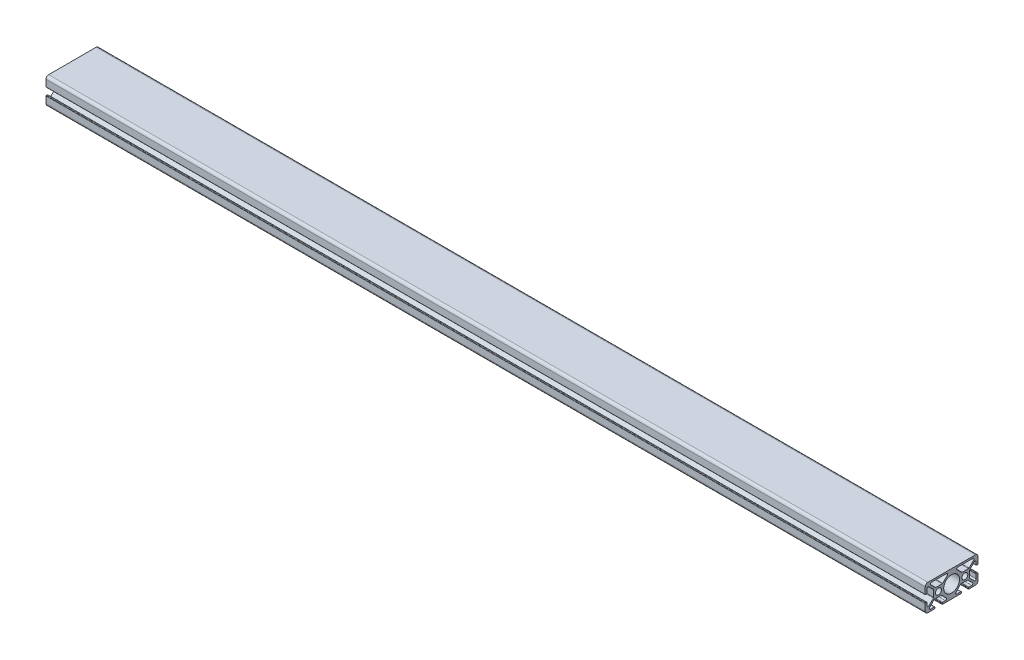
ISO-10303-21;
HEADER;
FILE_DESCRIPTION(('STEP AP214'),'2;1');
FILE_NAME('part.step','',(''),(''),'','','');
FILE_SCHEMA(('AUTOMOTIVE_DESIGN { 1 0 10303 214 1 1 1 1 }'));
ENDSEC;
DATA;
#1=APPLICATION_CONTEXT('core data for automotive mechanical design processes');
#2=APPLICATION_PROTOCOL_DEFINITION('international standard','automotive_design',2000,#1);
#3=PRODUCT_CONTEXT('',#1,'mechanical');
#4=PRODUCT('Part','Part','',(#3));
#5=PRODUCT_RELATED_PRODUCT_CATEGORY('part','',(#4));
#6=PRODUCT_DEFINITION_FORMATION('','',#4);
#7=PRODUCT_DEFINITION_CONTEXT('part definition',#1,'design');
#8=PRODUCT_DEFINITION('design','',#6,#7);
#9=PRODUCT_DEFINITION_SHAPE('','',#8);
#10=(LENGTH_UNIT() NAMED_UNIT(*) SI_UNIT(.MILLI.,.METRE.));
#11=(NAMED_UNIT(*) PLANE_ANGLE_UNIT() SI_UNIT($,.RADIAN.));
#12=(NAMED_UNIT(*) SI_UNIT($,.STERADIAN.) SOLID_ANGLE_UNIT());
#13=UNCERTAINTY_MEASURE_WITH_UNIT(LENGTH_MEASURE(1.E-05),#10,'distance_accuracy_value','');
#14=(GEOMETRIC_REPRESENTATION_CONTEXT(3) GLOBAL_UNCERTAINTY_ASSIGNED_CONTEXT((#13)) GLOBAL_UNIT_ASSIGNED_CONTEXT((#10,
#11,#12)) REPRESENTATION_CONTEXT('',''));
#15=CARTESIAN_POINT('',(0.,0.,0.));
#16=DIRECTION('',(0.,0.,1.));
#17=DIRECTION('',(1.,0.,0.));
#18=AXIS2_PLACEMENT_3D('',#15,#16,#17);
#19=CARTESIAN_POINT('',(1000.,4.5,29.5));
#20=DIRECTION('',(-1.,0.,0.));
#21=DIRECTION('',(0.,0.,1.));
#22=AXIS2_PLACEMENT_3D('',#19,#20,#21);
#23=CYLINDRICAL_SURFACE('',#22,0.5);
#24=CARTESIAN_POINT('',(0.,4.5,29.5));
#25=DIRECTION('',(1.,0.,0.));
#26=DIRECTION('',(0.,0.,-1.));
#27=AXIS2_PLACEMENT_3D('',#24,#25,#26);
#28=CIRCLE('',#27,0.5);
#29=CARTESIAN_POINT('',(0.,4.5,30.));
#30=VERTEX_POINT('',#29);
#31=CARTESIAN_POINT('',(0.,4.,29.5));
#32=VERTEX_POINT('',#31);
#33=EDGE_CURVE('E895',#30,#32,#28,.T.);
#34=ORIENTED_EDGE('',*,*,#33,.T.);
#35=DIRECTION('',(-1.,0.,0.));
#36=VECTOR('',#35,1.);
#37=CARTESIAN_POINT('',(1000.,4.,29.5));
#38=LINE('',#37,#36);
#39=CARTESIAN_POINT('',(1000.,4.,29.5));
#40=VERTEX_POINT('',#39);
#41=EDGE_CURVE('E13',#40,#32,#38,.T.);
#42=ORIENTED_EDGE('',*,*,#41,.F.);
#43=CARTESIAN_POINT('',(1000.,4.5,29.5));
#44=DIRECTION('',(1.,0.,0.));
#45=DIRECTION('',(0.,0.,-1.));
#46=AXIS2_PLACEMENT_3D('',#43,#44,#45);
#47=CIRCLE('',#46,0.5);
#48=CARTESIAN_POINT('',(1000.,4.5,30.));
#49=VERTEX_POINT('',#48);
#50=EDGE_CURVE('E1343',#49,#40,#47,.T.);
#51=ORIENTED_EDGE('',*,*,#50,.F.);
#52=DIRECTION('',(-1.,0.,0.));
#53=VECTOR('',#52,1.);
#54=CARTESIAN_POINT('',(1000.,4.5,30.));
#55=LINE('',#54,#53);
#56=EDGE_CURVE('E1038',#49,#30,#55,.T.);
#57=ORIENTED_EDGE('',*,*,#56,.T.);
#58=EDGE_LOOP('',(#34,#42,#51,#57));
#59=FACE_BOUND('',#58,.T.);
#60=ADVANCED_FACE('F258',(#59),#23,.T.);
#61=CARTESIAN_POINT('',(1000.,4.,29.5));
#62=DIRECTION('',(0.,1.,0.));
#63=DIRECTION('',(0.,0.,1.));
#64=AXIS2_PLACEMENT_3D('',#61,#62,#63);
#65=PLANE('',#64);
#66=DIRECTION('',(0.,0.,-1.));
#67=VECTOR('',#66,1.);
#68=CARTESIAN_POINT('',(0.,4.,29.5));
#69=LINE('',#68,#67);
#70=CARTESIAN_POINT('',(0.,4.,28.5));
#71=VERTEX_POINT('',#70);
#72=EDGE_CURVE('E898',#32,#71,#69,.T.);
#73=ORIENTED_EDGE('',*,*,#72,.T.);
#74=DIRECTION('',(-1.,0.,0.));
#75=VECTOR('',#74,1.);
#76=CARTESIAN_POINT('',(1000.,4.,28.5));
#77=LINE('',#76,#75);
#78=CARTESIAN_POINT('',(1000.,4.,28.5));
#79=VERTEX_POINT('',#78);
#80=EDGE_CURVE('E268',#79,#71,#77,.T.);
#81=ORIENTED_EDGE('',*,*,#80,.F.);
#82=DIRECTION('',(0.,0.,-1.));
#83=VECTOR('',#82,1.);
#84=CARTESIAN_POINT('',(1000.,4.,29.5));
#85=LINE('',#84,#83);
#86=EDGE_CURVE('E1345',#40,#79,#85,.T.);
#87=ORIENTED_EDGE('',*,*,#86,.F.);
#88=ORIENTED_EDGE('',*,*,#41,.T.);
#89=EDGE_LOOP('',(#73,#81,#87,#88));
#90=FACE_BOUND('',#89,.T.);
#91=ADVANCED_FACE('F1509',(#90),#65,.F.);
#92=CARTESIAN_POINT('',(1000.,4.5,28.5));
#93=DIRECTION('',(-1.,0.,0.));
#94=DIRECTION('',(0.,0.,1.));
#95=AXIS2_PLACEMENT_3D('',#92,#93,#94);
#96=CYLINDRICAL_SURFACE('',#95,0.5);
#97=CARTESIAN_POINT('',(0.,4.5,28.5));
#98=DIRECTION('',(1.,0.,0.));
#99=DIRECTION('',(0.,0.,-1.));
#100=AXIS2_PLACEMENT_3D('',#97,#98,#99);
#101=CIRCLE('',#100,0.5);
#102=CARTESIAN_POINT('',(0.,4.5,28.));
#103=VERTEX_POINT('',#102);
#104=EDGE_CURVE('E900',#71,#103,#101,.T.);
#105=ORIENTED_EDGE('',*,*,#104,.T.);
#106=DIRECTION('',(-1.,0.,0.));
#107=VECTOR('',#106,1.);
#108=CARTESIAN_POINT('',(1000.,4.5,28.));
#109=LINE('',#108,#107);
#110=CARTESIAN_POINT('',(1000.,4.5,28.));
#111=VERTEX_POINT('',#110);
#112=EDGE_CURVE('E1238',#111,#103,#109,.T.);
#113=ORIENTED_EDGE('',*,*,#112,.F.);
#114=CARTESIAN_POINT('',(1000.,4.5,28.5));
#115=DIRECTION('',(1.,0.,0.));
#116=DIRECTION('',(0.,0.,-1.));
#117=AXIS2_PLACEMENT_3D('',#114,#115,#116);
#118=CIRCLE('',#117,0.5);
#119=EDGE_CURVE('E1347',#79,#111,#118,.T.);
#120=ORIENTED_EDGE('',*,*,#119,.F.);
#121=ORIENTED_EDGE('',*,*,#80,.T.);
#122=EDGE_LOOP('',(#105,#113,#120,#121));
#123=FACE_BOUND('',#122,.T.);
#124=ADVANCED_FACE('F1514',(#123),#96,.T.);
#125=CARTESIAN_POINT('',(1000.,4.5,28.));
#126=DIRECTION('',(0.,0.,1.));
#127=DIRECTION('',(1.,0.,0.));
#128=AXIS2_PLACEMENT_3D('',#125,#126,#127);
#129=PLANE('',#128);
#130=DIRECTION('',(0.,1.,0.));
#131=VECTOR('',#130,1.);
#132=CARTESIAN_POINT('',(0.,4.5,28.));
#133=LINE('',#132,#131);
#134=CARTESIAN_POINT('',(0.,9.10225830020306,28.));
#135=VERTEX_POINT('',#134);
#136=EDGE_CURVE('E902',#103,#135,#133,.T.);
#137=ORIENTED_EDGE('',*,*,#136,.T.);
#138=DIRECTION('',(-1.,0.,0.));
#139=VECTOR('',#138,1.);
#140=CARTESIAN_POINT('',(1000.,9.10225830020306,28.));
#141=LINE('',#140,#139);
#142=CARTESIAN_POINT('',(1000.,9.10225830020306,28.));
#143=VERTEX_POINT('',#142);
#144=EDGE_CURVE('E1235',#143,#135,#141,.T.);
#145=ORIENTED_EDGE('',*,*,#144,.F.);
#146=DIRECTION('',(0.,1.,0.));
#147=VECTOR('',#146,1.);
#148=CARTESIAN_POINT('',(1000.,4.5,28.));
#149=LINE('',#148,#147);
#150=EDGE_CURVE('E1349',#111,#143,#149,.T.);
#151=ORIENTED_EDGE('',*,*,#150,.F.);
#152=ORIENTED_EDGE('',*,*,#112,.T.);
#153=EDGE_LOOP('',(#137,#145,#151,#152));
#154=FACE_BOUND('',#153,.T.);
#155=ADVANCED_FACE('F2137',(#154),#129,.F.);
#156=CARTESIAN_POINT('',(1000.,9.10225830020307,26.7022583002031));
#157=DIRECTION('',(-1.,0.,0.));
#158=DIRECTION('',(0.,0.,1.));
#159=AXIS2_PLACEMENT_3D('',#156,#157,#158);
#160=CYLINDRICAL_SURFACE('',#159,1.29774169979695);
#161=CARTESIAN_POINT('',(0.,9.10225830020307,26.7022583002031));
#162=DIRECTION('',(-1.,0.,0.));
#163=DIRECTION('',(0.,0.,-1.));
#164=AXIS2_PLACEMENT_3D('',#161,#162,#163);
#165=CIRCLE('',#164,1.29774169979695);
#166=CARTESIAN_POINT('',(0.,10.019900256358,25.7846163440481));
#167=VERTEX_POINT('',#166);
#168=EDGE_CURVE('E904',#135,#167,#165,.T.);
#169=ORIENTED_EDGE('',*,*,#168,.T.);
#170=DIRECTION('',(-1.,0.,0.));
#171=VECTOR('',#170,1.);
#172=CARTESIAN_POINT('',(1000.,10.019900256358,25.7846163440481));
#173=LINE('',#172,#171);
#174=CARTESIAN_POINT('',(1000.,10.019900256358,25.7846163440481));
#175=VERTEX_POINT('',#174);
#176=EDGE_CURVE('E1232',#175,#167,#173,.T.);
#177=ORIENTED_EDGE('',*,*,#176,.F.);
#178=CARTESIAN_POINT('',(1000.,9.10225830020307,26.7022583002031));
#179=DIRECTION('',(-1.,0.,0.));
#180=DIRECTION('',(0.,0.,-1.));
#181=AXIS2_PLACEMENT_3D('',#178,#179,#180);
#182=CIRCLE('',#181,1.29774169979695);
#183=EDGE_CURVE('E1351',#143,#175,#182,.T.);
#184=ORIENTED_EDGE('',*,*,#183,.F.);
#185=ORIENTED_EDGE('',*,*,#144,.T.);
#186=EDGE_LOOP('',(#169,#177,#184,#185));
#187=FACE_BOUND('',#186,.T.);
#188=ADVANCED_FACE('F2129',(#187),#160,.F.);
#189=CARTESIAN_POINT('',(1000.,10.019900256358,25.7846163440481));
#190=DIRECTION('',(0.,0.707106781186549,-0.707106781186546));
#191=DIRECTION('',(0.,0.707106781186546,0.707106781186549));
#192=AXIS2_PLACEMENT_3D('',#189,#190,#191);
#193=PLANE('',#192);
#194=DIRECTION('',(0.,-0.707106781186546,-0.707106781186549));
#195=VECTOR('',#194,1.);
#196=CARTESIAN_POINT('',(0.,10.019900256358,25.7846163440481));
#197=LINE('',#196,#195);
#198=CARTESIAN_POINT('',(0.,4.92817713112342,20.6928932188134));
#199=VERTEX_POINT('',#198);
#200=EDGE_CURVE('E906',#167,#199,#197,.T.);
#201=ORIENTED_EDGE('',*,*,#200,.T.);
#202=DIRECTION('',(-1.,0.,0.));
#203=VECTOR('',#202,1.);
#204=CARTESIAN_POINT('',(1000.,4.92817713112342,20.6928932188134));
#205=LINE('',#204,#203);
#206=CARTESIAN_POINT('',(1000.,4.92817713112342,20.6928932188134));
#207=VERTEX_POINT('',#206);
#208=EDGE_CURVE('E1229',#207,#199,#205,.T.);
#209=ORIENTED_EDGE('',*,*,#208,.F.);
#210=DIRECTION('',(0.,-0.707106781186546,-0.707106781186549));
#211=VECTOR('',#210,1.);
#212=CARTESIAN_POINT('',(1000.,10.019900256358,25.7846163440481));
#213=LINE('',#212,#211);
#214=EDGE_CURVE('E1353',#175,#207,#213,.T.);
#215=ORIENTED_EDGE('',*,*,#214,.F.);
#216=ORIENTED_EDGE('',*,*,#176,.T.);
#217=EDGE_LOOP('',(#201,#209,#215,#216));
#218=FACE_BOUND('',#217,.T.);
#219=ADVANCED_FACE('F2121',(#218),#193,.F.);
#220=CARTESIAN_POINT('',(1000.,4.22107034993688,21.4));
#221=DIRECTION('',(-1.,0.,0.));
#222=DIRECTION('',(0.,0.,1.));
#223=AXIS2_PLACEMENT_3D('',#220,#221,#222);
#224=CYLINDRICAL_SURFACE('',#223,0.999999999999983);
#225=CARTESIAN_POINT('',(0.,4.22107034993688,21.4));
#226=DIRECTION('',(-1.,0.,0.));
#227=DIRECTION('',(0.,0.,-1.));
#228=AXIS2_PLACEMENT_3D('',#225,#226,#227);
#229=CIRCLE('',#228,0.999999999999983);
#230=CARTESIAN_POINT('',(0.,4.22107034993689,20.4));
#231=VERTEX_POINT('',#230);
#232=EDGE_CURVE('E908',#199,#231,#229,.T.);
#233=ORIENTED_EDGE('',*,*,#232,.T.);
#234=DIRECTION('',(-1.,0.,0.));
#235=VECTOR('',#234,1.);
#236=CARTESIAN_POINT('',(1000.,4.22107034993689,20.4));
#237=LINE('',#236,#235);
#238=CARTESIAN_POINT('',(1000.,4.22107034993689,20.4));
#239=VERTEX_POINT('',#238);
#240=EDGE_CURVE('E1226',#239,#231,#237,.T.);
#241=ORIENTED_EDGE('',*,*,#240,.F.);
#242=CARTESIAN_POINT('',(1000.,4.22107034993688,21.4));
#243=DIRECTION('',(-1.,0.,0.));
#244=DIRECTION('',(0.,0.,-1.));
#245=AXIS2_PLACEMENT_3D('',#242,#243,#244);
#246=CIRCLE('',#245,0.999999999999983);
#247=EDGE_CURVE('E1355',#207,#239,#246,.T.);
#248=ORIENTED_EDGE('',*,*,#247,.F.);
#249=ORIENTED_EDGE('',*,*,#208,.T.);
#250=EDGE_LOOP('',(#233,#241,#248,#249));
#251=FACE_BOUND('',#250,.T.);
#252=ADVANCED_FACE('F2113',(#251),#224,.F.);
#253=CARTESIAN_POINT('',(1000.,4.22107034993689,20.4));
#254=DIRECTION('',(0.,0.,-1.));
#255=DIRECTION('',(-1.,0.,0.));
#256=AXIS2_PLACEMENT_3D('',#253,#254,#255);
#257=PLANE('',#256);
#258=DIRECTION('',(0.,-1.,0.));
#259=VECTOR('',#258,1.);
#260=CARTESIAN_POINT('',(0.,4.22107034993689,20.4));
#261=LINE('',#260,#259);
#262=CARTESIAN_POINT('',(0.,-3.02107034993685,20.4));
#263=VERTEX_POINT('',#262);
#264=EDGE_CURVE('E910',#231,#263,#261,.T.);
#265=ORIENTED_EDGE('',*,*,#264,.T.);
#266=DIRECTION('',(-1.,0.,0.));
#267=VECTOR('',#266,1.);
#268=CARTESIAN_POINT('',(1000.,-3.02107034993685,20.4));
#269=LINE('',#268,#267);
#270=CARTESIAN_POINT('',(1000.,-3.02107034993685,20.4));
#271=VERTEX_POINT('',#270);
#272=EDGE_CURVE('E1223',#271,#263,#269,.T.);
#273=ORIENTED_EDGE('',*,*,#272,.F.);
#274=DIRECTION('',(0.,-1.,0.));
#275=VECTOR('',#274,1.);
#276=CARTESIAN_POINT('',(1000.,4.22107034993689,20.4));
#277=LINE('',#276,#275);
#278=EDGE_CURVE('E1357',#239,#271,#277,.T.);
#279=ORIENTED_EDGE('',*,*,#278,.F.);
#280=ORIENTED_EDGE('',*,*,#240,.T.);
#281=EDGE_LOOP('',(#265,#273,#279,#280));
#282=FACE_BOUND('',#281,.T.);
#283=ADVANCED_FACE('F2105',(#282),#257,.F.);
#284=CARTESIAN_POINT('',(1000.,-3.02107034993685,21.4));
#285=DIRECTION('',(-1.,0.,0.));
#286=DIRECTION('',(0.,0.,1.));
#287=AXIS2_PLACEMENT_3D('',#284,#285,#286);
#288=CYLINDRICAL_SURFACE('',#287,1.00000000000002);
#289=CARTESIAN_POINT('',(0.,-3.02107034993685,21.4));
#290=DIRECTION('',(-1.,0.,0.));
#291=DIRECTION('',(0.,0.,-1.));
#292=AXIS2_PLACEMENT_3D('',#289,#290,#291);
#293=CIRCLE('',#292,1.00000000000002);
#294=CARTESIAN_POINT('',(0.,-3.7281771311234,20.6928932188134));
#295=VERTEX_POINT('',#294);
#296=EDGE_CURVE('E912',#263,#295,#293,.T.);
#297=ORIENTED_EDGE('',*,*,#296,.T.);
#298=DIRECTION('',(-1.,0.,0.));
#299=VECTOR('',#298,1.);
#300=CARTESIAN_POINT('',(1000.,-3.7281771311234,20.6928932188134));
#301=LINE('',#300,#299);
#302=CARTESIAN_POINT('',(1000.,-3.7281771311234,20.6928932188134));
#303=VERTEX_POINT('',#302);
#304=EDGE_CURVE('E1220',#303,#295,#301,.T.);
#305=ORIENTED_EDGE('',*,*,#304,.F.);
#306=CARTESIAN_POINT('',(1000.,-3.02107034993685,21.4));
#307=DIRECTION('',(-1.,0.,0.));
#308=DIRECTION('',(0.,0.,-1.));
#309=AXIS2_PLACEMENT_3D('',#306,#307,#308);
#310=CIRCLE('',#309,1.00000000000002);
#311=EDGE_CURVE('E1359',#271,#303,#310,.T.);
#312=ORIENTED_EDGE('',*,*,#311,.F.);
#313=ORIENTED_EDGE('',*,*,#272,.T.);
#314=EDGE_LOOP('',(#297,#305,#312,#313));
#315=FACE_BOUND('',#314,.T.);
#316=ADVANCED_FACE('F2097',(#315),#288,.F.);
#317=CARTESIAN_POINT('',(1000.,-3.7281771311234,20.6928932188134));
#318=DIRECTION('',(0.,-0.707106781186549,-0.707106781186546));
#319=DIRECTION('',(0.,0.707106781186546,-0.707106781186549));
#320=AXIS2_PLACEMENT_3D('',#317,#318,#319);
#321=PLANE('',#320);
#322=DIRECTION('',(0.,-0.707106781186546,0.707106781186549));
#323=VECTOR('',#322,1.);
#324=CARTESIAN_POINT('',(0.,-3.7281771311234,20.6928932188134));
#325=LINE('',#324,#323);
#326=CARTESIAN_POINT('',(0.,-8.81990025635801,25.7846163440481));
#327=VERTEX_POINT('',#326);
#328=EDGE_CURVE('E914',#295,#327,#325,.T.);
#329=ORIENTED_EDGE('',*,*,#328,.T.);
#330=DIRECTION('',(-1.,0.,0.));
#331=VECTOR('',#330,1.);
#332=CARTESIAN_POINT('',(1000.,-8.81990025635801,25.7846163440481));
#333=LINE('',#332,#331);
#334=CARTESIAN_POINT('',(1000.,-8.81990025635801,25.7846163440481));
#335=VERTEX_POINT('',#334);
#336=EDGE_CURVE('E1217',#335,#327,#333,.T.);
#337=ORIENTED_EDGE('',*,*,#336,.F.);
#338=DIRECTION('',(0.,-0.707106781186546,0.707106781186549));
#339=VECTOR('',#338,1.);
#340=CARTESIAN_POINT('',(1000.,-3.7281771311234,20.6928932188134));
#341=LINE('',#340,#339);
#342=EDGE_CURVE('E1361',#303,#335,#341,.T.);
#343=ORIENTED_EDGE('',*,*,#342,.F.);
#344=ORIENTED_EDGE('',*,*,#304,.T.);
#345=EDGE_LOOP('',(#329,#337,#343,#344));
#346=FACE_BOUND('',#345,.T.);
#347=ADVANCED_FACE('F2089',(#346),#321,.F.);
#348=CARTESIAN_POINT('',(1000.,-7.90225830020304,26.702258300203));
#349=DIRECTION('',(-1.,0.,0.));
#350=DIRECTION('',(0.,0.,1.));
#351=AXIS2_PLACEMENT_3D('',#348,#349,#350);
#352=CYLINDRICAL_SURFACE('',#351,1.29774169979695);
#353=CARTESIAN_POINT('',(0.,-7.90225830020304,26.702258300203));
#354=DIRECTION('',(-1.,0.,0.));
#355=DIRECTION('',(0.,0.,-1.));
#356=AXIS2_PLACEMENT_3D('',#353,#354,#355);
#357=CIRCLE('',#356,1.29774169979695);
#358=CARTESIAN_POINT('',(0.,-7.90225830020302,28.));
#359=VERTEX_POINT('',#358);
#360=EDGE_CURVE('E916',#327,#359,#357,.T.);
#361=ORIENTED_EDGE('',*,*,#360,.T.);
#362=DIRECTION('',(-1.,0.,0.));
#363=VECTOR('',#362,1.);
#364=CARTESIAN_POINT('',(1000.,-7.90225830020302,28.));
#365=LINE('',#364,#363);
#366=CARTESIAN_POINT('',(1000.,-7.90225830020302,28.));
#367=VERTEX_POINT('',#366);
#368=EDGE_CURVE('E1214',#367,#359,#365,.T.);
#369=ORIENTED_EDGE('',*,*,#368,.F.);
#370=CARTESIAN_POINT('',(1000.,-7.90225830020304,26.702258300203));
#371=DIRECTION('',(-1.,0.,0.));
#372=DIRECTION('',(0.,0.,-1.));
#373=AXIS2_PLACEMENT_3D('',#370,#371,#372);
#374=CIRCLE('',#373,1.29774169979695);
#375=EDGE_CURVE('E1363',#335,#367,#374,.T.);
#376=ORIENTED_EDGE('',*,*,#375,.F.);
#377=ORIENTED_EDGE('',*,*,#336,.T.);
#378=EDGE_LOOP('',(#361,#369,#376,#377));
#379=FACE_BOUND('',#378,.T.);
#380=ADVANCED_FACE('F2081',(#379),#352,.F.);
#381=CARTESIAN_POINT('',(1000.,-7.90225830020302,28.));
#382=DIRECTION('',(0.,0.,1.));
#383=DIRECTION('',(1.,0.,0.));
#384=AXIS2_PLACEMENT_3D('',#381,#382,#383);
#385=PLANE('',#384);
#386=DIRECTION('',(0.,1.,0.));
#387=VECTOR('',#386,1.);
#388=CARTESIAN_POINT('',(0.,-7.90225830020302,28.));
#389=LINE('',#388,#387);
#390=CARTESIAN_POINT('',(0.,-4.5,28.));
#391=VERTEX_POINT('',#390);
#392=EDGE_CURVE('E918',#359,#391,#389,.T.);
#393=ORIENTED_EDGE('',*,*,#392,.T.);
#394=DIRECTION('',(-1.,0.,0.));
#395=VECTOR('',#394,1.);
#396=CARTESIAN_POINT('',(1000.,-4.5,28.));
#397=LINE('',#396,#395);
#398=CARTESIAN_POINT('',(1000.,-4.5,28.));
#399=VERTEX_POINT('',#398);
#400=EDGE_CURVE('E1211',#399,#391,#397,.T.);
#401=ORIENTED_EDGE('',*,*,#400,.F.);
#402=DIRECTION('',(0.,1.,0.));
#403=VECTOR('',#402,1.);
#404=CARTESIAN_POINT('',(1000.,-7.90225830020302,28.));
#405=LINE('',#404,#403);
#406=EDGE_CURVE('E1365',#367,#399,#405,.T.);
#407=ORIENTED_EDGE('',*,*,#406,.F.);
#408=ORIENTED_EDGE('',*,*,#368,.T.);
#409=EDGE_LOOP('',(#393,#401,#407,#408));
#410=FACE_BOUND('',#409,.T.);
#411=ADVANCED_FACE('F2073',(#410),#385,.F.);
#412=CARTESIAN_POINT('',(1000.,-4.5,28.5));
#413=DIRECTION('',(-1.,0.,0.));
#414=DIRECTION('',(0.,0.,1.));
#415=AXIS2_PLACEMENT_3D('',#412,#413,#414);
#416=CYLINDRICAL_SURFACE('',#415,0.5);
#417=CARTESIAN_POINT('',(0.,-4.5,28.5));
#418=DIRECTION('',(1.,0.,0.));
#419=DIRECTION('',(0.,0.,-1.));
#420=AXIS2_PLACEMENT_3D('',#417,#418,#419);
#421=CIRCLE('',#420,0.5);
#422=CARTESIAN_POINT('',(0.,-4.,28.5));
#423=VERTEX_POINT('',#422);
#424=EDGE_CURVE('E920',#391,#423,#421,.T.);
#425=ORIENTED_EDGE('',*,*,#424,.T.);
#426=DIRECTION('',(-1.,0.,0.));
#427=VECTOR('',#426,1.);
#428=CARTESIAN_POINT('',(1000.,-4.,28.5));
#429=LINE('',#428,#427);
#430=CARTESIAN_POINT('',(1000.,-4.,28.5));
#431=VERTEX_POINT('',#430);
#432=EDGE_CURVE('E1208',#431,#423,#429,.T.);
#433=ORIENTED_EDGE('',*,*,#432,.F.);
#434=CARTESIAN_POINT('',(1000.,-4.5,28.5));
#435=DIRECTION('',(1.,0.,0.));
#436=DIRECTION('',(0.,0.,-1.));
#437=AXIS2_PLACEMENT_3D('',#434,#435,#436);
#438=CIRCLE('',#437,0.5);
#439=EDGE_CURVE('E1367',#399,#431,#438,.T.);
#440=ORIENTED_EDGE('',*,*,#439,.F.);
#441=ORIENTED_EDGE('',*,*,#400,.T.);
#442=EDGE_LOOP('',(#425,#433,#440,#441));
#443=FACE_BOUND('',#442,.T.);
#444=ADVANCED_FACE('F2065',(#443),#416,.T.);
#445=CARTESIAN_POINT('',(1000.,-4.,28.5));
#446=DIRECTION('',(0.,-1.,0.));
#447=DIRECTION('',(0.,0.,-1.));
#448=AXIS2_PLACEMENT_3D('',#445,#446,#447);
#449=PLANE('',#448);
#450=DIRECTION('',(0.,0.,1.));
#451=VECTOR('',#450,1.);
#452=CARTESIAN_POINT('',(0.,-4.,28.5));
#453=LINE('',#452,#451);
#454=CARTESIAN_POINT('',(0.,-4.,29.5));
#455=VERTEX_POINT('',#454);
#456=EDGE_CURVE('E922',#423,#455,#453,.T.);
#457=ORIENTED_EDGE('',*,*,#456,.T.);
#458=DIRECTION('',(-1.,0.,0.));
#459=VECTOR('',#458,1.);
#460=CARTESIAN_POINT('',(1000.,-4.,29.5));
#461=LINE('',#460,#459);
#462=CARTESIAN_POINT('',(1000.,-4.,29.5));
#463=VERTEX_POINT('',#462);
#464=EDGE_CURVE('E1205',#463,#455,#461,.T.);
#465=ORIENTED_EDGE('',*,*,#464,.F.);
#466=DIRECTION('',(0.,0.,1.));
#467=VECTOR('',#466,1.);
#468=CARTESIAN_POINT('',(1000.,-4.,28.5));
#469=LINE('',#468,#467);
#470=EDGE_CURVE('E1369',#431,#463,#469,.T.);
#471=ORIENTED_EDGE('',*,*,#470,.F.);
#472=ORIENTED_EDGE('',*,*,#432,.T.);
#473=EDGE_LOOP('',(#457,#465,#471,#472));
#474=FACE_BOUND('',#473,.T.);
#475=ADVANCED_FACE('F2057',(#474),#449,.F.);
#476=CARTESIAN_POINT('',(1000.,-4.5,29.5));
#477=DIRECTION('',(-1.,0.,0.));
#478=DIRECTION('',(0.,0.,1.));
#479=AXIS2_PLACEMENT_3D('',#476,#477,#478);
#480=CYLINDRICAL_SURFACE('',#479,0.5);
#481=CARTESIAN_POINT('',(0.,-4.5,29.5));
#482=DIRECTION('',(1.,0.,0.));
#483=DIRECTION('',(0.,0.,-1.));
#484=AXIS2_PLACEMENT_3D('',#481,#482,#483);
#485=CIRCLE('',#484,0.5);
#486=CARTESIAN_POINT('',(0.,-4.5,30.));
#487=VERTEX_POINT('',#486);
#488=EDGE_CURVE('E924',#455,#487,#485,.T.);
#489=ORIENTED_EDGE('',*,*,#488,.T.);
#490=DIRECTION('',(-1.,0.,0.));
#491=VECTOR('',#490,1.);
#492=CARTESIAN_POINT('',(1000.,-4.5,30.));
#493=LINE('',#492,#491);
#494=CARTESIAN_POINT('',(1000.,-4.5,30.));
#495=VERTEX_POINT('',#494);
#496=EDGE_CURVE('E1202',#495,#487,#493,.T.);
#497=ORIENTED_EDGE('',*,*,#496,.F.);
#498=CARTESIAN_POINT('',(1000.,-4.5,29.5));
#499=DIRECTION('',(1.,0.,0.));
#500=DIRECTION('',(0.,0.,-1.));
#501=AXIS2_PLACEMENT_3D('',#498,#499,#500);
#502=CIRCLE('',#501,0.5);
#503=EDGE_CURVE('E1371',#463,#495,#502,.T.);
#504=ORIENTED_EDGE('',*,*,#503,.F.);
#505=ORIENTED_EDGE('',*,*,#464,.T.);
#506=EDGE_LOOP('',(#489,#497,#504,#505));
#507=FACE_BOUND('',#506,.T.);
#508=ADVANCED_FACE('F2049',(#507),#480,.T.);
#509=CARTESIAN_POINT('',(1000.,-4.5,30.));
#510=DIRECTION('',(0.,0.,-1.));
#511=DIRECTION('',(-1.,0.,0.));
#512=AXIS2_PLACEMENT_3D('',#509,#510,#511);
#513=PLANE('',#512);
#514=DIRECTION('',(0.,-1.,0.));
#515=VECTOR('',#514,1.);
#516=CARTESIAN_POINT('',(0.,-4.5,30.));
#517=LINE('',#516,#515);
#518=CARTESIAN_POINT('',(0.,-12.,30.));
#519=VERTEX_POINT('',#518);
#520=EDGE_CURVE('E926',#487,#519,#517,.T.);
#521=ORIENTED_EDGE('',*,*,#520,.T.);
#522=DIRECTION('',(-1.,0.,0.));
#523=VECTOR('',#522,1.);
#524=CARTESIAN_POINT('',(1000.,-12.,30.));
#525=LINE('',#524,#523);
#526=CARTESIAN_POINT('',(1000.,-12.,30.));
#527=VERTEX_POINT('',#526);
#528=EDGE_CURVE('E1199',#527,#519,#525,.T.);
#529=ORIENTED_EDGE('',*,*,#528,.F.);
#530=DIRECTION('',(0.,-1.,0.));
#531=VECTOR('',#530,1.);
#532=CARTESIAN_POINT('',(1000.,-4.5,30.));
#533=LINE('',#532,#531);
#534=EDGE_CURVE('E1373',#495,#527,#533,.T.);
#535=ORIENTED_EDGE('',*,*,#534,.F.);
#536=ORIENTED_EDGE('',*,*,#496,.T.);
#537=EDGE_LOOP('',(#521,#529,#535,#536));
#538=FACE_BOUND('',#537,.T.);
#539=ADVANCED_FACE('F2041',(#538),#513,.F.);
#540=CARTESIAN_POINT('',(1000.,-12.,27.));
#541=DIRECTION('',(-1.,0.,0.));
#542=DIRECTION('',(0.,0.,1.));
#543=AXIS2_PLACEMENT_3D('',#540,#541,#542);
#544=CYLINDRICAL_SURFACE('',#543,3.);
#545=CARTESIAN_POINT('',(0.,-12.,27.));
#546=DIRECTION('',(1.,0.,0.));
#547=DIRECTION('',(0.,0.,-1.));
#548=AXIS2_PLACEMENT_3D('',#545,#546,#547);
#549=CIRCLE('',#548,3.);
#550=CARTESIAN_POINT('',(0.,-15.,27.));
#551=VERTEX_POINT('',#550);
#552=EDGE_CURVE('E928',#519,#551,#549,.T.);
#553=ORIENTED_EDGE('',*,*,#552,.T.);
#554=DIRECTION('',(-1.,0.,0.));
#555=VECTOR('',#554,1.);
#556=CARTESIAN_POINT('',(1000.,-15.,27.));
#557=LINE('',#556,#555);
#558=CARTESIAN_POINT('',(1000.,-15.,27.));
#559=VERTEX_POINT('',#558);
#560=EDGE_CURVE('E1196',#559,#551,#557,.T.);
#561=ORIENTED_EDGE('',*,*,#560,.F.);
#562=CARTESIAN_POINT('',(1000.,-12.,27.));
#563=DIRECTION('',(1.,0.,0.));
#564=DIRECTION('',(0.,0.,-1.));
#565=AXIS2_PLACEMENT_3D('',#562,#563,#564);
#566=CIRCLE('',#565,3.);
#567=EDGE_CURVE('E1375',#527,#559,#566,.T.);
#568=ORIENTED_EDGE('',*,*,#567,.F.);
#569=ORIENTED_EDGE('',*,*,#528,.T.);
#570=EDGE_LOOP('',(#553,#561,#568,#569));
#571=FACE_BOUND('',#570,.T.);
#572=ADVANCED_FACE('F2033',(#571),#544,.T.);
#573=CARTESIAN_POINT('',(1000.,-15.,27.));
#574=DIRECTION('',(0.,1.,0.));
#575=DIRECTION('',(0.,0.,1.));
#576=AXIS2_PLACEMENT_3D('',#573,#574,#575);
#577=PLANE('',#576);
#578=DIRECTION('',(0.,0.,-1.));
#579=VECTOR('',#578,1.);
#580=CARTESIAN_POINT('',(0.,-15.,27.));
#581=LINE('',#580,#579);
#582=CARTESIAN_POINT('',(0.,-15.,19.5));
#583=VERTEX_POINT('',#582);
#584=EDGE_CURVE('E930',#551,#583,#581,.T.);
#585=ORIENTED_EDGE('',*,*,#584,.T.);
#586=DIRECTION('',(-1.,0.,0.));
#587=VECTOR('',#586,1.);
#588=CARTESIAN_POINT('',(1000.,-15.,19.5));
#589=LINE('',#588,#587);
#590=CARTESIAN_POINT('',(1000.,-15.,19.5));
#591=VERTEX_POINT('',#590);
#592=EDGE_CURVE('E1193',#591,#583,#589,.T.);
#593=ORIENTED_EDGE('',*,*,#592,.F.);
#594=DIRECTION('',(0.,0.,-1.));
#595=VECTOR('',#594,1.);
#596=CARTESIAN_POINT('',(1000.,-15.,27.));
#597=LINE('',#596,#595);
#598=EDGE_CURVE('E1377',#559,#591,#597,.T.);
#599=ORIENTED_EDGE('',*,*,#598,.F.);
#600=ORIENTED_EDGE('',*,*,#560,.T.);
#601=EDGE_LOOP('',(#585,#593,#599,#600));
#602=FACE_BOUND('',#601,.T.);
#603=ADVANCED_FACE('F2025',(#602),#577,.F.);
#604=CARTESIAN_POINT('',(1000.,-14.5,19.5));
#605=DIRECTION('',(-1.,0.,0.));
#606=DIRECTION('',(0.,0.,1.));
#607=AXIS2_PLACEMENT_3D('',#604,#605,#606);
#608=CYLINDRICAL_SURFACE('',#607,0.5);
#609=CARTESIAN_POINT('',(0.,-14.5,19.5));
#610=DIRECTION('',(1.,0.,0.));
#611=DIRECTION('',(0.,0.,-1.));
#612=AXIS2_PLACEMENT_3D('',#609,#610,#611);
#613=CIRCLE('',#612,0.5);
#614=CARTESIAN_POINT('',(0.,-14.5,19.));
#615=VERTEX_POINT('',#614);
#616=EDGE_CURVE('E932',#583,#615,#613,.T.);
#617=ORIENTED_EDGE('',*,*,#616,.T.);
#618=DIRECTION('',(-1.,0.,0.));
#619=VECTOR('',#618,1.);
#620=CARTESIAN_POINT('',(1000.,-14.5,19.));
#621=LINE('',#620,#619);
#622=CARTESIAN_POINT('',(1000.,-14.5,19.));
#623=VERTEX_POINT('',#622);
#624=EDGE_CURVE('E1190',#623,#615,#621,.T.);
#625=ORIENTED_EDGE('',*,*,#624,.F.);
#626=CARTESIAN_POINT('',(1000.,-14.5,19.5));
#627=DIRECTION('',(1.,0.,0.));
#628=DIRECTION('',(0.,0.,-1.));
#629=AXIS2_PLACEMENT_3D('',#626,#627,#628);
#630=CIRCLE('',#629,0.5);
#631=EDGE_CURVE('E1379',#591,#623,#630,.T.);
#632=ORIENTED_EDGE('',*,*,#631,.F.);
#633=ORIENTED_EDGE('',*,*,#592,.T.);
#634=EDGE_LOOP('',(#617,#625,#632,#633));
#635=FACE_BOUND('',#634,.T.);
#636=ADVANCED_FACE('F2017',(#635),#608,.T.);
#637=CARTESIAN_POINT('',(1000.,-14.5,19.));
#638=DIRECTION('',(0.,0.,1.));
#639=DIRECTION('',(1.,0.,0.));
#640=AXIS2_PLACEMENT_3D('',#637,#638,#639);
#641=PLANE('',#640);
#642=DIRECTION('',(0.,1.,0.));
#643=VECTOR('',#642,1.);
#644=CARTESIAN_POINT('',(0.,-14.5,19.));
#645=LINE('',#644,#643);
#646=CARTESIAN_POINT('',(0.,-13.5,19.));
#647=VERTEX_POINT('',#646);
#648=EDGE_CURVE('E934',#615,#647,#645,.T.);
#649=ORIENTED_EDGE('',*,*,#648,.T.);
#650=DIRECTION('',(-1.,0.,0.));
#651=VECTOR('',#650,1.);
#652=CARTESIAN_POINT('',(1000.,-13.5,19.));
#653=LINE('',#652,#651);
#654=CARTESIAN_POINT('',(1000.,-13.5,19.));
#655=VERTEX_POINT('',#654);
#656=EDGE_CURVE('E1187',#655,#647,#653,.T.);
#657=ORIENTED_EDGE('',*,*,#656,.F.);
#658=DIRECTION('',(0.,1.,0.));
#659=VECTOR('',#658,1.);
#660=CARTESIAN_POINT('',(1000.,-14.5,19.));
#661=LINE('',#660,#659);
#662=EDGE_CURVE('E1381',#623,#655,#661,.T.);
#663=ORIENTED_EDGE('',*,*,#662,.F.);
#664=ORIENTED_EDGE('',*,*,#624,.T.);
#665=EDGE_LOOP('',(#649,#657,#663,#664));
#666=FACE_BOUND('',#665,.T.);
#667=ADVANCED_FACE('F2009',(#666),#641,.F.);
#668=CARTESIAN_POINT('',(1000.,-13.5,19.5));
#669=DIRECTION('',(-1.,0.,0.));
#670=DIRECTION('',(0.,0.,1.));
#671=AXIS2_PLACEMENT_3D('',#668,#669,#670);
#672=CYLINDRICAL_SURFACE('',#671,0.5);
#673=CARTESIAN_POINT('',(0.,-13.5,19.5));
#674=DIRECTION('',(1.,0.,0.));
#675=DIRECTION('',(0.,0.,-1.));
#676=AXIS2_PLACEMENT_3D('',#673,#674,#675);
#677=CIRCLE('',#676,0.5);
#678=CARTESIAN_POINT('',(0.,-13.,19.5));
#679=VERTEX_POINT('',#678);
#680=EDGE_CURVE('E936',#647,#679,#677,.T.);
#681=ORIENTED_EDGE('',*,*,#680,.T.);
#682=DIRECTION('',(-1.,0.,0.));
#683=VECTOR('',#682,1.);
#684=CARTESIAN_POINT('',(1000.,-13.,19.5));
#685=LINE('',#684,#683);
#686=CARTESIAN_POINT('',(1000.,-13.,19.5));
#687=VERTEX_POINT('',#686);
#688=EDGE_CURVE('E1184',#687,#679,#685,.T.);
#689=ORIENTED_EDGE('',*,*,#688,.F.);
#690=CARTESIAN_POINT('',(1000.,-13.5,19.5));
#691=DIRECTION('',(1.,0.,0.));
#692=DIRECTION('',(0.,0.,-1.));
#693=AXIS2_PLACEMENT_3D('',#690,#691,#692);
#694=CIRCLE('',#693,0.5);
#695=EDGE_CURVE('E1383',#655,#687,#694,.T.);
#696=ORIENTED_EDGE('',*,*,#695,.F.);
#697=ORIENTED_EDGE('',*,*,#656,.T.);
#698=EDGE_LOOP('',(#681,#689,#696,#697));
#699=FACE_BOUND('',#698,.T.);
#700=ADVANCED_FACE('F2001',(#699),#672,.T.);
#701=CARTESIAN_POINT('',(1000.,-13.,19.5));
#702=DIRECTION('',(0.,-1.,0.));
#703=DIRECTION('',(0.,0.,-1.));
#704=AXIS2_PLACEMENT_3D('',#701,#702,#703);
#705=PLANE('',#704);
#706=DIRECTION('',(0.,0.,1.));
#707=VECTOR('',#706,1.);
#708=CARTESIAN_POINT('',(0.,-13.,19.5));
#709=LINE('',#708,#707);
#710=CARTESIAN_POINT('',(0.,-13.,24.1022583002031));
#711=VERTEX_POINT('',#710);
#712=EDGE_CURVE('E938',#679,#711,#709,.T.);
#713=ORIENTED_EDGE('',*,*,#712,.T.);
#714=DIRECTION('',(-1.,0.,0.));
#715=VECTOR('',#714,1.);
#716=CARTESIAN_POINT('',(1000.,-13.,24.1022583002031));
#717=LINE('',#716,#715);
#718=CARTESIAN_POINT('',(1000.,-13.,24.1022583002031));
#719=VERTEX_POINT('',#718);
#720=EDGE_CURVE('E1181',#719,#711,#717,.T.);
#721=ORIENTED_EDGE('',*,*,#720,.F.);
#722=DIRECTION('',(0.,0.,1.));
#723=VECTOR('',#722,1.);
#724=CARTESIAN_POINT('',(1000.,-13.,19.5));
#725=LINE('',#724,#723);
#726=EDGE_CURVE('E1385',#687,#719,#725,.T.);
#727=ORIENTED_EDGE('',*,*,#726,.F.);
#728=ORIENTED_EDGE('',*,*,#688,.T.);
#729=EDGE_LOOP('',(#713,#721,#727,#728));
#730=FACE_BOUND('',#729,.T.);
#731=ADVANCED_FACE('F1993',(#730),#705,.F.);
#732=CARTESIAN_POINT('',(1000.,-11.702258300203,24.1022583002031));
#733=DIRECTION('',(-1.,0.,0.));
#734=DIRECTION('',(0.,0.,1.));
#735=AXIS2_PLACEMENT_3D('',#732,#733,#734);
#736=CYLINDRICAL_SURFACE('',#735,1.29774169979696);
#737=CARTESIAN_POINT('',(0.,-11.702258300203,24.1022583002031));
#738=DIRECTION('',(-1.,0.,0.));
#739=DIRECTION('',(0.,0.,-1.));
#740=AXIS2_PLACEMENT_3D('',#737,#738,#739);
#741=CIRCLE('',#740,1.29774169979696);
#742=CARTESIAN_POINT('',(0.,-10.784616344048,25.019900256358));
#743=VERTEX_POINT('',#742);
#744=EDGE_CURVE('E940',#711,#743,#741,.T.);
#745=ORIENTED_EDGE('',*,*,#744,.T.);
#746=DIRECTION('',(-1.,0.,0.));
#747=VECTOR('',#746,1.);
#748=CARTESIAN_POINT('',(1000.,-10.784616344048,25.019900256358));
#749=LINE('',#748,#747);
#750=CARTESIAN_POINT('',(1000.,-10.784616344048,25.019900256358));
#751=VERTEX_POINT('',#750);
#752=EDGE_CURVE('E1178',#751,#743,#749,.T.);
#753=ORIENTED_EDGE('',*,*,#752,.F.);
#754=CARTESIAN_POINT('',(1000.,-11.702258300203,24.1022583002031));
#755=DIRECTION('',(-1.,0.,0.));
#756=DIRECTION('',(0.,0.,-1.));
#757=AXIS2_PLACEMENT_3D('',#754,#755,#756);
#758=CIRCLE('',#757,1.29774169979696);
#759=EDGE_CURVE('E1387',#719,#751,#758,.T.);
#760=ORIENTED_EDGE('',*,*,#759,.F.);
#761=ORIENTED_EDGE('',*,*,#720,.T.);
#762=EDGE_LOOP('',(#745,#753,#760,#761));
#763=FACE_BOUND('',#762,.T.);
#764=ADVANCED_FACE('F1985',(#763),#736,.F.);
#765=CARTESIAN_POINT('',(1000.,-10.784616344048,25.019900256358));
#766=DIRECTION('',(0.,0.707106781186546,0.707106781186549));
#767=DIRECTION('',(0.,-0.707106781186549,0.707106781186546));
#768=AXIS2_PLACEMENT_3D('',#765,#766,#767);
#769=PLANE('',#768);
#770=DIRECTION('',(0.,0.707106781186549,-0.707106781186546));
#771=VECTOR('',#770,1.);
#772=CARTESIAN_POINT('',(0.,-10.784616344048,25.019900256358));
#773=LINE('',#772,#771);
#774=CARTESIAN_POINT('',(0.,-5.69289321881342,19.9281771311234));
#775=VERTEX_POINT('',#774);
#776=EDGE_CURVE('E942',#743,#775,#773,.T.);
#777=ORIENTED_EDGE('',*,*,#776,.T.);
#778=DIRECTION('',(-1.,0.,0.));
#779=VECTOR('',#778,1.);
#780=CARTESIAN_POINT('',(1000.,-5.69289321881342,19.9281771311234));
#781=LINE('',#780,#779);
#782=CARTESIAN_POINT('',(1000.,-5.69289321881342,19.9281771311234));
#783=VERTEX_POINT('',#782);
#784=EDGE_CURVE('E1175',#783,#775,#781,.T.);
#785=ORIENTED_EDGE('',*,*,#784,.F.);
#786=DIRECTION('',(0.,0.707106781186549,-0.707106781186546));
#787=VECTOR('',#786,1.);
#788=CARTESIAN_POINT('',(1000.,-10.784616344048,25.019900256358));
#789=LINE('',#788,#787);
#790=EDGE_CURVE('E1389',#751,#783,#789,.T.);
#791=ORIENTED_EDGE('',*,*,#790,.F.);
#792=ORIENTED_EDGE('',*,*,#752,.T.);
#793=EDGE_LOOP('',(#777,#785,#791,#792));
#794=FACE_BOUND('',#793,.T.);
#795=ADVANCED_FACE('F1977',(#794),#769,.F.);
#796=CARTESIAN_POINT('',(1000.,-6.39999999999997,19.2210703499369));
#797=DIRECTION('',(-1.,0.,0.));
#798=DIRECTION('',(0.,0.,1.));
#799=AXIS2_PLACEMENT_3D('',#796,#797,#798);
#800=CYLINDRICAL_SURFACE('',#799,0.999999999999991);
#801=CARTESIAN_POINT('',(0.,-6.39999999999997,19.2210703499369));
#802=DIRECTION('',(-1.,0.,0.));
#803=DIRECTION('',(0.,0.,-1.));
#804=AXIS2_PLACEMENT_3D('',#801,#802,#803);
#805=CIRCLE('',#804,0.999999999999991);
#806=CARTESIAN_POINT('',(0.,-5.39999999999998,19.2210703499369));
#807=VERTEX_POINT('',#806);
#808=EDGE_CURVE('E944',#775,#807,#805,.T.);
#809=ORIENTED_EDGE('',*,*,#808,.T.);
#810=DIRECTION('',(-1.,0.,0.));
#811=VECTOR('',#810,1.);
#812=CARTESIAN_POINT('',(1000.,-5.39999999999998,19.2210703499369));
#813=LINE('',#812,#811);
#814=CARTESIAN_POINT('',(1000.,-5.39999999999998,19.2210703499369));
#815=VERTEX_POINT('',#814);
#816=EDGE_CURVE('E1172',#815,#807,#813,.T.);
#817=ORIENTED_EDGE('',*,*,#816,.F.);
#818=CARTESIAN_POINT('',(1000.,-6.39999999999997,19.2210703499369));
#819=DIRECTION('',(-1.,0.,0.));
#820=DIRECTION('',(0.,0.,-1.));
#821=AXIS2_PLACEMENT_3D('',#818,#819,#820);
#822=CIRCLE('',#821,0.999999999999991);
#823=EDGE_CURVE('E1391',#783,#815,#822,.T.);
#824=ORIENTED_EDGE('',*,*,#823,.F.);
#825=ORIENTED_EDGE('',*,*,#784,.T.);
#826=EDGE_LOOP('',(#809,#817,#824,#825));
#827=FACE_BOUND('',#826,.T.);
#828=ADVANCED_FACE('F1969',(#827),#800,.F.);
#829=CARTESIAN_POINT('',(1000.,-5.39999999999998,19.2210703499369));
#830=DIRECTION('',(0.,1.,0.));
#831=DIRECTION('',(0.,0.,1.));
#832=AXIS2_PLACEMENT_3D('',#829,#830,#831);
#833=PLANE('',#832);
#834=DIRECTION('',(0.,0.,-1.));
#835=VECTOR('',#834,1.);
#836=CARTESIAN_POINT('',(0.,-5.39999999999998,19.2210703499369));
#837=LINE('',#836,#835);
#838=CARTESIAN_POINT('',(0.,-5.39999999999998,11.9789296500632));
#839=VERTEX_POINT('',#838);
#840=EDGE_CURVE('E946',#807,#839,#837,.T.);
#841=ORIENTED_EDGE('',*,*,#840,.T.);
#842=DIRECTION('',(-1.,0.,0.));
#843=VECTOR('',#842,1.);
#844=CARTESIAN_POINT('',(1000.,-5.39999999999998,11.9789296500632));
#845=LINE('',#844,#843);
#846=CARTESIAN_POINT('',(1000.,-5.39999999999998,11.9789296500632));
#847=VERTEX_POINT('',#846);
#848=EDGE_CURVE('E1169',#847,#839,#845,.T.);
#849=ORIENTED_EDGE('',*,*,#848,.F.);
#850=DIRECTION('',(0.,0.,-1.));
#851=VECTOR('',#850,1.);
#852=CARTESIAN_POINT('',(1000.,-5.39999999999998,19.2210703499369));
#853=LINE('',#852,#851);
#854=EDGE_CURVE('E1393',#815,#847,#853,.T.);
#855=ORIENTED_EDGE('',*,*,#854,.F.);
#856=ORIENTED_EDGE('',*,*,#816,.T.);
#857=EDGE_LOOP('',(#841,#849,#855,#856));
#858=FACE_BOUND('',#857,.T.);
#859=ADVANCED_FACE('F1961',(#858),#833,.F.);
#860=CARTESIAN_POINT('',(1000.,-6.39999999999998,11.9789296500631));
#861=DIRECTION('',(-1.,0.,0.));
#862=DIRECTION('',(0.,0.,1.));
#863=AXIS2_PLACEMENT_3D('',#860,#861,#862);
#864=CYLINDRICAL_SURFACE('',#863,1.);
#865=CARTESIAN_POINT('',(0.,-6.39999999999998,11.9789296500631));
#866=DIRECTION('',(-1.,0.,0.));
#867=DIRECTION('',(0.,0.,-1.));
#868=AXIS2_PLACEMENT_3D('',#865,#866,#867);
#869=CIRCLE('',#868,1.);
#870=CARTESIAN_POINT('',(0.,-5.69289321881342,11.2718228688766));
#871=VERTEX_POINT('',#870);
#872=EDGE_CURVE('E948',#839,#871,#869,.T.);
#873=ORIENTED_EDGE('',*,*,#872,.T.);
#874=DIRECTION('',(-1.,0.,0.));
#875=VECTOR('',#874,1.);
#876=CARTESIAN_POINT('',(1000.,-5.69289321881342,11.2718228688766));
#877=LINE('',#876,#875);
#878=CARTESIAN_POINT('',(1000.,-5.69289321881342,11.2718228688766));
#879=VERTEX_POINT('',#878);
#880=EDGE_CURVE('E1166',#879,#871,#877,.T.);
#881=ORIENTED_EDGE('',*,*,#880,.F.);
#882=CARTESIAN_POINT('',(1000.,-6.39999999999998,11.9789296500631));
#883=DIRECTION('',(-1.,0.,0.));
#884=DIRECTION('',(0.,0.,-1.));
#885=AXIS2_PLACEMENT_3D('',#882,#883,#884);
#886=CIRCLE('',#885,1.);
#887=EDGE_CURVE('E1395',#847,#879,#886,.T.);
#888=ORIENTED_EDGE('',*,*,#887,.F.);
#889=ORIENTED_EDGE('',*,*,#848,.T.);
#890=EDGE_LOOP('',(#873,#881,#888,#889));
#891=FACE_BOUND('',#890,.T.);
#892=ADVANCED_FACE('F1953',(#891),#864,.F.);
#893=CARTESIAN_POINT('',(1000.,-5.69289321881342,11.2718228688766));
#894=DIRECTION('',(0.,0.707106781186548,-0.707106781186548));
#895=DIRECTION('',(0.,0.707106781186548,0.707106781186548));
#896=AXIS2_PLACEMENT_3D('',#893,#894,#895);
#897=PLANE('',#896);
#898=DIRECTION('',(0.,-0.707106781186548,-0.707106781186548));
#899=VECTOR('',#898,1.);
#900=CARTESIAN_POINT('',(0.,-5.69289321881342,11.2718228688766));
#901=LINE('',#900,#899);
#902=CARTESIAN_POINT('',(0.,-10.7846163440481,6.18009974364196));
#903=VERTEX_POINT('',#902);
#904=EDGE_CURVE('E950',#871,#903,#901,.T.);
#905=ORIENTED_EDGE('',*,*,#904,.T.);
#906=DIRECTION('',(-1.,0.,0.));
#907=VECTOR('',#906,1.);
#908=CARTESIAN_POINT('',(1000.,-10.7846163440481,6.18009974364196));
#909=LINE('',#908,#907);
#910=CARTESIAN_POINT('',(1000.,-10.7846163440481,6.18009974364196));
#911=VERTEX_POINT('',#910);
#912=EDGE_CURVE('E1163',#911,#903,#909,.T.);
#913=ORIENTED_EDGE('',*,*,#912,.F.);
#914=DIRECTION('',(0.,-0.707106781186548,-0.707106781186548));
#915=VECTOR('',#914,1.);
#916=CARTESIAN_POINT('',(1000.,-5.69289321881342,11.2718228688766));
#917=LINE('',#916,#915);
#918=EDGE_CURVE('E1397',#879,#911,#917,.T.);
#919=ORIENTED_EDGE('',*,*,#918,.F.);
#920=ORIENTED_EDGE('',*,*,#880,.T.);
#921=EDGE_LOOP('',(#905,#913,#919,#920));
#922=FACE_BOUND('',#921,.T.);
#923=ADVANCED_FACE('F1945',(#922),#897,.F.);
#924=CARTESIAN_POINT('',(1000.,-11.702258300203,7.09774169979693));
#925=DIRECTION('',(-1.,0.,0.));
#926=DIRECTION('',(0.,0.,1.));
#927=AXIS2_PLACEMENT_3D('',#924,#925,#926);
#928=CYLINDRICAL_SURFACE('',#927,1.29774169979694);
#929=CARTESIAN_POINT('',(0.,-11.702258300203,7.09774169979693));
#930=DIRECTION('',(-1.,0.,0.));
#931=DIRECTION('',(0.,0.,-1.));
#932=AXIS2_PLACEMENT_3D('',#929,#930,#931);
#933=CIRCLE('',#932,1.29774169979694);
#934=CARTESIAN_POINT('',(0.,-13.,7.09774169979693));
#935=VERTEX_POINT('',#934);
#936=EDGE_CURVE('E952',#903,#935,#933,.T.);
#937=ORIENTED_EDGE('',*,*,#936,.T.);
#938=DIRECTION('',(-1.,0.,0.));
#939=VECTOR('',#938,1.);
#940=CARTESIAN_POINT('',(1000.,-13.,7.09774169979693));
#941=LINE('',#940,#939);
#942=CARTESIAN_POINT('',(1000.,-13.,7.09774169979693));
#943=VERTEX_POINT('',#942);
#944=EDGE_CURVE('E1160',#943,#935,#941,.T.);
#945=ORIENTED_EDGE('',*,*,#944,.F.);
#946=CARTESIAN_POINT('',(1000.,-11.702258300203,7.09774169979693));
#947=DIRECTION('',(-1.,0.,0.));
#948=DIRECTION('',(0.,0.,-1.));
#949=AXIS2_PLACEMENT_3D('',#946,#947,#948);
#950=CIRCLE('',#949,1.29774169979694);
#951=EDGE_CURVE('E1399',#911,#943,#950,.T.);
#952=ORIENTED_EDGE('',*,*,#951,.F.);
#953=ORIENTED_EDGE('',*,*,#912,.T.);
#954=EDGE_LOOP('',(#937,#945,#952,#953));
#955=FACE_BOUND('',#954,.T.);
#956=ADVANCED_FACE('F1937',(#955),#928,.F.);
#957=CARTESIAN_POINT('',(1000.,-13.,7.09774169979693));
#958=DIRECTION('',(0.,-1.,0.));
#959=DIRECTION('',(0.,0.,-1.));
#960=AXIS2_PLACEMENT_3D('',#957,#958,#959);
#961=PLANE('',#960);
#962=DIRECTION('',(0.,0.,1.));
#963=VECTOR('',#962,1.);
#964=CARTESIAN_POINT('',(0.,-13.,7.09774169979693));
#965=LINE('',#964,#963);
#966=CARTESIAN_POINT('',(0.,-13.,10.5));
#967=VERTEX_POINT('',#966);
#968=EDGE_CURVE('E954',#935,#967,#965,.T.);
#969=ORIENTED_EDGE('',*,*,#968,.T.);
#970=DIRECTION('',(-1.,0.,0.));
#971=VECTOR('',#970,1.);
#972=CARTESIAN_POINT('',(1000.,-13.,10.5));
#973=LINE('',#972,#971);
#974=CARTESIAN_POINT('',(1000.,-13.,10.5));
#975=VERTEX_POINT('',#974);
#976=EDGE_CURVE('E1157',#975,#967,#973,.T.);
#977=ORIENTED_EDGE('',*,*,#976,.F.);
#978=DIRECTION('',(0.,0.,1.));
#979=VECTOR('',#978,1.);
#980=CARTESIAN_POINT('',(1000.,-13.,7.09774169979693));
#981=LINE('',#980,#979);
#982=EDGE_CURVE('E1401',#943,#975,#981,.T.);
#983=ORIENTED_EDGE('',*,*,#982,.F.);
#984=ORIENTED_EDGE('',*,*,#944,.T.);
#985=EDGE_LOOP('',(#969,#977,#983,#984));
#986=FACE_BOUND('',#985,.T.);
#987=ADVANCED_FACE('F1929',(#986),#961,.F.);
#988=CARTESIAN_POINT('',(1000.,-13.5,10.5));
#989=DIRECTION('',(-1.,0.,0.));
#990=DIRECTION('',(0.,0.,1.));
#991=AXIS2_PLACEMENT_3D('',#988,#989,#990);
#992=CYLINDRICAL_SURFACE('',#991,0.5);
#993=CARTESIAN_POINT('',(0.,-13.5,10.5));
#994=DIRECTION('',(1.,0.,0.));
#995=DIRECTION('',(0.,0.,-1.));
#996=AXIS2_PLACEMENT_3D('',#993,#994,#995);
#997=CIRCLE('',#996,0.5);
#998=CARTESIAN_POINT('',(0.,-13.5,11.));
#999=VERTEX_POINT('',#998);
#1000=EDGE_CURVE('E956',#967,#999,#997,.T.);
#1001=ORIENTED_EDGE('',*,*,#1000,.T.);
#1002=DIRECTION('',(-1.,0.,0.));
#1003=VECTOR('',#1002,1.);
#1004=CARTESIAN_POINT('',(1000.,-13.5,11.));
#1005=LINE('',#1004,#1003);
#1006=CARTESIAN_POINT('',(1000.,-13.5,11.));
#1007=VERTEX_POINT('',#1006);
#1008=EDGE_CURVE('E1154',#1007,#999,#1005,.T.);
#1009=ORIENTED_EDGE('',*,*,#1008,.F.);
#1010=CARTESIAN_POINT('',(1000.,-13.5,10.5));
#1011=DIRECTION('',(1.,0.,0.));
#1012=DIRECTION('',(0.,0.,-1.));
#1013=AXIS2_PLACEMENT_3D('',#1010,#1011,#1012);
#1014=CIRCLE('',#1013,0.5);
#1015=EDGE_CURVE('E1403',#975,#1007,#1014,.T.);
#1016=ORIENTED_EDGE('',*,*,#1015,.F.);
#1017=ORIENTED_EDGE('',*,*,#976,.T.);
#1018=EDGE_LOOP('',(#1001,#1009,#1016,#1017));
#1019=FACE_BOUND('',#1018,.T.);
#1020=ADVANCED_FACE('F1921',(#1019),#992,.T.);
#1021=CARTESIAN_POINT('',(1000.,-13.5,11.));
#1022=DIRECTION('',(0.,0.,-1.));
#1023=DIRECTION('',(-1.,0.,0.));
#1024=AXIS2_PLACEMENT_3D('',#1021,#1022,#1023);
#1025=PLANE('',#1024);
#1026=DIRECTION('',(0.,-1.,0.));
#1027=VECTOR('',#1026,1.);
#1028=CARTESIAN_POINT('',(0.,-13.5,11.));
#1029=LINE('',#1028,#1027);
#1030=CARTESIAN_POINT('',(0.,-14.5,11.));
#1031=VERTEX_POINT('',#1030);
#1032=EDGE_CURVE('E958',#999,#1031,#1029,.T.);
#1033=ORIENTED_EDGE('',*,*,#1032,.T.);
#1034=DIRECTION('',(-1.,0.,0.));
#1035=VECTOR('',#1034,1.);
#1036=CARTESIAN_POINT('',(1000.,-14.5,11.));
#1037=LINE('',#1036,#1035);
#1038=CARTESIAN_POINT('',(1000.,-14.5,11.));
#1039=VERTEX_POINT('',#1038);
#1040=EDGE_CURVE('E1151',#1039,#1031,#1037,.T.);
#1041=ORIENTED_EDGE('',*,*,#1040,.F.);
#1042=DIRECTION('',(0.,-1.,0.));
#1043=VECTOR('',#1042,1.);
#1044=CARTESIAN_POINT('',(1000.,-13.5,11.));
#1045=LINE('',#1044,#1043);
#1046=EDGE_CURVE('E1405',#1007,#1039,#1045,.T.);
#1047=ORIENTED_EDGE('',*,*,#1046,.F.);
#1048=ORIENTED_EDGE('',*,*,#1008,.T.);
#1049=EDGE_LOOP('',(#1033,#1041,#1047,#1048));
#1050=FACE_BOUND('',#1049,.T.);
#1051=ADVANCED_FACE('F1913',(#1050),#1025,.F.);
#1052=CARTESIAN_POINT('',(1000.,-14.5,10.5));
#1053=DIRECTION('',(-1.,0.,0.));
#1054=DIRECTION('',(0.,0.,1.));
#1055=AXIS2_PLACEMENT_3D('',#1052,#1053,#1054);
#1056=CYLINDRICAL_SURFACE('',#1055,0.5);
#1057=CARTESIAN_POINT('',(0.,-14.5,10.5));
#1058=DIRECTION('',(1.,0.,0.));
#1059=DIRECTION('',(0.,0.,-1.));
#1060=AXIS2_PLACEMENT_3D('',#1057,#1058,#1059);
#1061=CIRCLE('',#1060,0.5);
#1062=CARTESIAN_POINT('',(0.,-15.,10.5));
#1063=VERTEX_POINT('',#1062);
#1064=EDGE_CURVE('E960',#1031,#1063,#1061,.T.);
#1065=ORIENTED_EDGE('',*,*,#1064,.T.);
#1066=DIRECTION('',(-1.,0.,0.));
#1067=VECTOR('',#1066,1.);
#1068=CARTESIAN_POINT('',(1000.,-15.,10.5));
#1069=LINE('',#1068,#1067);
#1070=CARTESIAN_POINT('',(1000.,-15.,10.5));
#1071=VERTEX_POINT('',#1070);
#1072=EDGE_CURVE('E1148',#1071,#1063,#1069,.T.);
#1073=ORIENTED_EDGE('',*,*,#1072,.F.);
#1074=CARTESIAN_POINT('',(1000.,-14.5,10.5));
#1075=DIRECTION('',(1.,0.,0.));
#1076=DIRECTION('',(0.,0.,-1.));
#1077=AXIS2_PLACEMENT_3D('',#1074,#1075,#1076);
#1078=CIRCLE('',#1077,0.5);
#1079=EDGE_CURVE('E1407',#1039,#1071,#1078,.T.);
#1080=ORIENTED_EDGE('',*,*,#1079,.F.);
#1081=ORIENTED_EDGE('',*,*,#1040,.T.);
#1082=EDGE_LOOP('',(#1065,#1073,#1080,#1081));
#1083=FACE_BOUND('',#1082,.T.);
#1084=ADVANCED_FACE('F1905',(#1083),#1056,.T.);
#1085=CARTESIAN_POINT('',(1000.,-15.,10.5));
#1086=DIRECTION('',(0.,1.,0.));
#1087=DIRECTION('',(0.,0.,1.));
#1088=AXIS2_PLACEMENT_3D('',#1085,#1086,#1087);
#1089=PLANE('',#1088);
#1090=DIRECTION('',(0.,0.,-1.));
#1091=VECTOR('',#1090,1.);
#1092=CARTESIAN_POINT('',(0.,-15.,10.5));
#1093=LINE('',#1092,#1091);
#1094=CARTESIAN_POINT('',(0.,-15.0000000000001,-10.5));
#1095=VERTEX_POINT('',#1094);
#1096=EDGE_CURVE('E962',#1063,#1095,#1093,.T.);
#1097=ORIENTED_EDGE('',*,*,#1096,.T.);
#1098=DIRECTION('',(-1.,0.,0.));
#1099=VECTOR('',#1098,1.);
#1100=CARTESIAN_POINT('',(1000.,-15.0000000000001,-10.5));
#1101=LINE('',#1100,#1099);
#1102=CARTESIAN_POINT('',(1000.,-15.0000000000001,-10.5));
#1103=VERTEX_POINT('',#1102);
#1104=EDGE_CURVE('E1145',#1103,#1095,#1101,.T.);
#1105=ORIENTED_EDGE('',*,*,#1104,.F.);
#1106=DIRECTION('',(0.,0.,-1.));
#1107=VECTOR('',#1106,1.);
#1108=CARTESIAN_POINT('',(1000.,-15.,10.5));
#1109=LINE('',#1108,#1107);
#1110=EDGE_CURVE('E1409',#1071,#1103,#1109,.T.);
#1111=ORIENTED_EDGE('',*,*,#1110,.F.);
#1112=ORIENTED_EDGE('',*,*,#1072,.T.);
#1113=EDGE_LOOP('',(#1097,#1105,#1111,#1112));
#1114=FACE_BOUND('',#1113,.T.);
#1115=ADVANCED_FACE('F1897',(#1114),#1089,.F.);
#1116=CARTESIAN_POINT('',(1000.,-14.5,-10.5));
#1117=DIRECTION('',(-1.,0.,0.));
#1118=DIRECTION('',(0.,0.,1.));
#1119=AXIS2_PLACEMENT_3D('',#1116,#1117,#1118);
#1120=CYLINDRICAL_SURFACE('',#1119,0.500000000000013);
#1121=CARTESIAN_POINT('',(0.,-14.5,-10.5));
#1122=DIRECTION('',(1.,0.,0.));
#1123=DIRECTION('',(0.,0.,-1.));
#1124=AXIS2_PLACEMENT_3D('',#1121,#1122,#1123);
#1125=CIRCLE('',#1124,0.500000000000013);
#1126=CARTESIAN_POINT('',(0.,-14.5,-11.));
#1127=VERTEX_POINT('',#1126);
#1128=EDGE_CURVE('E964',#1095,#1127,#1125,.T.);
#1129=ORIENTED_EDGE('',*,*,#1128,.T.);
#1130=DIRECTION('',(-1.,0.,0.));
#1131=VECTOR('',#1130,1.);
#1132=CARTESIAN_POINT('',(1000.,-14.5,-11.));
#1133=LINE('',#1132,#1131);
#1134=CARTESIAN_POINT('',(1000.,-14.5,-11.));
#1135=VERTEX_POINT('',#1134);
#1136=EDGE_CURVE('E1142',#1135,#1127,#1133,.T.);
#1137=ORIENTED_EDGE('',*,*,#1136,.F.);
#1138=CARTESIAN_POINT('',(1000.,-14.5,-10.5));
#1139=DIRECTION('',(1.,0.,0.));
#1140=DIRECTION('',(0.,0.,-1.));
#1141=AXIS2_PLACEMENT_3D('',#1138,#1139,#1140);
#1142=CIRCLE('',#1141,0.500000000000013);
#1143=EDGE_CURVE('E1411',#1103,#1135,#1142,.T.);
#1144=ORIENTED_EDGE('',*,*,#1143,.F.);
#1145=ORIENTED_EDGE('',*,*,#1104,.T.);
#1146=EDGE_LOOP('',(#1129,#1137,#1144,#1145));
#1147=FACE_BOUND('',#1146,.T.);
#1148=ADVANCED_FACE('F1889',(#1147),#1120,.T.);
#1149=CARTESIAN_POINT('',(1000.,-14.5,-11.));
#1150=DIRECTION('',(0.,0.,1.));
#1151=DIRECTION('',(1.,0.,0.));
#1152=AXIS2_PLACEMENT_3D('',#1149,#1150,#1151);
#1153=PLANE('',#1152);
#1154=DIRECTION('',(0.,1.,0.));
#1155=VECTOR('',#1154,1.);
#1156=CARTESIAN_POINT('',(0.,-14.5,-11.));
#1157=LINE('',#1156,#1155);
#1158=CARTESIAN_POINT('',(0.,-13.5,-11.));
#1159=VERTEX_POINT('',#1158);
#1160=EDGE_CURVE('E966',#1127,#1159,#1157,.T.);
#1161=ORIENTED_EDGE('',*,*,#1160,.T.);
#1162=DIRECTION('',(-1.,0.,0.));
#1163=VECTOR('',#1162,1.);
#1164=CARTESIAN_POINT('',(1000.,-13.5,-11.));
#1165=LINE('',#1164,#1163);
#1166=CARTESIAN_POINT('',(1000.,-13.5,-11.));
#1167=VERTEX_POINT('',#1166);
#1168=EDGE_CURVE('E1139',#1167,#1159,#1165,.T.);
#1169=ORIENTED_EDGE('',*,*,#1168,.F.);
#1170=DIRECTION('',(0.,1.,0.));
#1171=VECTOR('',#1170,1.);
#1172=CARTESIAN_POINT('',(1000.,-14.5,-11.));
#1173=LINE('',#1172,#1171);
#1174=EDGE_CURVE('E1413',#1135,#1167,#1173,.T.);
#1175=ORIENTED_EDGE('',*,*,#1174,.F.);
#1176=ORIENTED_EDGE('',*,*,#1136,.T.);
#1177=EDGE_LOOP('',(#1161,#1169,#1175,#1176));
#1178=FACE_BOUND('',#1177,.T.);
#1179=ADVANCED_FACE('F1881',(#1178),#1153,.F.);
#1180=CARTESIAN_POINT('',(1000.,-13.5,-10.5));
#1181=DIRECTION('',(-1.,0.,0.));
#1182=DIRECTION('',(0.,0.,1.));
#1183=AXIS2_PLACEMENT_3D('',#1180,#1181,#1182);
#1184=CYLINDRICAL_SURFACE('',#1183,0.5);
#1185=CARTESIAN_POINT('',(0.,-13.5,-10.5));
#1186=DIRECTION('',(1.,0.,0.));
#1187=DIRECTION('',(0.,0.,-1.));
#1188=AXIS2_PLACEMENT_3D('',#1185,#1186,#1187);
#1189=CIRCLE('',#1188,0.5);
#1190=CARTESIAN_POINT('',(0.,-13.,-10.5));
#1191=VERTEX_POINT('',#1190);
#1192=EDGE_CURVE('E968',#1159,#1191,#1189,.T.);
#1193=ORIENTED_EDGE('',*,*,#1192,.T.);
#1194=DIRECTION('',(-1.,0.,0.));
#1195=VECTOR('',#1194,1.);
#1196=CARTESIAN_POINT('',(1000.,-13.,-10.5));
#1197=LINE('',#1196,#1195);
#1198=CARTESIAN_POINT('',(1000.,-13.,-10.5));
#1199=VERTEX_POINT('',#1198);
#1200=EDGE_CURVE('E1136',#1199,#1191,#1197,.T.);
#1201=ORIENTED_EDGE('',*,*,#1200,.F.);
#1202=CARTESIAN_POINT('',(1000.,-13.5,-10.5));
#1203=DIRECTION('',(1.,0.,0.));
#1204=DIRECTION('',(0.,0.,-1.));
#1205=AXIS2_PLACEMENT_3D('',#1202,#1203,#1204);
#1206=CIRCLE('',#1205,0.5);
#1207=EDGE_CURVE('E1415',#1167,#1199,#1206,.T.);
#1208=ORIENTED_EDGE('',*,*,#1207,.F.);
#1209=ORIENTED_EDGE('',*,*,#1168,.T.);
#1210=EDGE_LOOP('',(#1193,#1201,#1208,#1209));
#1211=FACE_BOUND('',#1210,.T.);
#1212=ADVANCED_FACE('F1873',(#1211),#1184,.T.);
#1213=CARTESIAN_POINT('',(1000.,-13.,-10.5));
#1214=DIRECTION('',(0.,-1.,0.));
#1215=DIRECTION('',(0.,0.,-1.));
#1216=AXIS2_PLACEMENT_3D('',#1213,#1214,#1215);
#1217=PLANE('',#1216);
#1218=DIRECTION('',(0.,0.,1.));
#1219=VECTOR('',#1218,1.);
#1220=CARTESIAN_POINT('',(0.,-13.,-10.5));
#1221=LINE('',#1220,#1219);
#1222=CARTESIAN_POINT('',(0.,-13.,-5.89774169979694));
#1223=VERTEX_POINT('',#1222);
#1224=EDGE_CURVE('E970',#1191,#1223,#1221,.T.);
#1225=ORIENTED_EDGE('',*,*,#1224,.T.);
#1226=DIRECTION('',(-1.,0.,0.));
#1227=VECTOR('',#1226,1.);
#1228=CARTESIAN_POINT('',(1000.,-13.,-5.89774169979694));
#1229=LINE('',#1228,#1227);
#1230=CARTESIAN_POINT('',(1000.,-13.,-5.89774169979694));
#1231=VERTEX_POINT('',#1230);
#1232=EDGE_CURVE('E1133',#1231,#1223,#1229,.T.);
#1233=ORIENTED_EDGE('',*,*,#1232,.F.);
#1234=DIRECTION('',(0.,0.,1.));
#1235=VECTOR('',#1234,1.);
#1236=CARTESIAN_POINT('',(1000.,-13.,-10.5));
#1237=LINE('',#1236,#1235);
#1238=EDGE_CURVE('E1417',#1199,#1231,#1237,.T.);
#1239=ORIENTED_EDGE('',*,*,#1238,.F.);
#1240=ORIENTED_EDGE('',*,*,#1200,.T.);
#1241=EDGE_LOOP('',(#1225,#1233,#1239,#1240));
#1242=FACE_BOUND('',#1241,.T.);
#1243=ADVANCED_FACE('F1865',(#1242),#1217,.F.);
#1244=CARTESIAN_POINT('',(1000.,-11.702258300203,-5.89774169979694));
#1245=DIRECTION('',(-1.,0.,0.));
#1246=DIRECTION('',(0.,0.,1.));
#1247=AXIS2_PLACEMENT_3D('',#1244,#1245,#1246);
#1248=CYLINDRICAL_SURFACE('',#1247,1.29774169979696);
#1249=CARTESIAN_POINT('',(0.,-11.702258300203,-5.89774169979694));
#1250=DIRECTION('',(-1.,0.,0.));
#1251=DIRECTION('',(0.,0.,-1.));
#1252=AXIS2_PLACEMENT_3D('',#1249,#1250,#1251);
#1253=CIRCLE('',#1252,1.29774169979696);
#1254=CARTESIAN_POINT('',(0.,-10.784616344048,-4.98009974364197));
#1255=VERTEX_POINT('',#1254);
#1256=EDGE_CURVE('E972',#1223,#1255,#1253,.T.);
#1257=ORIENTED_EDGE('',*,*,#1256,.T.);
#1258=DIRECTION('',(-1.,0.,0.));
#1259=VECTOR('',#1258,1.);
#1260=CARTESIAN_POINT('',(1000.,-10.784616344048,-4.98009974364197));
#1261=LINE('',#1260,#1259);
#1262=CARTESIAN_POINT('',(1000.,-10.784616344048,-4.98009974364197));
#1263=VERTEX_POINT('',#1262);
#1264=EDGE_CURVE('E1130',#1263,#1255,#1261,.T.);
#1265=ORIENTED_EDGE('',*,*,#1264,.F.);
#1266=CARTESIAN_POINT('',(1000.,-11.702258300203,-5.89774169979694));
#1267=DIRECTION('',(-1.,0.,0.));
#1268=DIRECTION('',(0.,0.,-1.));
#1269=AXIS2_PLACEMENT_3D('',#1266,#1267,#1268);
#1270=CIRCLE('',#1269,1.29774169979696);
#1271=EDGE_CURVE('E1419',#1231,#1263,#1270,.T.);
#1272=ORIENTED_EDGE('',*,*,#1271,.F.);
#1273=ORIENTED_EDGE('',*,*,#1232,.T.);
#1274=EDGE_LOOP('',(#1257,#1265,#1272,#1273));
#1275=FACE_BOUND('',#1274,.T.);
#1276=ADVANCED_FACE('F1857',(#1275),#1248,.F.);
#1277=CARTESIAN_POINT('',(1000.,-10.784616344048,-4.98009974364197));
#1278=DIRECTION('',(0.,0.707106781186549,0.707106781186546));
#1279=DIRECTION('',(0.,-0.707106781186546,0.707106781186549));
#1280=AXIS2_PLACEMENT_3D('',#1277,#1278,#1279);
#1281=PLANE('',#1280);
#1282=DIRECTION('',(0.,0.707106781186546,-0.707106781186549));
#1283=VECTOR('',#1282,1.);
#1284=CARTESIAN_POINT('',(0.,-10.784616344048,-4.98009974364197));
#1285=LINE('',#1284,#1283);
#1286=CARTESIAN_POINT('',(0.,-5.69289321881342,-10.0718228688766));
#1287=VERTEX_POINT('',#1286);
#1288=EDGE_CURVE('E974',#1255,#1287,#1285,.T.);
#1289=ORIENTED_EDGE('',*,*,#1288,.T.);
#1290=DIRECTION('',(-1.,0.,0.));
#1291=VECTOR('',#1290,1.);
#1292=CARTESIAN_POINT('',(1000.,-5.69289321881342,-10.0718228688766));
#1293=LINE('',#1292,#1291);
#1294=CARTESIAN_POINT('',(1000.,-5.69289321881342,-10.0718228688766));
#1295=VERTEX_POINT('',#1294);
#1296=EDGE_CURVE('E1127',#1295,#1287,#1293,.T.);
#1297=ORIENTED_EDGE('',*,*,#1296,.F.);
#1298=DIRECTION('',(0.,0.707106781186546,-0.707106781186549));
#1299=VECTOR('',#1298,1.);
#1300=CARTESIAN_POINT('',(1000.,-10.784616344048,-4.98009974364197));
#1301=LINE('',#1300,#1299);
#1302=EDGE_CURVE('E1421',#1263,#1295,#1301,.T.);
#1303=ORIENTED_EDGE('',*,*,#1302,.F.);
#1304=ORIENTED_EDGE('',*,*,#1264,.T.);
#1305=EDGE_LOOP('',(#1289,#1297,#1303,#1304));
#1306=FACE_BOUND('',#1305,.T.);
#1307=ADVANCED_FACE('F1849',(#1306),#1281,.F.);
#1308=CARTESIAN_POINT('',(1000.,-6.39999999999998,-10.7789296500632));
#1309=DIRECTION('',(-1.,0.,0.));
#1310=DIRECTION('',(0.,0.,1.));
#1311=AXIS2_PLACEMENT_3D('',#1308,#1309,#1310);
#1312=CYLINDRICAL_SURFACE('',#1311,1.);
#1313=CARTESIAN_POINT('',(0.,-6.39999999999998,-10.7789296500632));
#1314=DIRECTION('',(-1.,0.,0.));
#1315=DIRECTION('',(0.,0.,-1.));
#1316=AXIS2_PLACEMENT_3D('',#1313,#1314,#1315);
#1317=CIRCLE('',#1316,1.);
#1318=CARTESIAN_POINT('',(0.,-5.39999999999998,-10.7789296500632));
#1319=VERTEX_POINT('',#1318);
#1320=EDGE_CURVE('E976',#1287,#1319,#1317,.T.);
#1321=ORIENTED_EDGE('',*,*,#1320,.T.);
#1322=DIRECTION('',(-1.,0.,0.));
#1323=VECTOR('',#1322,1.);
#1324=CARTESIAN_POINT('',(1000.,-5.39999999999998,-10.7789296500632));
#1325=LINE('',#1324,#1323);
#1326=CARTESIAN_POINT('',(1000.,-5.39999999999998,-10.7789296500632));
#1327=VERTEX_POINT('',#1326);
#1328=EDGE_CURVE('E1124',#1327,#1319,#1325,.T.);
#1329=ORIENTED_EDGE('',*,*,#1328,.F.);
#1330=CARTESIAN_POINT('',(1000.,-6.39999999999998,-10.7789296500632));
#1331=DIRECTION('',(-1.,0.,0.));
#1332=DIRECTION('',(0.,0.,-1.));
#1333=AXIS2_PLACEMENT_3D('',#1330,#1331,#1332);
#1334=CIRCLE('',#1333,1.);
#1335=EDGE_CURVE('E1423',#1295,#1327,#1334,.T.);
#1336=ORIENTED_EDGE('',*,*,#1335,.F.);
#1337=ORIENTED_EDGE('',*,*,#1296,.T.);
#1338=EDGE_LOOP('',(#1321,#1329,#1336,#1337));
#1339=FACE_BOUND('',#1338,.T.);
#1340=ADVANCED_FACE('F1841',(#1339),#1312,.F.);
#1341=CARTESIAN_POINT('',(1000.,-5.39999999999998,-10.7789296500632));
#1342=DIRECTION('',(0.,1.,0.));
#1343=DIRECTION('',(0.,0.,1.));
#1344=AXIS2_PLACEMENT_3D('',#1341,#1342,#1343);
#1345=PLANE('',#1344);
#1346=DIRECTION('',(0.,0.,-1.));
#1347=VECTOR('',#1346,1.);
#1348=CARTESIAN_POINT('',(0.,-5.39999999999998,-10.7789296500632));
#1349=LINE('',#1348,#1347);
#1350=CARTESIAN_POINT('',(0.,-5.39999999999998,-18.0210703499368));
#1351=VERTEX_POINT('',#1350);
#1352=EDGE_CURVE('E978',#1319,#1351,#1349,.T.);
#1353=ORIENTED_EDGE('',*,*,#1352,.T.);
#1354=DIRECTION('',(-1.,0.,0.));
#1355=VECTOR('',#1354,1.);
#1356=CARTESIAN_POINT('',(1000.,-5.39999999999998,-18.0210703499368));
#1357=LINE('',#1356,#1355);
#1358=CARTESIAN_POINT('',(1000.,-5.39999999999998,-18.0210703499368));
#1359=VERTEX_POINT('',#1358);
#1360=EDGE_CURVE('E1121',#1359,#1351,#1357,.T.);
#1361=ORIENTED_EDGE('',*,*,#1360,.F.);
#1362=DIRECTION('',(0.,0.,-1.));
#1363=VECTOR('',#1362,1.);
#1364=CARTESIAN_POINT('',(1000.,-5.39999999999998,-10.7789296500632));
#1365=LINE('',#1364,#1363);
#1366=EDGE_CURVE('E1425',#1327,#1359,#1365,.T.);
#1367=ORIENTED_EDGE('',*,*,#1366,.F.);
#1368=ORIENTED_EDGE('',*,*,#1328,.T.);
#1369=EDGE_LOOP('',(#1353,#1361,#1367,#1368));
#1370=FACE_BOUND('',#1369,.T.);
#1371=ADVANCED_FACE('F1833',(#1370),#1345,.F.);
#1372=CARTESIAN_POINT('',(1000.,-6.39999999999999,-18.0210703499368));
#1373=DIRECTION('',(-1.,0.,0.));
#1374=DIRECTION('',(0.,0.,1.));
#1375=AXIS2_PLACEMENT_3D('',#1372,#1373,#1374);
#1376=CYLINDRICAL_SURFACE('',#1375,1.00000000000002);
#1377=CARTESIAN_POINT('',(0.,-6.39999999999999,-18.0210703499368));
#1378=DIRECTION('',(-1.,0.,0.));
#1379=DIRECTION('',(0.,0.,-1.));
#1380=AXIS2_PLACEMENT_3D('',#1377,#1378,#1379);
#1381=CIRCLE('',#1380,1.00000000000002);
#1382=CARTESIAN_POINT('',(0.,-5.69289321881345,-18.7281771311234));
#1383=VERTEX_POINT('',#1382);
#1384=EDGE_CURVE('E980',#1351,#1383,#1381,.T.);
#1385=ORIENTED_EDGE('',*,*,#1384,.T.);
#1386=DIRECTION('',(-1.,0.,0.));
#1387=VECTOR('',#1386,1.);
#1388=CARTESIAN_POINT('',(1000.,-5.69289321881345,-18.7281771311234));
#1389=LINE('',#1388,#1387);
#1390=CARTESIAN_POINT('',(1000.,-5.69289321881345,-18.7281771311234));
#1391=VERTEX_POINT('',#1390);
#1392=EDGE_CURVE('E1118',#1391,#1383,#1389,.T.);
#1393=ORIENTED_EDGE('',*,*,#1392,.F.);
#1394=CARTESIAN_POINT('',(1000.,-6.39999999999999,-18.0210703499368));
#1395=DIRECTION('',(-1.,0.,0.));
#1396=DIRECTION('',(0.,0.,-1.));
#1397=AXIS2_PLACEMENT_3D('',#1394,#1395,#1396);
#1398=CIRCLE('',#1397,1.00000000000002);
#1399=EDGE_CURVE('E1427',#1359,#1391,#1398,.T.);
#1400=ORIENTED_EDGE('',*,*,#1399,.F.);
#1401=ORIENTED_EDGE('',*,*,#1360,.T.);
#1402=EDGE_LOOP('',(#1385,#1393,#1400,#1401));
#1403=FACE_BOUND('',#1402,.T.);
#1404=ADVANCED_FACE('F1825',(#1403),#1376,.F.);
#1405=CARTESIAN_POINT('',(1000.,-5.69289321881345,-18.7281771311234));
#1406=DIRECTION('',(0.,0.707106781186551,-0.707106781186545));
#1407=DIRECTION('',(0.,0.707106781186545,0.707106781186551));
#1408=AXIS2_PLACEMENT_3D('',#1405,#1406,#1407);
#1409=PLANE('',#1408);
#1410=DIRECTION('',(0.,-0.707106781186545,-0.707106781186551));
#1411=VECTOR('',#1410,1.);
#1412=CARTESIAN_POINT('',(0.,-5.69289321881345,-18.7281771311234));
#1413=LINE('',#1412,#1411);
#1414=CARTESIAN_POINT('',(0.,-10.784616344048,-23.819900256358));
#1415=VERTEX_POINT('',#1414);
#1416=EDGE_CURVE('E982',#1383,#1415,#1413,.T.);
#1417=ORIENTED_EDGE('',*,*,#1416,.T.);
#1418=DIRECTION('',(-1.,0.,0.));
#1419=VECTOR('',#1418,1.);
#1420=CARTESIAN_POINT('',(1000.,-10.784616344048,-23.819900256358));
#1421=LINE('',#1420,#1419);
#1422=CARTESIAN_POINT('',(1000.,-10.784616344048,-23.819900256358));
#1423=VERTEX_POINT('',#1422);
#1424=EDGE_CURVE('E1115',#1423,#1415,#1421,.T.);
#1425=ORIENTED_EDGE('',*,*,#1424,.F.);
#1426=DIRECTION('',(0.,-0.707106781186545,-0.707106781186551));
#1427=VECTOR('',#1426,1.);
#1428=CARTESIAN_POINT('',(1000.,-5.69289321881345,-18.7281771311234));
#1429=LINE('',#1428,#1427);
#1430=EDGE_CURVE('E1429',#1391,#1423,#1429,.T.);
#1431=ORIENTED_EDGE('',*,*,#1430,.F.);
#1432=ORIENTED_EDGE('',*,*,#1392,.T.);
#1433=EDGE_LOOP('',(#1417,#1425,#1431,#1432));
#1434=FACE_BOUND('',#1433,.T.);
#1435=ADVANCED_FACE('F1817',(#1434),#1409,.F.);
#1436=CARTESIAN_POINT('',(1000.,-11.702258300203,-22.902258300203));
#1437=DIRECTION('',(-1.,0.,0.));
#1438=DIRECTION('',(0.,0.,1.));
#1439=AXIS2_PLACEMENT_3D('',#1436,#1437,#1438);
#1440=CYLINDRICAL_SURFACE('',#1439,1.29774169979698);
#1441=CARTESIAN_POINT('',(0.,-11.702258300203,-22.902258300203));
#1442=DIRECTION('',(-1.,0.,0.));
#1443=DIRECTION('',(0.,0.,-1.));
#1444=AXIS2_PLACEMENT_3D('',#1441,#1442,#1443);
#1445=CIRCLE('',#1444,1.29774169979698);
#1446=CARTESIAN_POINT('',(0.,-13.,-22.902258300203));
#1447=VERTEX_POINT('',#1446);
#1448=EDGE_CURVE('E984',#1415,#1447,#1445,.T.);
#1449=ORIENTED_EDGE('',*,*,#1448,.T.);
#1450=DIRECTION('',(-1.,0.,0.));
#1451=VECTOR('',#1450,1.);
#1452=CARTESIAN_POINT('',(1000.,-13.,-22.902258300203));
#1453=LINE('',#1452,#1451);
#1454=CARTESIAN_POINT('',(1000.,-13.,-22.902258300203));
#1455=VERTEX_POINT('',#1454);
#1456=EDGE_CURVE('E1112',#1455,#1447,#1453,.T.);
#1457=ORIENTED_EDGE('',*,*,#1456,.F.);
#1458=CARTESIAN_POINT('',(1000.,-11.702258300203,-22.902258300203));
#1459=DIRECTION('',(-1.,0.,0.));
#1460=DIRECTION('',(0.,0.,-1.));
#1461=AXIS2_PLACEMENT_3D('',#1458,#1459,#1460);
#1462=CIRCLE('',#1461,1.29774169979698);
#1463=EDGE_CURVE('E1431',#1423,#1455,#1462,.T.);
#1464=ORIENTED_EDGE('',*,*,#1463,.F.);
#1465=ORIENTED_EDGE('',*,*,#1424,.T.);
#1466=EDGE_LOOP('',(#1449,#1457,#1464,#1465));
#1467=FACE_BOUND('',#1466,.T.);
#1468=ADVANCED_FACE('F1809',(#1467),#1440,.F.);
#1469=CARTESIAN_POINT('',(1000.,-13.,-22.902258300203));
#1470=DIRECTION('',(0.,-1.,0.));
#1471=DIRECTION('',(0.,0.,-1.));
#1472=AXIS2_PLACEMENT_3D('',#1469,#1470,#1471);
#1473=PLANE('',#1472);
#1474=DIRECTION('',(0.,0.,1.));
#1475=VECTOR('',#1474,1.);
#1476=CARTESIAN_POINT('',(0.,-13.,-22.902258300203));
#1477=LINE('',#1476,#1475);
#1478=CARTESIAN_POINT('',(0.,-13.,-19.5));
#1479=VERTEX_POINT('',#1478);
#1480=EDGE_CURVE('E986',#1447,#1479,#1477,.T.);
#1481=ORIENTED_EDGE('',*,*,#1480,.T.);
#1482=DIRECTION('',(-1.,0.,0.));
#1483=VECTOR('',#1482,1.);
#1484=CARTESIAN_POINT('',(1000.,-13.,-19.5));
#1485=LINE('',#1484,#1483);
#1486=CARTESIAN_POINT('',(1000.,-13.,-19.5));
#1487=VERTEX_POINT('',#1486);
#1488=EDGE_CURVE('E1109',#1487,#1479,#1485,.T.);
#1489=ORIENTED_EDGE('',*,*,#1488,.F.);
#1490=DIRECTION('',(0.,0.,1.));
#1491=VECTOR('',#1490,1.);
#1492=CARTESIAN_POINT('',(1000.,-13.,-22.902258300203));
#1493=LINE('',#1492,#1491);
#1494=EDGE_CURVE('E1433',#1455,#1487,#1493,.T.);
#1495=ORIENTED_EDGE('',*,*,#1494,.F.);
#1496=ORIENTED_EDGE('',*,*,#1456,.T.);
#1497=EDGE_LOOP('',(#1481,#1489,#1495,#1496));
#1498=FACE_BOUND('',#1497,.T.);
#1499=ADVANCED_FACE('F1801',(#1498),#1473,.F.);
#1500=CARTESIAN_POINT('',(1000.,-13.5,-19.5));
#1501=DIRECTION('',(-1.,0.,0.));
#1502=DIRECTION('',(0.,0.,1.));
#1503=AXIS2_PLACEMENT_3D('',#1500,#1501,#1502);
#1504=CYLINDRICAL_SURFACE('',#1503,0.5);
#1505=CARTESIAN_POINT('',(0.,-13.5,-19.5));
#1506=DIRECTION('',(1.,0.,0.));
#1507=DIRECTION('',(0.,0.,-1.));
#1508=AXIS2_PLACEMENT_3D('',#1505,#1506,#1507);
#1509=CIRCLE('',#1508,0.5);
#1510=CARTESIAN_POINT('',(0.,-13.5,-19.));
#1511=VERTEX_POINT('',#1510);
#1512=EDGE_CURVE('E988',#1479,#1511,#1509,.T.);
#1513=ORIENTED_EDGE('',*,*,#1512,.T.);
#1514=DIRECTION('',(-1.,0.,0.));
#1515=VECTOR('',#1514,1.);
#1516=CARTESIAN_POINT('',(1000.,-13.5,-19.));
#1517=LINE('',#1516,#1515);
#1518=CARTESIAN_POINT('',(1000.,-13.5,-19.));
#1519=VERTEX_POINT('',#1518);
#1520=EDGE_CURVE('E1106',#1519,#1511,#1517,.T.);
#1521=ORIENTED_EDGE('',*,*,#1520,.F.);
#1522=CARTESIAN_POINT('',(1000.,-13.5,-19.5));
#1523=DIRECTION('',(1.,0.,0.));
#1524=DIRECTION('',(0.,0.,-1.));
#1525=AXIS2_PLACEMENT_3D('',#1522,#1523,#1524);
#1526=CIRCLE('',#1525,0.5);
#1527=EDGE_CURVE('E1435',#1487,#1519,#1526,.T.);
#1528=ORIENTED_EDGE('',*,*,#1527,.F.);
#1529=ORIENTED_EDGE('',*,*,#1488,.T.);
#1530=EDGE_LOOP('',(#1513,#1521,#1528,#1529));
#1531=FACE_BOUND('',#1530,.T.);
#1532=ADVANCED_FACE('F1793',(#1531),#1504,.T.);
#1533=CARTESIAN_POINT('',(1000.,-13.5,-19.));
#1534=DIRECTION('',(0.,0.,-1.));
#1535=DIRECTION('',(-1.,0.,0.));
#1536=AXIS2_PLACEMENT_3D('',#1533,#1534,#1535);
#1537=PLANE('',#1536);
#1538=DIRECTION('',(0.,-1.,0.));
#1539=VECTOR('',#1538,1.);
#1540=CARTESIAN_POINT('',(0.,-13.5,-19.));
#1541=LINE('',#1540,#1539);
#1542=CARTESIAN_POINT('',(0.,-14.5,-19.));
#1543=VERTEX_POINT('',#1542);
#1544=EDGE_CURVE('E990',#1511,#1543,#1541,.T.);
#1545=ORIENTED_EDGE('',*,*,#1544,.T.);
#1546=DIRECTION('',(-1.,0.,0.));
#1547=VECTOR('',#1546,1.);
#1548=CARTESIAN_POINT('',(1000.,-14.5,-19.));
#1549=LINE('',#1548,#1547);
#1550=CARTESIAN_POINT('',(1000.,-14.5,-19.));
#1551=VERTEX_POINT('',#1550);
#1552=EDGE_CURVE('E1103',#1551,#1543,#1549,.T.);
#1553=ORIENTED_EDGE('',*,*,#1552,.F.);
#1554=DIRECTION('',(0.,-1.,0.));
#1555=VECTOR('',#1554,1.);
#1556=CARTESIAN_POINT('',(1000.,-13.5,-19.));
#1557=LINE('',#1556,#1555);
#1558=EDGE_CURVE('E1437',#1519,#1551,#1557,.T.);
#1559=ORIENTED_EDGE('',*,*,#1558,.F.);
#1560=ORIENTED_EDGE('',*,*,#1520,.T.);
#1561=EDGE_LOOP('',(#1545,#1553,#1559,#1560));
#1562=FACE_BOUND('',#1561,.T.);
#1563=ADVANCED_FACE('F1785',(#1562),#1537,.F.);
#1564=CARTESIAN_POINT('',(1000.,-14.5,-19.5));
#1565=DIRECTION('',(-1.,0.,0.));
#1566=DIRECTION('',(0.,0.,1.));
#1567=AXIS2_PLACEMENT_3D('',#1564,#1565,#1566);
#1568=CYLINDRICAL_SURFACE('',#1567,0.5);
#1569=CARTESIAN_POINT('',(0.,-14.5,-19.5));
#1570=DIRECTION('',(1.,0.,0.));
#1571=DIRECTION('',(0.,0.,-1.));
#1572=AXIS2_PLACEMENT_3D('',#1569,#1570,#1571);
#1573=CIRCLE('',#1572,0.5);
#1574=CARTESIAN_POINT('',(0.,-15.,-19.5));
#1575=VERTEX_POINT('',#1574);
#1576=EDGE_CURVE('E992',#1543,#1575,#1573,.T.);
#1577=ORIENTED_EDGE('',*,*,#1576,.T.);
#1578=DIRECTION('',(-1.,0.,0.));
#1579=VECTOR('',#1578,1.);
#1580=CARTESIAN_POINT('',(1000.,-15.,-19.5));
#1581=LINE('',#1580,#1579);
#1582=CARTESIAN_POINT('',(1000.,-15.,-19.5));
#1583=VERTEX_POINT('',#1582);
#1584=EDGE_CURVE('E1100',#1583,#1575,#1581,.T.);
#1585=ORIENTED_EDGE('',*,*,#1584,.F.);
#1586=CARTESIAN_POINT('',(1000.,-14.5,-19.5));
#1587=DIRECTION('',(1.,0.,0.));
#1588=DIRECTION('',(0.,0.,-1.));
#1589=AXIS2_PLACEMENT_3D('',#1586,#1587,#1588);
#1590=CIRCLE('',#1589,0.5);
#1591=EDGE_CURVE('E1439',#1551,#1583,#1590,.T.);
#1592=ORIENTED_EDGE('',*,*,#1591,.F.);
#1593=ORIENTED_EDGE('',*,*,#1552,.T.);
#1594=EDGE_LOOP('',(#1577,#1585,#1592,#1593));
#1595=FACE_BOUND('',#1594,.T.);
#1596=ADVANCED_FACE('F1777',(#1595),#1568,.T.);
#1597=CARTESIAN_POINT('',(1000.,-15.,-19.5));
#1598=DIRECTION('',(0.,1.,0.));
#1599=DIRECTION('',(0.,0.,1.));
#1600=AXIS2_PLACEMENT_3D('',#1597,#1598,#1599);
#1601=PLANE('',#1600);
#1602=DIRECTION('',(0.,0.,-1.));
#1603=VECTOR('',#1602,1.);
#1604=CARTESIAN_POINT('',(0.,-15.,-19.5));
#1605=LINE('',#1604,#1603);
#1606=CARTESIAN_POINT('',(0.,-15.,-27.));
#1607=VERTEX_POINT('',#1606);
#1608=EDGE_CURVE('E994',#1575,#1607,#1605,.T.);
#1609=ORIENTED_EDGE('',*,*,#1608,.T.);
#1610=DIRECTION('',(-1.,0.,0.));
#1611=VECTOR('',#1610,1.);
#1612=CARTESIAN_POINT('',(1000.,-15.,-27.));
#1613=LINE('',#1612,#1611);
#1614=CARTESIAN_POINT('',(1000.,-15.,-27.));
#1615=VERTEX_POINT('',#1614);
#1616=EDGE_CURVE('E1097',#1615,#1607,#1613,.T.);
#1617=ORIENTED_EDGE('',*,*,#1616,.F.);
#1618=DIRECTION('',(0.,0.,-1.));
#1619=VECTOR('',#1618,1.);
#1620=CARTESIAN_POINT('',(1000.,-15.,-19.5));
#1621=LINE('',#1620,#1619);
#1622=EDGE_CURVE('E1441',#1583,#1615,#1621,.T.);
#1623=ORIENTED_EDGE('',*,*,#1622,.F.);
#1624=ORIENTED_EDGE('',*,*,#1584,.T.);
#1625=EDGE_LOOP('',(#1609,#1617,#1623,#1624));
#1626=FACE_BOUND('',#1625,.T.);
#1627=ADVANCED_FACE('F1769',(#1626),#1601,.F.);
#1628=CARTESIAN_POINT('',(1000.,-12.,-27.));
#1629=DIRECTION('',(-1.,0.,0.));
#1630=DIRECTION('',(0.,0.,1.));
#1631=AXIS2_PLACEMENT_3D('',#1628,#1629,#1630);
#1632=CYLINDRICAL_SURFACE('',#1631,3.);
#1633=CARTESIAN_POINT('',(0.,-12.,-27.));
#1634=DIRECTION('',(1.,0.,0.));
#1635=DIRECTION('',(0.,0.,-1.));
#1636=AXIS2_PLACEMENT_3D('',#1633,#1634,#1635);
#1637=CIRCLE('',#1636,3.);
#1638=CARTESIAN_POINT('',(0.,-12.,-30.));
#1639=VERTEX_POINT('',#1638);
#1640=EDGE_CURVE('E996',#1607,#1639,#1637,.T.);
#1641=ORIENTED_EDGE('',*,*,#1640,.T.);
#1642=DIRECTION('',(-1.,0.,0.));
#1643=VECTOR('',#1642,1.);
#1644=CARTESIAN_POINT('',(1000.,-12.,-30.));
#1645=LINE('',#1644,#1643);
#1646=CARTESIAN_POINT('',(1000.,-12.,-30.));
#1647=VERTEX_POINT('',#1646);
#1648=EDGE_CURVE('E1094',#1647,#1639,#1645,.T.);
#1649=ORIENTED_EDGE('',*,*,#1648,.F.);
#1650=CARTESIAN_POINT('',(1000.,-12.,-27.));
#1651=DIRECTION('',(1.,0.,0.));
#1652=DIRECTION('',(0.,0.,-1.));
#1653=AXIS2_PLACEMENT_3D('',#1650,#1651,#1652);
#1654=CIRCLE('',#1653,3.);
#1655=EDGE_CURVE('E1443',#1615,#1647,#1654,.T.);
#1656=ORIENTED_EDGE('',*,*,#1655,.F.);
#1657=ORIENTED_EDGE('',*,*,#1616,.T.);
#1658=EDGE_LOOP('',(#1641,#1649,#1656,#1657));
#1659=FACE_BOUND('',#1658,.T.);
#1660=ADVANCED_FACE('F1761',(#1659),#1632,.T.);
#1661=CARTESIAN_POINT('',(1000.,-12.,-30.));
#1662=DIRECTION('',(0.,0.,1.));
#1663=DIRECTION('',(1.,0.,0.));
#1664=AXIS2_PLACEMENT_3D('',#1661,#1662,#1663);
#1665=PLANE('',#1664);
#1666=DIRECTION('',(0.,1.,0.));
#1667=VECTOR('',#1666,1.);
#1668=CARTESIAN_POINT('',(0.,-12.,-30.));
#1669=LINE('',#1668,#1667);
#1670=CARTESIAN_POINT('',(0.,-4.5,-30.));
#1671=VERTEX_POINT('',#1670);
#1672=EDGE_CURVE('E998',#1639,#1671,#1669,.T.);
#1673=ORIENTED_EDGE('',*,*,#1672,.T.);
#1674=DIRECTION('',(-1.,0.,0.));
#1675=VECTOR('',#1674,1.);
#1676=CARTESIAN_POINT('',(1000.,-4.5,-30.));
#1677=LINE('',#1676,#1675);
#1678=CARTESIAN_POINT('',(1000.,-4.5,-30.));
#1679=VERTEX_POINT('',#1678);
#1680=EDGE_CURVE('E1091',#1679,#1671,#1677,.T.);
#1681=ORIENTED_EDGE('',*,*,#1680,.F.);
#1682=DIRECTION('',(0.,1.,0.));
#1683=VECTOR('',#1682,1.);
#1684=CARTESIAN_POINT('',(1000.,-12.,-30.));
#1685=LINE('',#1684,#1683);
#1686=EDGE_CURVE('E1445',#1647,#1679,#1685,.T.);
#1687=ORIENTED_EDGE('',*,*,#1686,.F.);
#1688=ORIENTED_EDGE('',*,*,#1648,.T.);
#1689=EDGE_LOOP('',(#1673,#1681,#1687,#1688));
#1690=FACE_BOUND('',#1689,.T.);
#1691=ADVANCED_FACE('F1753',(#1690),#1665,.F.);
#1692=CARTESIAN_POINT('',(1000.,-4.49999999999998,-29.5));
#1693=DIRECTION('',(-1.,0.,0.));
#1694=DIRECTION('',(0.,0.,1.));
#1695=AXIS2_PLACEMENT_3D('',#1692,#1693,#1694);
#1696=CYLINDRICAL_SURFACE('',#1695,0.499999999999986);
#1697=CARTESIAN_POINT('',(0.,-4.49999999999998,-29.5));
#1698=DIRECTION('',(1.,0.,0.));
#1699=DIRECTION('',(0.,0.,-1.));
#1700=AXIS2_PLACEMENT_3D('',#1697,#1698,#1699);
#1701=CIRCLE('',#1700,0.499999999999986);
#1702=CARTESIAN_POINT('',(0.,-4.,-29.5000000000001));
#1703=VERTEX_POINT('',#1702);
#1704=EDGE_CURVE('E1000',#1671,#1703,#1701,.T.);
#1705=ORIENTED_EDGE('',*,*,#1704,.T.);
#1706=DIRECTION('',(-1.,0.,0.));
#1707=VECTOR('',#1706,1.);
#1708=CARTESIAN_POINT('',(1000.,-4.,-29.5000000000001));
#1709=LINE('',#1708,#1707);
#1710=CARTESIAN_POINT('',(1000.,-4.,-29.5000000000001));
#1711=VERTEX_POINT('',#1710);
#1712=EDGE_CURVE('E1088',#1711,#1703,#1709,.T.);
#1713=ORIENTED_EDGE('',*,*,#1712,.F.);
#1714=CARTESIAN_POINT('',(1000.,-4.49999999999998,-29.5));
#1715=DIRECTION('',(1.,0.,0.));
#1716=DIRECTION('',(0.,0.,-1.));
#1717=AXIS2_PLACEMENT_3D('',#1714,#1715,#1716);
#1718=CIRCLE('',#1717,0.499999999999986);
#1719=EDGE_CURVE('E1447',#1679,#1711,#1718,.T.);
#1720=ORIENTED_EDGE('',*,*,#1719,.F.);
#1721=ORIENTED_EDGE('',*,*,#1680,.T.);
#1722=EDGE_LOOP('',(#1705,#1713,#1720,#1721));
#1723=FACE_BOUND('',#1722,.T.);
#1724=ADVANCED_FACE('F1745',(#1723),#1696,.T.);
#1725=CARTESIAN_POINT('',(1000.,-4.,-29.5000000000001));
#1726=DIRECTION('',(0.,-1.,0.));
#1727=DIRECTION('',(0.,0.,-1.));
#1728=AXIS2_PLACEMENT_3D('',#1725,#1726,#1727);
#1729=PLANE('',#1728);
#1730=DIRECTION('',(0.,0.,1.));
#1731=VECTOR('',#1730,1.);
#1732=CARTESIAN_POINT('',(0.,-4.,-29.5000000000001));
#1733=LINE('',#1732,#1731);
#1734=CARTESIAN_POINT('',(0.,-4.,-28.5));
#1735=VERTEX_POINT('',#1734);
#1736=EDGE_CURVE('E1002',#1703,#1735,#1733,.T.);
#1737=ORIENTED_EDGE('',*,*,#1736,.T.);
#1738=DIRECTION('',(-1.,0.,0.));
#1739=VECTOR('',#1738,1.);
#1740=CARTESIAN_POINT('',(1000.,-4.,-28.5));
#1741=LINE('',#1740,#1739);
#1742=CARTESIAN_POINT('',(1000.,-4.,-28.5));
#1743=VERTEX_POINT('',#1742);
#1744=EDGE_CURVE('E1085',#1743,#1735,#1741,.T.);
#1745=ORIENTED_EDGE('',*,*,#1744,.F.);
#1746=DIRECTION('',(0.,0.,1.));
#1747=VECTOR('',#1746,1.);
#1748=CARTESIAN_POINT('',(1000.,-4.,-29.5000000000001));
#1749=LINE('',#1748,#1747);
#1750=EDGE_CURVE('E1449',#1711,#1743,#1749,.T.);
#1751=ORIENTED_EDGE('',*,*,#1750,.F.);
#1752=ORIENTED_EDGE('',*,*,#1712,.T.);
#1753=EDGE_LOOP('',(#1737,#1745,#1751,#1752));
#1754=FACE_BOUND('',#1753,.T.);
#1755=ADVANCED_FACE('F1737',(#1754),#1729,.F.);
#1756=CARTESIAN_POINT('',(1000.,-4.5,-28.5));
#1757=DIRECTION('',(-1.,0.,0.));
#1758=DIRECTION('',(0.,0.,1.));
#1759=AXIS2_PLACEMENT_3D('',#1756,#1757,#1758);
#1760=CYLINDRICAL_SURFACE('',#1759,0.5);
#1761=CARTESIAN_POINT('',(0.,-4.5,-28.5));
#1762=DIRECTION('',(1.,0.,0.));
#1763=DIRECTION('',(0.,0.,-1.));
#1764=AXIS2_PLACEMENT_3D('',#1761,#1762,#1763);
#1765=CIRCLE('',#1764,0.5);
#1766=CARTESIAN_POINT('',(0.,-4.5,-28.));
#1767=VERTEX_POINT('',#1766);
#1768=EDGE_CURVE('E1004',#1735,#1767,#1765,.T.);
#1769=ORIENTED_EDGE('',*,*,#1768,.T.);
#1770=DIRECTION('',(-1.,0.,0.));
#1771=VECTOR('',#1770,1.);
#1772=CARTESIAN_POINT('',(1000.,-4.5,-28.));
#1773=LINE('',#1772,#1771);
#1774=CARTESIAN_POINT('',(1000.,-4.5,-28.));
#1775=VERTEX_POINT('',#1774);
#1776=EDGE_CURVE('E1082',#1775,#1767,#1773,.T.);
#1777=ORIENTED_EDGE('',*,*,#1776,.F.);
#1778=CARTESIAN_POINT('',(1000.,-4.5,-28.5));
#1779=DIRECTION('',(1.,0.,0.));
#1780=DIRECTION('',(0.,0.,-1.));
#1781=AXIS2_PLACEMENT_3D('',#1778,#1779,#1780);
#1782=CIRCLE('',#1781,0.5);
#1783=EDGE_CURVE('E1451',#1743,#1775,#1782,.T.);
#1784=ORIENTED_EDGE('',*,*,#1783,.F.);
#1785=ORIENTED_EDGE('',*,*,#1744,.T.);
#1786=EDGE_LOOP('',(#1769,#1777,#1784,#1785));
#1787=FACE_BOUND('',#1786,.T.);
#1788=ADVANCED_FACE('F1729',(#1787),#1760,.T.);
#1789=CARTESIAN_POINT('',(1000.,-4.5,-28.));
#1790=DIRECTION('',(0.,0.,-1.));
#1791=DIRECTION('',(-1.,0.,0.));
#1792=AXIS2_PLACEMENT_3D('',#1789,#1790,#1791);
#1793=PLANE('',#1792);
#1794=DIRECTION('',(0.,-1.,0.));
#1795=VECTOR('',#1794,1.);
#1796=CARTESIAN_POINT('',(0.,-4.5,-28.));
#1797=LINE('',#1796,#1795);
#1798=CARTESIAN_POINT('',(0.,-9.10225830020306,-28.));
#1799=VERTEX_POINT('',#1798);
#1800=EDGE_CURVE('E1006',#1767,#1799,#1797,.T.);
#1801=ORIENTED_EDGE('',*,*,#1800,.T.);
#1802=DIRECTION('',(-1.,0.,0.));
#1803=VECTOR('',#1802,1.);
#1804=CARTESIAN_POINT('',(1000.,-9.10225830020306,-28.));
#1805=LINE('',#1804,#1803);
#1806=CARTESIAN_POINT('',(1000.,-9.10225830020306,-28.));
#1807=VERTEX_POINT('',#1806);
#1808=EDGE_CURVE('E1079',#1807,#1799,#1805,.T.);
#1809=ORIENTED_EDGE('',*,*,#1808,.F.);
#1810=DIRECTION('',(0.,-1.,0.));
#1811=VECTOR('',#1810,1.);
#1812=CARTESIAN_POINT('',(1000.,-4.5,-28.));
#1813=LINE('',#1812,#1811);
#1814=EDGE_CURVE('E1453',#1775,#1807,#1813,.T.);
#1815=ORIENTED_EDGE('',*,*,#1814,.F.);
#1816=ORIENTED_EDGE('',*,*,#1776,.T.);
#1817=EDGE_LOOP('',(#1801,#1809,#1815,#1816));
#1818=FACE_BOUND('',#1817,.T.);
#1819=ADVANCED_FACE('F1721',(#1818),#1793,.F.);
#1820=CARTESIAN_POINT('',(1000.,-9.10225830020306,-26.702258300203));
#1821=DIRECTION('',(-1.,0.,0.));
#1822=DIRECTION('',(0.,0.,1.));
#1823=AXIS2_PLACEMENT_3D('',#1820,#1821,#1822);
#1824=CYLINDRICAL_SURFACE('',#1823,1.29774169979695);
#1825=CARTESIAN_POINT('',(0.,-9.10225830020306,-26.702258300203));
#1826=DIRECTION('',(-1.,0.,0.));
#1827=DIRECTION('',(0.,0.,-1.));
#1828=AXIS2_PLACEMENT_3D('',#1825,#1826,#1827);
#1829=CIRCLE('',#1828,1.29774169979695);
#1830=CARTESIAN_POINT('',(0.,-10.019900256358,-25.7846163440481));
#1831=VERTEX_POINT('',#1830);
#1832=EDGE_CURVE('E1008',#1799,#1831,#1829,.T.);
#1833=ORIENTED_EDGE('',*,*,#1832,.T.);
#1834=DIRECTION('',(-1.,0.,0.));
#1835=VECTOR('',#1834,1.);
#1836=CARTESIAN_POINT('',(1000.,-10.019900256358,-25.7846163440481));
#1837=LINE('',#1836,#1835);
#1838=CARTESIAN_POINT('',(1000.,-10.019900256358,-25.7846163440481));
#1839=VERTEX_POINT('',#1838);
#1840=EDGE_CURVE('E1076',#1839,#1831,#1837,.T.);
#1841=ORIENTED_EDGE('',*,*,#1840,.F.);
#1842=CARTESIAN_POINT('',(1000.,-9.10225830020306,-26.702258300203));
#1843=DIRECTION('',(-1.,0.,0.));
#1844=DIRECTION('',(0.,0.,-1.));
#1845=AXIS2_PLACEMENT_3D('',#1842,#1843,#1844);
#1846=CIRCLE('',#1845,1.29774169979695);
#1847=EDGE_CURVE('E1455',#1807,#1839,#1846,.T.);
#1848=ORIENTED_EDGE('',*,*,#1847,.F.);
#1849=ORIENTED_EDGE('',*,*,#1808,.T.);
#1850=EDGE_LOOP('',(#1833,#1841,#1848,#1849));
#1851=FACE_BOUND('',#1850,.T.);
#1852=ADVANCED_FACE('F1713',(#1851),#1824,.F.);
#1853=CARTESIAN_POINT('',(1000.,-10.019900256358,-25.7846163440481));
#1854=DIRECTION('',(0.,-0.70710678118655,0.707106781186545));
#1855=DIRECTION('',(0.,-0.707106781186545,-0.70710678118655));
#1856=AXIS2_PLACEMENT_3D('',#1853,#1854,#1855);
#1857=PLANE('',#1856);
#1858=DIRECTION('',(0.,0.707106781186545,0.70710678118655));
#1859=VECTOR('',#1858,1.);
#1860=CARTESIAN_POINT('',(0.,-10.019900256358,-25.7846163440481));
#1861=LINE('',#1860,#1859);
#1862=CARTESIAN_POINT('',(0.,-4.92817713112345,-20.6928932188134));
#1863=VERTEX_POINT('',#1862);
#1864=EDGE_CURVE('E1010',#1831,#1863,#1861,.T.);
#1865=ORIENTED_EDGE('',*,*,#1864,.T.);
#1866=DIRECTION('',(-1.,0.,0.));
#1867=VECTOR('',#1866,1.);
#1868=CARTESIAN_POINT('',(1000.,-4.92817713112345,-20.6928932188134));
#1869=LINE('',#1868,#1867);
#1870=CARTESIAN_POINT('',(1000.,-4.92817713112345,-20.6928932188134));
#1871=VERTEX_POINT('',#1870);
#1872=EDGE_CURVE('E1073',#1871,#1863,#1869,.T.);
#1873=ORIENTED_EDGE('',*,*,#1872,.F.);
#1874=DIRECTION('',(0.,0.707106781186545,0.70710678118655));
#1875=VECTOR('',#1874,1.);
#1876=CARTESIAN_POINT('',(1000.,-10.019900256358,-25.7846163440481));
#1877=LINE('',#1876,#1875);
#1878=EDGE_CURVE('E1457',#1839,#1871,#1877,.T.);
#1879=ORIENTED_EDGE('',*,*,#1878,.F.);
#1880=ORIENTED_EDGE('',*,*,#1840,.T.);
#1881=EDGE_LOOP('',(#1865,#1873,#1879,#1880));
#1882=FACE_BOUND('',#1881,.T.);
#1883=ADVANCED_FACE('F1705',(#1882),#1857,.F.);
#1884=CARTESIAN_POINT('',(1000.,-4.22107034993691,-21.4));
#1885=DIRECTION('',(-1.,0.,0.));
#1886=DIRECTION('',(0.,0.,1.));
#1887=AXIS2_PLACEMENT_3D('',#1884,#1885,#1886);
#1888=CYLINDRICAL_SURFACE('',#1887,0.999999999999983);
#1889=CARTESIAN_POINT('',(0.,-4.22107034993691,-21.4));
#1890=DIRECTION('',(-1.,0.,0.));
#1891=DIRECTION('',(0.,0.,-1.));
#1892=AXIS2_PLACEMENT_3D('',#1889,#1890,#1891);
#1893=CIRCLE('',#1892,0.999999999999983);
#1894=CARTESIAN_POINT('',(0.,-4.22107034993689,-20.4));
#1895=VERTEX_POINT('',#1894);
#1896=EDGE_CURVE('E1012',#1863,#1895,#1893,.T.);
#1897=ORIENTED_EDGE('',*,*,#1896,.T.);
#1898=DIRECTION('',(-1.,0.,0.));
#1899=VECTOR('',#1898,1.);
#1900=CARTESIAN_POINT('',(1000.,-4.22107034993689,-20.4));
#1901=LINE('',#1900,#1899);
#1902=CARTESIAN_POINT('',(1000.,-4.22107034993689,-20.4));
#1903=VERTEX_POINT('',#1902);
#1904=EDGE_CURVE('E1070',#1903,#1895,#1901,.T.);
#1905=ORIENTED_EDGE('',*,*,#1904,.F.);
#1906=CARTESIAN_POINT('',(1000.,-4.22107034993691,-21.4));
#1907=DIRECTION('',(-1.,0.,0.));
#1908=DIRECTION('',(0.,0.,-1.));
#1909=AXIS2_PLACEMENT_3D('',#1906,#1907,#1908);
#1910=CIRCLE('',#1909,0.999999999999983);
#1911=EDGE_CURVE('E1459',#1871,#1903,#1910,.T.);
#1912=ORIENTED_EDGE('',*,*,#1911,.F.);
#1913=ORIENTED_EDGE('',*,*,#1872,.T.);
#1914=EDGE_LOOP('',(#1897,#1905,#1912,#1913));
#1915=FACE_BOUND('',#1914,.T.);
#1916=ADVANCED_FACE('F1697',(#1915),#1888,.F.);
#1917=CARTESIAN_POINT('',(1000.,-4.22107034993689,-20.4));
#1918=DIRECTION('',(0.,0.,1.));
#1919=DIRECTION('',(0.,-1.,0.));
#1920=AXIS2_PLACEMENT_3D('',#1917,#1918,#1919);
#1921=PLANE('',#1920);
#1922=DIRECTION('',(0.,1.,0.));
#1923=VECTOR('',#1922,1.);
#1924=CARTESIAN_POINT('',(0.,-4.22107034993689,-20.4));
#1925=LINE('',#1924,#1923);
#1926=CARTESIAN_POINT('',(0.,3.02107034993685,-20.4));
#1927=VERTEX_POINT('',#1926);
#1928=EDGE_CURVE('E1014',#1895,#1927,#1925,.T.);
#1929=ORIENTED_EDGE('',*,*,#1928,.T.);
#1930=DIRECTION('',(-1.,0.,0.));
#1931=VECTOR('',#1930,1.);
#1932=CARTESIAN_POINT('',(1000.,3.02107034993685,-20.4));
#1933=LINE('',#1932,#1931);
#1934=CARTESIAN_POINT('',(1000.,3.02107034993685,-20.4));
#1935=VERTEX_POINT('',#1934);
#1936=EDGE_CURVE('E1067',#1935,#1927,#1933,.T.);
#1937=ORIENTED_EDGE('',*,*,#1936,.F.);
#1938=DIRECTION('',(0.,1.,0.));
#1939=VECTOR('',#1938,1.);
#1940=CARTESIAN_POINT('',(1000.,-4.22107034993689,-20.4));
#1941=LINE('',#1940,#1939);
#1942=EDGE_CURVE('E1461',#1903,#1935,#1941,.T.);
#1943=ORIENTED_EDGE('',*,*,#1942,.F.);
#1944=ORIENTED_EDGE('',*,*,#1904,.T.);
#1945=EDGE_LOOP('',(#1929,#1937,#1943,#1944));
#1946=FACE_BOUND('',#1945,.T.);
#1947=ADVANCED_FACE('F1689',(#1946),#1921,.F.);
#1948=CARTESIAN_POINT('',(1000.,3.02107034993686,-21.4));
#1949=DIRECTION('',(-1.,0.,0.));
#1950=DIRECTION('',(0.,0.,1.));
#1951=AXIS2_PLACEMENT_3D('',#1948,#1949,#1950);
#1952=CYLINDRICAL_SURFACE('',#1951,1.00000000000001);
#1953=CARTESIAN_POINT('',(0.,3.02107034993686,-21.4));
#1954=DIRECTION('',(-1.,0.,0.));
#1955=DIRECTION('',(0.,0.,-1.));
#1956=AXIS2_PLACEMENT_3D('',#1953,#1954,#1955);
#1957=CIRCLE('',#1956,1.00000000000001);
#1958=CARTESIAN_POINT('',(0.,3.7281771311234,-20.6928932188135));
#1959=VERTEX_POINT('',#1958);
#1960=EDGE_CURVE('E1016',#1927,#1959,#1957,.T.);
#1961=ORIENTED_EDGE('',*,*,#1960,.T.);
#1962=DIRECTION('',(-1.,0.,0.));
#1963=VECTOR('',#1962,1.);
#1964=CARTESIAN_POINT('',(1000.,3.7281771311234,-20.6928932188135));
#1965=LINE('',#1964,#1963);
#1966=CARTESIAN_POINT('',(1000.,3.7281771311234,-20.6928932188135));
#1967=VERTEX_POINT('',#1966);
#1968=EDGE_CURVE('E1064',#1967,#1959,#1965,.T.);
#1969=ORIENTED_EDGE('',*,*,#1968,.F.);
#1970=CARTESIAN_POINT('',(1000.,3.02107034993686,-21.4));
#1971=DIRECTION('',(-1.,0.,0.));
#1972=DIRECTION('',(0.,0.,-1.));
#1973=AXIS2_PLACEMENT_3D('',#1970,#1971,#1972);
#1974=CIRCLE('',#1973,1.00000000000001);
#1975=EDGE_CURVE('E1463',#1935,#1967,#1974,.T.);
#1976=ORIENTED_EDGE('',*,*,#1975,.F.);
#1977=ORIENTED_EDGE('',*,*,#1936,.T.);
#1978=EDGE_LOOP('',(#1961,#1969,#1976,#1977));
#1979=FACE_BOUND('',#1978,.T.);
#1980=ADVANCED_FACE('F1681',(#1979),#1952,.F.);
#1981=CARTESIAN_POINT('',(1000.,3.7281771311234,-20.6928932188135));
#1982=DIRECTION('',(0.,0.707106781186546,0.70710678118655));
#1983=DIRECTION('',(0.,-0.70710678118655,0.707106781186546));
#1984=AXIS2_PLACEMENT_3D('',#1981,#1982,#1983);
#1985=PLANE('',#1984);
#1986=DIRECTION('',(0.,0.70710678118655,-0.707106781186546));
#1987=VECTOR('',#1986,1.);
#1988=CARTESIAN_POINT('',(0.,3.7281771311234,-20.6928932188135));
#1989=LINE('',#1988,#1987);
#1990=CARTESIAN_POINT('',(0.,8.81990025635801,-25.7846163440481));
#1991=VERTEX_POINT('',#1990);
#1992=EDGE_CURVE('E1018',#1959,#1991,#1989,.T.);
#1993=ORIENTED_EDGE('',*,*,#1992,.T.);
#1994=DIRECTION('',(-1.,0.,0.));
#1995=VECTOR('',#1994,1.);
#1996=CARTESIAN_POINT('',(1000.,8.81990025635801,-25.7846163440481));
#1997=LINE('',#1996,#1995);
#1998=CARTESIAN_POINT('',(1000.,8.81990025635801,-25.7846163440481));
#1999=VERTEX_POINT('',#1998);
#2000=EDGE_CURVE('E1061',#1999,#1991,#1997,.T.);
#2001=ORIENTED_EDGE('',*,*,#2000,.F.);
#2002=DIRECTION('',(0.,0.70710678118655,-0.707106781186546));
#2003=VECTOR('',#2002,1.);
#2004=CARTESIAN_POINT('',(1000.,3.7281771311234,-20.6928932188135));
#2005=LINE('',#2004,#2003);
#2006=EDGE_CURVE('E1465',#1967,#1999,#2005,.T.);
#2007=ORIENTED_EDGE('',*,*,#2006,.F.);
#2008=ORIENTED_EDGE('',*,*,#1968,.T.);
#2009=EDGE_LOOP('',(#1993,#2001,#2007,#2008));
#2010=FACE_BOUND('',#2009,.T.);
#2011=ADVANCED_FACE('F1673',(#2010),#1985,.F.);
#2012=CARTESIAN_POINT('',(1000.,7.90225830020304,-26.702258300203));
#2013=DIRECTION('',(-1.,0.,0.));
#2014=DIRECTION('',(0.,0.,1.));
#2015=AXIS2_PLACEMENT_3D('',#2012,#2013,#2014);
#2016=CYLINDRICAL_SURFACE('',#2015,1.29774169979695);
#2017=CARTESIAN_POINT('',(0.,7.90225830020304,-26.702258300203));
#2018=DIRECTION('',(-1.,0.,0.));
#2019=DIRECTION('',(0.,0.,-1.));
#2020=AXIS2_PLACEMENT_3D('',#2017,#2018,#2019);
#2021=CIRCLE('',#2020,1.29774169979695);
#2022=CARTESIAN_POINT('',(0.,7.90225830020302,-28.));
#2023=VERTEX_POINT('',#2022);
#2024=EDGE_CURVE('E1020',#1991,#2023,#2021,.T.);
#2025=ORIENTED_EDGE('',*,*,#2024,.T.);
#2026=DIRECTION('',(-1.,0.,0.));
#2027=VECTOR('',#2026,1.);
#2028=CARTESIAN_POINT('',(1000.,7.90225830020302,-28.));
#2029=LINE('',#2028,#2027);
#2030=CARTESIAN_POINT('',(1000.,7.90225830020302,-28.));
#2031=VERTEX_POINT('',#2030);
#2032=EDGE_CURVE('E1058',#2031,#2023,#2029,.T.);
#2033=ORIENTED_EDGE('',*,*,#2032,.F.);
#2034=CARTESIAN_POINT('',(1000.,7.90225830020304,-26.702258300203));
#2035=DIRECTION('',(-1.,0.,0.));
#2036=DIRECTION('',(0.,0.,-1.));
#2037=AXIS2_PLACEMENT_3D('',#2034,#2035,#2036);
#2038=CIRCLE('',#2037,1.29774169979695);
#2039=EDGE_CURVE('E1467',#1999,#2031,#2038,.T.);
#2040=ORIENTED_EDGE('',*,*,#2039,.F.);
#2041=ORIENTED_EDGE('',*,*,#2000,.T.);
#2042=EDGE_LOOP('',(#2025,#2033,#2040,#2041));
#2043=FACE_BOUND('',#2042,.T.);
#2044=ADVANCED_FACE('F1665',(#2043),#2016,.F.);
#2045=CARTESIAN_POINT('',(1000.,7.90225830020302,-28.));
#2046=DIRECTION('',(0.,0.,-1.));
#2047=DIRECTION('',(-1.,0.,0.));
#2048=AXIS2_PLACEMENT_3D('',#2045,#2046,#2047);
#2049=PLANE('',#2048);
#2050=DIRECTION('',(0.,-1.,0.));
#2051=VECTOR('',#2050,1.);
#2052=CARTESIAN_POINT('',(0.,7.90225830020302,-28.));
#2053=LINE('',#2052,#2051);
#2054=CARTESIAN_POINT('',(0.,4.5,-28.));
#2055=VERTEX_POINT('',#2054);
#2056=EDGE_CURVE('E1022',#2023,#2055,#2053,.T.);
#2057=ORIENTED_EDGE('',*,*,#2056,.T.);
#2058=DIRECTION('',(-1.,0.,0.));
#2059=VECTOR('',#2058,1.);
#2060=CARTESIAN_POINT('',(1000.,4.5,-28.));
#2061=LINE('',#2060,#2059);
#2062=CARTESIAN_POINT('',(1000.,4.5,-28.));
#2063=VERTEX_POINT('',#2062);
#2064=EDGE_CURVE('E1055',#2063,#2055,#2061,.T.);
#2065=ORIENTED_EDGE('',*,*,#2064,.F.);
#2066=DIRECTION('',(0.,-1.,0.));
#2067=VECTOR('',#2066,1.);
#2068=CARTESIAN_POINT('',(1000.,7.90225830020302,-28.));
#2069=LINE('',#2068,#2067);
#2070=EDGE_CURVE('E1469',#2031,#2063,#2069,.T.);
#2071=ORIENTED_EDGE('',*,*,#2070,.F.);
#2072=ORIENTED_EDGE('',*,*,#2032,.T.);
#2073=EDGE_LOOP('',(#2057,#2065,#2071,#2072));
#2074=FACE_BOUND('',#2073,.T.);
#2075=ADVANCED_FACE('F1657',(#2074),#2049,.F.);
#2076=CARTESIAN_POINT('',(1000.,4.5,-28.5));
#2077=DIRECTION('',(-1.,0.,0.));
#2078=DIRECTION('',(0.,0.,1.));
#2079=AXIS2_PLACEMENT_3D('',#2076,#2077,#2078);
#2080=CYLINDRICAL_SURFACE('',#2079,0.5);
#2081=CARTESIAN_POINT('',(0.,4.5,-28.5));
#2082=DIRECTION('',(1.,0.,0.));
#2083=DIRECTION('',(0.,0.,-1.));
#2084=AXIS2_PLACEMENT_3D('',#2081,#2082,#2083);
#2085=CIRCLE('',#2084,0.5);
#2086=CARTESIAN_POINT('',(0.,4.,-28.5));
#2087=VERTEX_POINT('',#2086);
#2088=EDGE_CURVE('E1024',#2055,#2087,#2085,.T.);
#2089=ORIENTED_EDGE('',*,*,#2088,.T.);
#2090=DIRECTION('',(-1.,0.,0.));
#2091=VECTOR('',#2090,1.);
#2092=CARTESIAN_POINT('',(1000.,4.,-28.5));
#2093=LINE('',#2092,#2091);
#2094=CARTESIAN_POINT('',(1000.,4.,-28.5));
#2095=VERTEX_POINT('',#2094);
#2096=EDGE_CURVE('E1052',#2095,#2087,#2093,.T.);
#2097=ORIENTED_EDGE('',*,*,#2096,.F.);
#2098=CARTESIAN_POINT('',(1000.,4.5,-28.5));
#2099=DIRECTION('',(1.,0.,0.));
#2100=DIRECTION('',(0.,0.,-1.));
#2101=AXIS2_PLACEMENT_3D('',#2098,#2099,#2100);
#2102=CIRCLE('',#2101,0.5);
#2103=EDGE_CURVE('E1471',#2063,#2095,#2102,.T.);
#2104=ORIENTED_EDGE('',*,*,#2103,.F.);
#2105=ORIENTED_EDGE('',*,*,#2064,.T.);
#2106=EDGE_LOOP('',(#2089,#2097,#2104,#2105));
#2107=FACE_BOUND('',#2106,.T.);
#2108=ADVANCED_FACE('F1649',(#2107),#2080,.T.);
#2109=CARTESIAN_POINT('',(1000.,4.,-28.5));
#2110=DIRECTION('',(0.,1.,0.));
#2111=DIRECTION('',(0.,0.,1.));
#2112=AXIS2_PLACEMENT_3D('',#2109,#2110,#2111);
#2113=PLANE('',#2112);
#2114=DIRECTION('',(0.,0.,-1.));
#2115=VECTOR('',#2114,1.);
#2116=CARTESIAN_POINT('',(0.,4.,-28.5));
#2117=LINE('',#2116,#2115);
#2118=CARTESIAN_POINT('',(0.,3.99999999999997,-29.5));
#2119=VERTEX_POINT('',#2118);
#2120=EDGE_CURVE('E1026',#2087,#2119,#2117,.T.);
#2121=ORIENTED_EDGE('',*,*,#2120,.T.);
#2122=DIRECTION('',(-1.,0.,0.));
#2123=VECTOR('',#2122,1.);
#2124=CARTESIAN_POINT('',(1000.,3.99999999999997,-29.5));
#2125=LINE('',#2124,#2123);
#2126=CARTESIAN_POINT('',(1000.,3.99999999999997,-29.5));
#2127=VERTEX_POINT('',#2126);
#2128=EDGE_CURVE('E1049',#2127,#2119,#2125,.T.);
#2129=ORIENTED_EDGE('',*,*,#2128,.F.);
#2130=DIRECTION('',(0.,0.,-1.));
#2131=VECTOR('',#2130,1.);
#2132=CARTESIAN_POINT('',(1000.,4.,-28.5));
#2133=LINE('',#2132,#2131);
#2134=EDGE_CURVE('E1473',#2095,#2127,#2133,.T.);
#2135=ORIENTED_EDGE('',*,*,#2134,.F.);
#2136=ORIENTED_EDGE('',*,*,#2096,.T.);
#2137=EDGE_LOOP('',(#2121,#2129,#2135,#2136));
#2138=FACE_BOUND('',#2137,.T.);
#2139=ADVANCED_FACE('F1641',(#2138),#2113,.F.);
#2140=CARTESIAN_POINT('',(1000.,4.49999999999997,-29.5));
#2141=DIRECTION('',(-1.,0.,0.));
#2142=DIRECTION('',(0.,0.,1.));
#2143=AXIS2_PLACEMENT_3D('',#2140,#2141,#2142);
#2144=CYLINDRICAL_SURFACE('',#2143,0.5);
#2145=CARTESIAN_POINT('',(0.,4.49999999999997,-29.5));
#2146=DIRECTION('',(1.,0.,0.));
#2147=DIRECTION('',(0.,0.,-1.));
#2148=AXIS2_PLACEMENT_3D('',#2145,#2146,#2147);
#2149=CIRCLE('',#2148,0.5);
#2150=CARTESIAN_POINT('',(0.,4.49999999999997,-30.));
#2151=VERTEX_POINT('',#2150);
#2152=EDGE_CURVE('E1028',#2119,#2151,#2149,.T.);
#2153=ORIENTED_EDGE('',*,*,#2152,.T.);
#2154=DIRECTION('',(-1.,0.,0.));
#2155=VECTOR('',#2154,1.);
#2156=CARTESIAN_POINT('',(1000.,4.49999999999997,-30.));
#2157=LINE('',#2156,#2155);
#2158=CARTESIAN_POINT('',(1000.,4.49999999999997,-30.));
#2159=VERTEX_POINT('',#2158);
#2160=EDGE_CURVE('E1046',#2159,#2151,#2157,.T.);
#2161=ORIENTED_EDGE('',*,*,#2160,.F.);
#2162=CARTESIAN_POINT('',(1000.,4.49999999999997,-29.5));
#2163=DIRECTION('',(1.,0.,0.));
#2164=DIRECTION('',(0.,0.,-1.));
#2165=AXIS2_PLACEMENT_3D('',#2162,#2163,#2164);
#2166=CIRCLE('',#2165,0.5);
#2167=EDGE_CURVE('E1475',#2127,#2159,#2166,.T.);
#2168=ORIENTED_EDGE('',*,*,#2167,.F.);
#2169=ORIENTED_EDGE('',*,*,#2128,.T.);
#2170=EDGE_LOOP('',(#2153,#2161,#2168,#2169));
#2171=FACE_BOUND('',#2170,.T.);
#2172=ADVANCED_FACE('F1634',(#2171),#2144,.T.);
#2173=CARTESIAN_POINT('',(1000.,4.49999999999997,-30.));
#2174=DIRECTION('',(0.,0.,1.));
#2175=DIRECTION('',(1.,0.,0.));
#2176=AXIS2_PLACEMENT_3D('',#2173,#2174,#2175);
#2177=PLANE('',#2176);
#2178=DIRECTION('',(0.,1.,0.));
#2179=VECTOR('',#2178,1.);
#2180=CARTESIAN_POINT('',(0.,4.49999999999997,-30.));
#2181=LINE('',#2180,#2179);
#2182=CARTESIAN_POINT('',(0.,12.,-30.));
#2183=VERTEX_POINT('',#2182);
#2184=EDGE_CURVE('E1030',#2151,#2183,#2181,.T.);
#2185=ORIENTED_EDGE('',*,*,#2184,.T.);
#2186=DIRECTION('',(-1.,0.,0.));
#2187=VECTOR('',#2186,1.);
#2188=CARTESIAN_POINT('',(1000.,12.,-30.));
#2189=LINE('',#2188,#2187);
#2190=CARTESIAN_POINT('',(1000.,12.,-30.));
#2191=VERTEX_POINT('',#2190);
#2192=EDGE_CURVE('E1043',#2191,#2183,#2189,.T.);
#2193=ORIENTED_EDGE('',*,*,#2192,.F.);
#2194=DIRECTION('',(0.,1.,0.));
#2195=VECTOR('',#2194,1.);
#2196=CARTESIAN_POINT('',(1000.,4.49999999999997,-30.));
#2197=LINE('',#2196,#2195);
#2198=EDGE_CURVE('E1477',#2159,#2191,#2197,.T.);
#2199=ORIENTED_EDGE('',*,*,#2198,.F.);
#2200=ORIENTED_EDGE('',*,*,#2160,.T.);
#2201=EDGE_LOOP('',(#2185,#2193,#2199,#2200));
#2202=FACE_BOUND('',#2201,.T.);
#2203=ADVANCED_FACE('F1483',(#2202),#2177,.F.);
#2204=CARTESIAN_POINT('',(1000.,12.,-27.));
#2205=DIRECTION('',(-1.,0.,0.));
#2206=DIRECTION('',(0.,0.,1.));
#2207=AXIS2_PLACEMENT_3D('',#2204,#2205,#2206);
#2208=CYLINDRICAL_SURFACE('',#2207,3.);
#2209=CARTESIAN_POINT('',(0.,12.,-27.));
#2210=DIRECTION('',(1.,0.,0.));
#2211=DIRECTION('',(0.,0.,-1.));
#2212=AXIS2_PLACEMENT_3D('',#2209,#2210,#2211);
#2213=CIRCLE('',#2212,3.);
#2214=CARTESIAN_POINT('',(0.,15.,-27.));
#2215=VERTEX_POINT('',#2214);
#2216=EDGE_CURVE('E1032',#2183,#2215,#2213,.T.);
#2217=ORIENTED_EDGE('',*,*,#2216,.T.);
#2218=DIRECTION('',(-1.,0.,0.));
#2219=VECTOR('',#2218,1.);
#2220=CARTESIAN_POINT('',(1000.,15.,-27.));
#2221=LINE('',#2220,#2219);
#2222=CARTESIAN_POINT('',(1000.,15.,-27.));
#2223=VERTEX_POINT('',#2222);
#2224=EDGE_CURVE('E829',#2223,#2215,#2221,.T.);
#2225=ORIENTED_EDGE('',*,*,#2224,.F.);
#2226=CARTESIAN_POINT('',(1000.,12.,-27.));
#2227=DIRECTION('',(1.,0.,0.));
#2228=DIRECTION('',(0.,0.,-1.));
#2229=AXIS2_PLACEMENT_3D('',#2226,#2227,#2228);
#2230=CIRCLE('',#2229,3.);
#2231=EDGE_CURVE('E820',#2191,#2223,#2230,.T.);
#2232=ORIENTED_EDGE('',*,*,#2231,.F.);
#2233=ORIENTED_EDGE('',*,*,#2192,.T.);
#2234=EDGE_LOOP('',(#2217,#2225,#2232,#2233));
#2235=FACE_BOUND('',#2234,.T.);
#2236=ADVANCED_FACE('F1487',(#2235),#2208,.T.);
#2237=CARTESIAN_POINT('',(1000.,15.,-27.));
#2238=DIRECTION('',(0.,-1.,0.));
#2239=DIRECTION('',(0.,0.,-1.));
#2240=AXIS2_PLACEMENT_3D('',#2237,#2238,#2239);
#2241=PLANE('',#2240);
#2242=DIRECTION('',(0.,0.,1.));
#2243=VECTOR('',#2242,1.);
#2244=CARTESIAN_POINT('',(0.,15.,-27.));
#2245=LINE('',#2244,#2243);
#2246=CARTESIAN_POINT('',(0.,15.,27.));
#2247=VERTEX_POINT('',#2246);
#2248=EDGE_CURVE('E828',#2215,#2247,#2245,.T.);
#2249=ORIENTED_EDGE('',*,*,#2248,.T.);
#2250=DIRECTION('',(-1.,0.,0.));
#2251=VECTOR('',#2250,1.);
#2252=CARTESIAN_POINT('',(1000.,15.,27.));
#2253=LINE('',#2252,#2251);
#2254=CARTESIAN_POINT('',(1000.,15.,27.));
#2255=VERTEX_POINT('',#2254);
#2256=EDGE_CURVE('E825',#2255,#2247,#2253,.T.);
#2257=ORIENTED_EDGE('',*,*,#2256,.F.);
#2258=DIRECTION('',(0.,0.,1.));
#2259=VECTOR('',#2258,1.);
#2260=CARTESIAN_POINT('',(1000.,15.,-27.));
#2261=LINE('',#2260,#2259);
#2262=EDGE_CURVE('E814',#2223,#2255,#2261,.T.);
#2263=ORIENTED_EDGE('',*,*,#2262,.F.);
#2264=ORIENTED_EDGE('',*,*,#2224,.T.);
#2265=EDGE_LOOP('',(#2249,#2257,#2263,#2264));
#2266=FACE_BOUND('',#2265,.T.);
#2267=ADVANCED_FACE('F826',(#2266),#2241,.F.);
#2268=CARTESIAN_POINT('',(1000.,12.,27.));
#2269=DIRECTION('',(-1.,0.,0.));
#2270=DIRECTION('',(0.,0.,1.));
#2271=AXIS2_PLACEMENT_3D('',#2268,#2269,#2270);
#2272=CYLINDRICAL_SURFACE('',#2271,3.);
#2273=CARTESIAN_POINT('',(0.,12.,27.));
#2274=DIRECTION('',(1.,0.,0.));
#2275=DIRECTION('',(0.,0.,-1.));
#2276=AXIS2_PLACEMENT_3D('',#2273,#2274,#2275);
#2277=CIRCLE('',#2276,3.);
#2278=CARTESIAN_POINT('',(0.,12.,30.));
#2279=VERTEX_POINT('',#2278);
#2280=EDGE_CURVE('E546',#2247,#2279,#2277,.T.);
#2281=ORIENTED_EDGE('',*,*,#2280,.T.);
#2282=DIRECTION('',(-1.,0.,0.));
#2283=VECTOR('',#2282,1.);
#2284=CARTESIAN_POINT('',(1000.,12.,30.));
#2285=LINE('',#2284,#2283);
#2286=CARTESIAN_POINT('',(1000.,12.,30.));
#2287=VERTEX_POINT('',#2286);
#2288=EDGE_CURVE('E830',#2287,#2279,#2285,.T.);
#2289=ORIENTED_EDGE('',*,*,#2288,.F.);
#2290=CARTESIAN_POINT('',(1000.,12.,27.));
#2291=DIRECTION('',(1.,0.,0.));
#2292=DIRECTION('',(0.,0.,-1.));
#2293=AXIS2_PLACEMENT_3D('',#2290,#2291,#2292);
#2294=CIRCLE('',#2293,3.);
#2295=EDGE_CURVE('E818',#2255,#2287,#2294,.T.);
#2296=ORIENTED_EDGE('',*,*,#2295,.F.);
#2297=ORIENTED_EDGE('',*,*,#2256,.T.);
#2298=EDGE_LOOP('',(#2281,#2289,#2296,#2297));
#2299=FACE_BOUND('',#2298,.T.);
#2300=ADVANCED_FACE('F832',(#2299),#2272,.T.);
#2301=CARTESIAN_POINT('',(1000.,11.7022583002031,5.89774169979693));
#2302=DIRECTION('',(-1.,0.,0.));
#2303=DIRECTION('',(0.,0.,1.));
#2304=AXIS2_PLACEMENT_3D('',#2301,#2302,#2303);
#2305=CYLINDRICAL_SURFACE('',#2304,1.29774169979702);
#2306=CARTESIAN_POINT('',(0.,11.7022583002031,5.89774169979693));
#2307=DIRECTION('',(1.,0.,0.));
#2308=DIRECTION('',(0.,0.,-1.));
#2309=AXIS2_PLACEMENT_3D('',#2306,#2307,#2308);
#2310=CIRCLE('',#2309,1.29774169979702);
#2311=CARTESIAN_POINT('',(0.,10.7846163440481,4.98009974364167));
#2312=VERTEX_POINT('',#2311);
#2313=CARTESIAN_POINT('',(0.,13.,5.89774169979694));
#2314=VERTEX_POINT('',#2313);
#2315=EDGE_CURVE('E862',#2312,#2314,#2310,.T.);
#2316=ORIENTED_EDGE('',*,*,#2315,.F.);
#2317=DIRECTION('',(-1.,0.,0.));
#2318=VECTOR('',#2317,1.);
#2319=CARTESIAN_POINT('',(1000.,10.7846163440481,4.98009974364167));
#2320=LINE('',#2319,#2318);
#2321=CARTESIAN_POINT('',(1000.,10.7846163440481,4.98009974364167));
#2322=VERTEX_POINT('',#2321);
#2323=EDGE_CURVE('E1040',#2322,#2312,#2320,.T.);
#2324=ORIENTED_EDGE('',*,*,#2323,.F.);
#2325=CARTESIAN_POINT('',(1000.,11.7022583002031,5.89774169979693));
#2326=DIRECTION('',(1.,0.,0.));
#2327=DIRECTION('',(0.,0.,-1.));
#2328=AXIS2_PLACEMENT_3D('',#2325,#2326,#2327);
#2329=CIRCLE('',#2328,1.29774169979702);
#2330=CARTESIAN_POINT('',(1000.,13.,5.89774169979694));
#2331=VERTEX_POINT('',#2330);
#2332=EDGE_CURVE('E1310',#2322,#2331,#2329,.T.);
#2333=ORIENTED_EDGE('',*,*,#2332,.T.);
#2334=DIRECTION('',(-1.,0.,0.));
#2335=VECTOR('',#2334,1.);
#2336=CARTESIAN_POINT('',(1000.,13.,5.89774169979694));
#2337=LINE('',#2336,#2335);
#2338=EDGE_CURVE('E1243',#2331,#2314,#2337,.T.);
#2339=ORIENTED_EDGE('',*,*,#2338,.T.);
#2340=EDGE_LOOP('',(#2316,#2324,#2333,#2339));
#2341=FACE_BOUND('',#2340,.T.);
#2342=ADVANCED_FACE('F1558',(#2341),#2305,.F.);
#2343=CARTESIAN_POINT('',(1000.,10.7846163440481,4.98009974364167));
#2344=DIRECTION('',(0.,0.707106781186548,0.707106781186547));
#2345=DIRECTION('',(0.,-0.707106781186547,0.707106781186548));
#2346=AXIS2_PLACEMENT_3D('',#2343,#2344,#2345);
#2347=PLANE('',#2346);
#2348=DIRECTION('',(0.,0.707106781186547,-0.707106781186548));
#2349=VECTOR('',#2348,1.);
#2350=CARTESIAN_POINT('',(0.,10.7846163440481,4.98009974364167));
#2351=LINE('',#2350,#2349);
#2352=CARTESIAN_POINT('',(0.,5.69289321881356,10.0718228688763));
#2353=VERTEX_POINT('',#2352);
#2354=EDGE_CURVE('E865',#2353,#2312,#2351,.T.);
#2355=ORIENTED_EDGE('',*,*,#2354,.F.);
#2356=DIRECTION('',(-1.,0.,0.));
#2357=VECTOR('',#2356,1.);
#2358=CARTESIAN_POINT('',(1000.,5.69289321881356,10.0718228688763));
#2359=LINE('',#2358,#2357);
#2360=CARTESIAN_POINT('',(1000.,5.69289321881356,10.0718228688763));
#2361=VERTEX_POINT('',#2360);
#2362=EDGE_CURVE('E1255',#2361,#2353,#2359,.T.);
#2363=ORIENTED_EDGE('',*,*,#2362,.F.);
#2364=DIRECTION('',(0.,0.707106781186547,-0.707106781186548));
#2365=VECTOR('',#2364,1.);
#2366=CARTESIAN_POINT('',(1000.,10.7846163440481,4.98009974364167));
#2367=LINE('',#2366,#2365);
#2368=EDGE_CURVE('E1313',#2361,#2322,#2367,.T.);
#2369=ORIENTED_EDGE('',*,*,#2368,.T.);
#2370=ORIENTED_EDGE('',*,*,#2323,.T.);
#2371=EDGE_LOOP('',(#2355,#2363,#2369,#2370));
#2372=FACE_BOUND('',#2371,.T.);
#2373=ADVANCED_FACE('F1554',(#2372),#2347,.T.);
#2374=CARTESIAN_POINT('',(1000.,6.40000000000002,10.7789296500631));
#2375=DIRECTION('',(-1.,0.,0.));
#2376=DIRECTION('',(0.,0.,1.));
#2377=AXIS2_PLACEMENT_3D('',#2374,#2375,#2376);
#2378=CYLINDRICAL_SURFACE('',#2377,1.00000000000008);
#2379=CARTESIAN_POINT('',(0.,6.40000000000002,10.7789296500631));
#2380=DIRECTION('',(1.,0.,0.));
#2381=DIRECTION('',(0.,0.,-1.));
#2382=AXIS2_PLACEMENT_3D('',#2379,#2380,#2381);
#2383=CIRCLE('',#2382,1.00000000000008);
#2384=CARTESIAN_POINT('',(0.,5.39999999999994,10.7789296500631));
#2385=VERTEX_POINT('',#2384);
#2386=EDGE_CURVE('E868',#2385,#2353,#2383,.T.);
#2387=ORIENTED_EDGE('',*,*,#2386,.F.);
#2388=DIRECTION('',(-1.,0.,0.));
#2389=VECTOR('',#2388,1.);
#2390=CARTESIAN_POINT('',(1000.,5.39999999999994,10.7789296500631));
#2391=LINE('',#2390,#2389);
#2392=CARTESIAN_POINT('',(1000.,5.39999999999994,10.7789296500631));
#2393=VERTEX_POINT('',#2392);
#2394=EDGE_CURVE('E1253',#2393,#2385,#2391,.T.);
#2395=ORIENTED_EDGE('',*,*,#2394,.F.);
#2396=CARTESIAN_POINT('',(1000.,6.40000000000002,10.7789296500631));
#2397=DIRECTION('',(1.,0.,0.));
#2398=DIRECTION('',(0.,0.,-1.));
#2399=AXIS2_PLACEMENT_3D('',#2396,#2397,#2398);
#2400=CIRCLE('',#2399,1.00000000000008);
#2401=EDGE_CURVE('E1316',#2393,#2361,#2400,.T.);
#2402=ORIENTED_EDGE('',*,*,#2401,.T.);
#2403=ORIENTED_EDGE('',*,*,#2362,.T.);
#2404=EDGE_LOOP('',(#2387,#2395,#2402,#2403));
#2405=FACE_BOUND('',#2404,.T.);
#2406=ADVANCED_FACE('F1550',(#2405),#2378,.F.);
#2407=CARTESIAN_POINT('',(1000.,5.40000000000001,10.7789296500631));
#2408=DIRECTION('',(0.,1.,0.));
#2409=DIRECTION('',(0.,0.,1.));
#2410=AXIS2_PLACEMENT_3D('',#2407,#2408,#2409);
#2411=PLANE('',#2410);
#2412=DIRECTION('',(0.,0.,-1.));
#2413=VECTOR('',#2412,1.);
#2414=CARTESIAN_POINT('',(0.,5.40000000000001,10.7789296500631));
#2415=LINE('',#2414,#2413);
#2416=CARTESIAN_POINT('',(0.,5.40000000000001,18.0210703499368));
#2417=VERTEX_POINT('',#2416);
#2418=EDGE_CURVE('E871',#2417,#2385,#2415,.T.);
#2419=ORIENTED_EDGE('',*,*,#2418,.F.);
#2420=DIRECTION('',(-1.,0.,0.));
#2421=VECTOR('',#2420,1.);
#2422=CARTESIAN_POINT('',(1000.,5.40000000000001,18.0210703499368));
#2423=LINE('',#2422,#2421);
#2424=CARTESIAN_POINT('',(1000.,5.40000000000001,18.0210703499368));
#2425=VERTEX_POINT('',#2424);
#2426=EDGE_CURVE('E1251',#2425,#2417,#2423,.T.);
#2427=ORIENTED_EDGE('',*,*,#2426,.F.);
#2428=DIRECTION('',(0.,0.,-1.));
#2429=VECTOR('',#2428,1.);
#2430=CARTESIAN_POINT('',(1000.,5.40000000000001,10.7789296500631));
#2431=LINE('',#2430,#2429);
#2432=EDGE_CURVE('E1319',#2425,#2393,#2431,.T.);
#2433=ORIENTED_EDGE('',*,*,#2432,.T.);
#2434=ORIENTED_EDGE('',*,*,#2394,.T.);
#2435=EDGE_LOOP('',(#2419,#2427,#2433,#2434));
#2436=FACE_BOUND('',#2435,.T.);
#2437=ADVANCED_FACE('F1546',(#2436),#2411,.T.);
#2438=CARTESIAN_POINT('',(1000.,6.40000000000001,18.0210703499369));
#2439=DIRECTION('',(-1.,0.,0.));
#2440=DIRECTION('',(0.,0.,1.));
#2441=AXIS2_PLACEMENT_3D('',#2438,#2439,#2440);
#2442=CYLINDRICAL_SURFACE('',#2441,1.00000000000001);
#2443=CARTESIAN_POINT('',(0.,6.40000000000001,18.0210703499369));
#2444=DIRECTION('',(1.,0.,0.));
#2445=DIRECTION('',(0.,0.,-1.));
#2446=AXIS2_PLACEMENT_3D('',#2443,#2444,#2445);
#2447=CIRCLE('',#2446,1.00000000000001);
#2448=CARTESIAN_POINT('',(0.,5.69289321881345,18.7281771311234));
#2449=VERTEX_POINT('',#2448);
#2450=EDGE_CURVE('E874',#2449,#2417,#2447,.T.);
#2451=ORIENTED_EDGE('',*,*,#2450,.F.);
#2452=DIRECTION('',(-1.,0.,0.));
#2453=VECTOR('',#2452,1.);
#2454=CARTESIAN_POINT('',(1000.,5.69289321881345,18.7281771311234));
#2455=LINE('',#2454,#2453);
#2456=CARTESIAN_POINT('',(1000.,5.69289321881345,18.7281771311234));
#2457=VERTEX_POINT('',#2456);
#2458=EDGE_CURVE('E1249',#2457,#2449,#2455,.T.);
#2459=ORIENTED_EDGE('',*,*,#2458,.F.);
#2460=CARTESIAN_POINT('',(1000.,6.40000000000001,18.0210703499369));
#2461=DIRECTION('',(1.,0.,0.));
#2462=DIRECTION('',(0.,0.,-1.));
#2463=AXIS2_PLACEMENT_3D('',#2460,#2461,#2462);
#2464=CIRCLE('',#2463,1.00000000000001);
#2465=EDGE_CURVE('E1322',#2457,#2425,#2464,.T.);
#2466=ORIENTED_EDGE('',*,*,#2465,.T.);
#2467=ORIENTED_EDGE('',*,*,#2426,.T.);
#2468=EDGE_LOOP('',(#2451,#2459,#2466,#2467));
#2469=FACE_BOUND('',#2468,.T.);
#2470=ADVANCED_FACE('F1542',(#2469),#2442,.F.);
#2471=CARTESIAN_POINT('',(1000.,5.69289321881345,18.7281771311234));
#2472=DIRECTION('',(0.,0.707106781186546,-0.70710678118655));
#2473=DIRECTION('',(0.,0.70710678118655,0.707106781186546));
#2474=AXIS2_PLACEMENT_3D('',#2471,#2472,#2473);
#2475=PLANE('',#2474);
#2476=DIRECTION('',(0.,-0.70710678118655,-0.707106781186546));
#2477=VECTOR('',#2476,1.);
#2478=CARTESIAN_POINT('',(0.,5.69289321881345,18.7281771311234));
#2479=LINE('',#2478,#2477);
#2480=CARTESIAN_POINT('',(0.,10.7846163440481,23.819900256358));
#2481=VERTEX_POINT('',#2480);
#2482=EDGE_CURVE('E877',#2481,#2449,#2479,.T.);
#2483=ORIENTED_EDGE('',*,*,#2482,.F.);
#2484=DIRECTION('',(-1.,0.,0.));
#2485=VECTOR('',#2484,1.);
#2486=CARTESIAN_POINT('',(1000.,10.7846163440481,23.819900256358));
#2487=LINE('',#2486,#2485);
#2488=CARTESIAN_POINT('',(1000.,10.7846163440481,23.819900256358));
#2489=VERTEX_POINT('',#2488);
#2490=EDGE_CURVE('E1247',#2489,#2481,#2487,.T.);
#2491=ORIENTED_EDGE('',*,*,#2490,.F.);
#2492=DIRECTION('',(0.,-0.70710678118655,-0.707106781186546));
#2493=VECTOR('',#2492,1.);
#2494=CARTESIAN_POINT('',(1000.,5.69289321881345,18.7281771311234));
#2495=LINE('',#2494,#2493);
#2496=EDGE_CURVE('E1325',#2489,#2457,#2495,.T.);
#2497=ORIENTED_EDGE('',*,*,#2496,.T.);
#2498=ORIENTED_EDGE('',*,*,#2458,.T.);
#2499=EDGE_LOOP('',(#2483,#2491,#2497,#2498));
#2500=FACE_BOUND('',#2499,.T.);
#2501=ADVANCED_FACE('F1538',(#2500),#2475,.T.);
#2502=CARTESIAN_POINT('',(1000.,11.7022583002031,22.902258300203));
#2503=DIRECTION('',(-1.,0.,0.));
#2504=DIRECTION('',(0.,0.,1.));
#2505=AXIS2_PLACEMENT_3D('',#2502,#2503,#2504);
#2506=CYLINDRICAL_SURFACE('',#2505,1.29774169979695);
#2507=CARTESIAN_POINT('',(0.,11.7022583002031,22.902258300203));
#2508=DIRECTION('',(1.,0.,0.));
#2509=DIRECTION('',(0.,0.,-1.));
#2510=AXIS2_PLACEMENT_3D('',#2507,#2508,#2509);
#2511=CIRCLE('',#2510,1.29774169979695);
#2512=CARTESIAN_POINT('',(0.,13.,22.902258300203));
#2513=VERTEX_POINT('',#2512);
#2514=EDGE_CURVE('E880',#2513,#2481,#2511,.T.);
#2515=ORIENTED_EDGE('',*,*,#2514,.F.);
#2516=DIRECTION('',(-1.,0.,0.));
#2517=VECTOR('',#2516,1.);
#2518=CARTESIAN_POINT('',(1000.,13.,22.902258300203));
#2519=LINE('',#2518,#2517);
#2520=CARTESIAN_POINT('',(1000.,13.,22.902258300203));
#2521=VERTEX_POINT('',#2520);
#2522=EDGE_CURVE('E1245',#2521,#2513,#2519,.T.);
#2523=ORIENTED_EDGE('',*,*,#2522,.F.);
#2524=CARTESIAN_POINT('',(1000.,11.7022583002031,22.902258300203));
#2525=DIRECTION('',(1.,0.,0.));
#2526=DIRECTION('',(0.,0.,-1.));
#2527=AXIS2_PLACEMENT_3D('',#2524,#2525,#2526);
#2528=CIRCLE('',#2527,1.29774169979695);
#2529=EDGE_CURVE('E1328',#2521,#2489,#2528,.T.);
#2530=ORIENTED_EDGE('',*,*,#2529,.T.);
#2531=ORIENTED_EDGE('',*,*,#2490,.T.);
#2532=EDGE_LOOP('',(#2515,#2523,#2530,#2531));
#2533=FACE_BOUND('',#2532,.T.);
#2534=ADVANCED_FACE('F1535',(#2533),#2506,.F.);
#2535=CARTESIAN_POINT('',(1000.,6.40000000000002,-19.2210703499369));
#2536=DIRECTION('',(-1.,0.,0.));
#2537=DIRECTION('',(0.,0.,1.));
#2538=AXIS2_PLACEMENT_3D('',#2535,#2536,#2537);
#2539=CYLINDRICAL_SURFACE('',#2538,1.00000000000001);
#2540=CARTESIAN_POINT('',(0.,6.40000000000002,-19.2210703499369));
#2541=DIRECTION('',(1.,0.,0.));
#2542=DIRECTION('',(0.,0.,-1.));
#2543=AXIS2_PLACEMENT_3D('',#2540,#2541,#2542);
#2544=CIRCLE('',#2543,1.00000000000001);
#2545=CARTESIAN_POINT('',(0.,5.40000000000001,-19.2210703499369));
#2546=VERTEX_POINT('',#2545);
#2547=CARTESIAN_POINT('',(0.,5.69289321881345,-19.9281771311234));
#2548=VERTEX_POINT('',#2547);
#2549=EDGE_CURVE('E838',#2546,#2548,#2544,.T.);
#2550=ORIENTED_EDGE('',*,*,#2549,.F.);
#2551=DIRECTION('',(-1.,0.,0.));
#2552=VECTOR('',#2551,1.);
#2553=CARTESIAN_POINT('',(1000.,5.40000000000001,-19.2210703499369));
#2554=LINE('',#2553,#2552);
#2555=CARTESIAN_POINT('',(1000.,5.40000000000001,-19.2210703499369));
#2556=VERTEX_POINT('',#2555);
#2557=EDGE_CURVE('E262',#2556,#2546,#2554,.T.);
#2558=ORIENTED_EDGE('',*,*,#2557,.F.);
#2559=CARTESIAN_POINT('',(1000.,6.40000000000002,-19.2210703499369));
#2560=DIRECTION('',(1.,0.,0.));
#2561=DIRECTION('',(0.,0.,-1.));
#2562=AXIS2_PLACEMENT_3D('',#2559,#2560,#2561);
#2563=CIRCLE('',#2562,1.00000000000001);
#2564=CARTESIAN_POINT('',(1000.,5.69289321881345,-19.9281771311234));
#2565=VERTEX_POINT('',#2564);
#2566=EDGE_CURVE('E1037',#2556,#2565,#2563,.T.);
#2567=ORIENTED_EDGE('',*,*,#2566,.T.);
#2568=DIRECTION('',(-1.,0.,0.));
#2569=VECTOR('',#2568,1.);
#2570=CARTESIAN_POINT('',(1000.,5.69289321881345,-19.9281771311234));
#2571=LINE('',#2570,#2569);
#2572=EDGE_CURVE('E834',#2565,#2548,#2571,.T.);
#2573=ORIENTED_EDGE('',*,*,#2572,.T.);
#2574=EDGE_LOOP('',(#2550,#2558,#2567,#2573));
#2575=FACE_BOUND('',#2574,.T.);
#2576=ADVANCED_FACE('F260',(#2575),#2539,.F.);
#2577=CARTESIAN_POINT('',(1000.,5.40000000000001,-19.2210703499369));
#2578=DIRECTION('',(0.,1.,0.));
#2579=DIRECTION('',(0.,0.,1.));
#2580=AXIS2_PLACEMENT_3D('',#2577,#2578,#2579);
#2581=PLANE('',#2580);
#2582=DIRECTION('',(0.,0.,-1.));
#2583=VECTOR('',#2582,1.);
#2584=CARTESIAN_POINT('',(0.,5.40000000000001,-19.2210703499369));
#2585=LINE('',#2584,#2583);
#2586=CARTESIAN_POINT('',(0.,5.40000000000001,-11.9789296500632));
#2587=VERTEX_POINT('',#2586);
#2588=EDGE_CURVE('E841',#2587,#2546,#2585,.T.);
#2589=ORIENTED_EDGE('',*,*,#2588,.F.);
#2590=DIRECTION('',(-1.,0.,0.));
#2591=VECTOR('',#2590,1.);
#2592=CARTESIAN_POINT('',(1000.,5.40000000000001,-11.9789296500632));
#2593=LINE('',#2592,#2591);
#2594=CARTESIAN_POINT('',(1000.,5.40000000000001,-11.9789296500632));
#2595=VERTEX_POINT('',#2594);
#2596=EDGE_CURVE('E1268',#2595,#2587,#2593,.T.);
#2597=ORIENTED_EDGE('',*,*,#2596,.F.);
#2598=DIRECTION('',(0.,0.,-1.));
#2599=VECTOR('',#2598,1.);
#2600=CARTESIAN_POINT('',(1000.,5.40000000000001,-19.2210703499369));
#2601=LINE('',#2600,#2599);
#2602=EDGE_CURVE('E1277',#2595,#2556,#2601,.T.);
#2603=ORIENTED_EDGE('',*,*,#2602,.T.);
#2604=ORIENTED_EDGE('',*,*,#2557,.T.);
#2605=EDGE_LOOP('',(#2589,#2597,#2603,#2604));
#2606=FACE_BOUND('',#2605,.T.);
#2607=ADVANCED_FACE('F1275',(#2606),#2581,.T.);
#2608=CARTESIAN_POINT('',(1000.,6.40000000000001,-11.9789296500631));
#2609=DIRECTION('',(-1.,0.,0.));
#2610=DIRECTION('',(0.,0.,1.));
#2611=AXIS2_PLACEMENT_3D('',#2608,#2609,#2610);
#2612=CYLINDRICAL_SURFACE('',#2611,1.00000000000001);
#2613=CARTESIAN_POINT('',(0.,6.40000000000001,-11.9789296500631));
#2614=DIRECTION('',(1.,0.,0.));
#2615=DIRECTION('',(0.,0.,-1.));
#2616=AXIS2_PLACEMENT_3D('',#2613,#2614,#2615);
#2617=CIRCLE('',#2616,1.00000000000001);
#2618=CARTESIAN_POINT('',(0.,5.69289321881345,-11.2718228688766));
#2619=VERTEX_POINT('',#2618);
#2620=EDGE_CURVE('E844',#2619,#2587,#2617,.T.);
#2621=ORIENTED_EDGE('',*,*,#2620,.F.);
#2622=DIRECTION('',(-1.,0.,0.));
#2623=VECTOR('',#2622,1.);
#2624=CARTESIAN_POINT('',(1000.,5.69289321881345,-11.2718228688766));
#2625=LINE('',#2624,#2623);
#2626=CARTESIAN_POINT('',(1000.,5.69289321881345,-11.2718228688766));
#2627=VERTEX_POINT('',#2626);
#2628=EDGE_CURVE('E1267',#2627,#2619,#2625,.T.);
#2629=ORIENTED_EDGE('',*,*,#2628,.F.);
#2630=CARTESIAN_POINT('',(1000.,6.40000000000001,-11.9789296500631));
#2631=DIRECTION('',(1.,0.,0.));
#2632=DIRECTION('',(0.,0.,-1.));
#2633=AXIS2_PLACEMENT_3D('',#2630,#2631,#2632);
#2634=CIRCLE('',#2633,1.00000000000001);
#2635=EDGE_CURVE('E1285',#2627,#2595,#2634,.T.);
#2636=ORIENTED_EDGE('',*,*,#2635,.T.);
#2637=ORIENTED_EDGE('',*,*,#2596,.T.);
#2638=EDGE_LOOP('',(#2621,#2629,#2636,#2637));
#2639=FACE_BOUND('',#2638,.T.);
#2640=ADVANCED_FACE('F1283',(#2639),#2612,.F.);
#2641=CARTESIAN_POINT('',(1000.,5.69289321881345,-11.2718228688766));
#2642=DIRECTION('',(0.,0.707106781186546,-0.707106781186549));
#2643=DIRECTION('',(0.,0.707106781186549,0.707106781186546));
#2644=AXIS2_PLACEMENT_3D('',#2641,#2642,#2643);
#2645=PLANE('',#2644);
#2646=DIRECTION('',(0.,-0.707106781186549,-0.707106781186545));
#2647=VECTOR('',#2646,1.);
#2648=CARTESIAN_POINT('',(0.,5.69289321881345,-11.2718228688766));
#2649=LINE('',#2648,#2647);
#2650=CARTESIAN_POINT('',(0.,10.7846163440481,-6.18009974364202));
#2651=VERTEX_POINT('',#2650);
#2652=EDGE_CURVE('E847',#2651,#2619,#2649,.T.);
#2653=ORIENTED_EDGE('',*,*,#2652,.F.);
#2654=DIRECTION('',(-1.,0.,0.));
#2655=VECTOR('',#2654,1.);
#2656=CARTESIAN_POINT('',(1000.,10.7846163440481,-6.18009974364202));
#2657=LINE('',#2656,#2655);
#2658=CARTESIAN_POINT('',(1000.,10.7846163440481,-6.18009974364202));
#2659=VERTEX_POINT('',#2658);
#2660=EDGE_CURVE('E1265',#2659,#2651,#2657,.T.);
#2661=ORIENTED_EDGE('',*,*,#2660,.F.);
#2662=DIRECTION('',(0.,-0.707106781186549,-0.707106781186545));
#2663=VECTOR('',#2662,1.);
#2664=CARTESIAN_POINT('',(1000.,5.69289321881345,-11.2718228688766));
#2665=LINE('',#2664,#2663);
#2666=EDGE_CURVE('E1292',#2659,#2627,#2665,.T.);
#2667=ORIENTED_EDGE('',*,*,#2666,.T.);
#2668=ORIENTED_EDGE('',*,*,#2628,.T.);
#2669=EDGE_LOOP('',(#2653,#2661,#2667,#2668));
#2670=FACE_BOUND('',#2669,.T.);
#2671=ADVANCED_FACE('F1295',(#2670),#2645,.T.);
#2672=CARTESIAN_POINT('',(1000.,11.7022583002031,-7.09774169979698));
#2673=DIRECTION('',(-1.,0.,0.));
#2674=DIRECTION('',(0.,0.,1.));
#2675=AXIS2_PLACEMENT_3D('',#2672,#2673,#2674);
#2676=CYLINDRICAL_SURFACE('',#2675,1.29774169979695);
#2677=CARTESIAN_POINT('',(0.,11.7022583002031,-7.09774169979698));
#2678=DIRECTION('',(1.,0.,0.));
#2679=DIRECTION('',(0.,0.,-1.));
#2680=AXIS2_PLACEMENT_3D('',#2677,#2678,#2679);
#2681=CIRCLE('',#2680,1.29774169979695);
#2682=CARTESIAN_POINT('',(0.,13.,-7.09774169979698));
#2683=VERTEX_POINT('',#2682);
#2684=EDGE_CURVE('E850',#2683,#2651,#2681,.T.);
#2685=ORIENTED_EDGE('',*,*,#2684,.F.);
#2686=DIRECTION('',(-1.,0.,0.));
#2687=VECTOR('',#2686,1.);
#2688=CARTESIAN_POINT('',(1000.,13.,-7.09774169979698));
#2689=LINE('',#2688,#2687);
#2690=CARTESIAN_POINT('',(1000.,13.,-7.09774169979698));
#2691=VERTEX_POINT('',#2690);
#2692=EDGE_CURVE('E1263',#2691,#2683,#2689,.T.);
#2693=ORIENTED_EDGE('',*,*,#2692,.F.);
#2694=CARTESIAN_POINT('',(1000.,11.7022583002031,-7.09774169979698));
#2695=DIRECTION('',(1.,0.,0.));
#2696=DIRECTION('',(0.,0.,-1.));
#2697=AXIS2_PLACEMENT_3D('',#2694,#2695,#2696);
#2698=CIRCLE('',#2697,1.29774169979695);
#2699=EDGE_CURVE('E1296',#2691,#2659,#2698,.T.);
#2700=ORIENTED_EDGE('',*,*,#2699,.T.);
#2701=ORIENTED_EDGE('',*,*,#2660,.T.);
#2702=EDGE_LOOP('',(#2685,#2693,#2700,#2701));
#2703=FACE_BOUND('',#2702,.T.);
#2704=ADVANCED_FACE('F1569',(#2703),#2676,.F.);
#2705=CARTESIAN_POINT('',(1000.,13.,-7.09774169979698));
#2706=DIRECTION('',(0.,-1.,0.));
#2707=DIRECTION('',(0.,0.,-1.));
#2708=AXIS2_PLACEMENT_3D('',#2705,#2706,#2707);
#2709=PLANE('',#2708);
#2710=DIRECTION('',(0.,0.,1.));
#2711=VECTOR('',#2710,1.);
#2712=CARTESIAN_POINT('',(0.,13.,-7.09774169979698));
#2713=LINE('',#2712,#2711);
#2714=CARTESIAN_POINT('',(0.,13.,-24.1022583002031));
#2715=VERTEX_POINT('',#2714);
#2716=EDGE_CURVE('E853',#2715,#2683,#2713,.T.);
#2717=ORIENTED_EDGE('',*,*,#2716,.F.);
#2718=DIRECTION('',(-1.,0.,0.));
#2719=VECTOR('',#2718,1.);
#2720=CARTESIAN_POINT('',(1000.,13.,-24.1022583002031));
#2721=LINE('',#2720,#2719);
#2722=CARTESIAN_POINT('',(1000.,13.,-24.1022583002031));
#2723=VERTEX_POINT('',#2722);
#2724=EDGE_CURVE('E1261',#2723,#2715,#2721,.T.);
#2725=ORIENTED_EDGE('',*,*,#2724,.F.);
#2726=DIRECTION('',(0.,0.,1.));
#2727=VECTOR('',#2726,1.);
#2728=CARTESIAN_POINT('',(1000.,13.,-7.09774169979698));
#2729=LINE('',#2728,#2727);
#2730=EDGE_CURVE('E1298',#2723,#2691,#2729,.T.);
#2731=ORIENTED_EDGE('',*,*,#2730,.T.);
#2732=ORIENTED_EDGE('',*,*,#2692,.T.);
#2733=EDGE_LOOP('',(#2717,#2725,#2731,#2732));
#2734=FACE_BOUND('',#2733,.T.);
#2735=ADVANCED_FACE('F1565',(#2734),#2709,.T.);
#2736=CARTESIAN_POINT('',(1000.,11.7022583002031,-24.1022583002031));
#2737=DIRECTION('',(-1.,0.,0.));
#2738=DIRECTION('',(0.,0.,1.));
#2739=AXIS2_PLACEMENT_3D('',#2736,#2737,#2738);
#2740=CYLINDRICAL_SURFACE('',#2739,1.29774169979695);
#2741=CARTESIAN_POINT('',(0.,11.7022583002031,-24.1022583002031));
#2742=DIRECTION('',(1.,0.,0.));
#2743=DIRECTION('',(0.,0.,-1.));
#2744=AXIS2_PLACEMENT_3D('',#2741,#2742,#2743);
#2745=CIRCLE('',#2744,1.29774169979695);
#2746=CARTESIAN_POINT('',(0.,10.7846163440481,-25.019900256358));
#2747=VERTEX_POINT('',#2746);
#2748=EDGE_CURVE('E856',#2747,#2715,#2745,.T.);
#2749=ORIENTED_EDGE('',*,*,#2748,.F.);
#2750=DIRECTION('',(-1.,0.,0.));
#2751=VECTOR('',#2750,1.);
#2752=CARTESIAN_POINT('',(1000.,10.7846163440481,-25.019900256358));
#2753=LINE('',#2752,#2751);
#2754=CARTESIAN_POINT('',(1000.,10.7846163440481,-25.019900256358));
#2755=VERTEX_POINT('',#2754);
#2756=EDGE_CURVE('E1259',#2755,#2747,#2753,.T.);
#2757=ORIENTED_EDGE('',*,*,#2756,.F.);
#2758=CARTESIAN_POINT('',(1000.,11.7022583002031,-24.1022583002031));
#2759=DIRECTION('',(1.,0.,0.));
#2760=DIRECTION('',(0.,0.,-1.));
#2761=AXIS2_PLACEMENT_3D('',#2758,#2759,#2760);
#2762=CIRCLE('',#2761,1.29774169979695);
#2763=EDGE_CURVE('E1304',#2755,#2723,#2762,.T.);
#2764=ORIENTED_EDGE('',*,*,#2763,.T.);
#2765=ORIENTED_EDGE('',*,*,#2724,.T.);
#2766=EDGE_LOOP('',(#2749,#2757,#2764,#2765));
#2767=FACE_BOUND('',#2766,.T.);
#2768=ADVANCED_FACE('F1523',(#2767),#2740,.F.);
#2769=CARTESIAN_POINT('',(1000.,0.,0.));
#2770=DIRECTION('',(-1.,0.,0.));
#2771=DIRECTION('',(0.,0.,1.));
#2772=AXIS2_PLACEMENT_3D('',#2769,#2770,#2771);
#2773=CYLINDRICAL_SURFACE('',#2772,9.);
#2774=CARTESIAN_POINT('',(1000.,0.,0.));
#2775=DIRECTION('',(1.,0.,0.));
#2776=DIRECTION('',(0.,0.,-1.));
#2777=AXIS2_PLACEMENT_3D('',#2774,#2775,#2776);
#2778=CIRCLE('',#2777,9.);
#2779=CARTESIAN_POINT('',(1000.,0.,-9.));
#2780=VERTEX_POINT('',#2779);
#2781=EDGE_CURVE('E1340',#2780,#2780,#2778,.T.);
#2782=ORIENTED_EDGE('',*,*,#2781,.T.);
#2783=EDGE_LOOP('',(#2782));
#2784=FACE_BOUND('',#2783,.T.);
#2785=CARTESIAN_POINT('',(0.,0.,0.));
#2786=DIRECTION('',(1.,0.,0.));
#2787=DIRECTION('',(0.,0.,-1.));
#2788=AXIS2_PLACEMENT_3D('',#2785,#2786,#2787);
#2789=CIRCLE('',#2788,9.);
#2790=CARTESIAN_POINT('',(0.,0.,-9.));
#2791=VERTEX_POINT('',#2790);
#2792=EDGE_CURVE('E892',#2791,#2791,#2789,.T.);
#2793=ORIENTED_EDGE('',*,*,#2792,.F.);
#2794=EDGE_LOOP('',(#2793));
#2795=FACE_BOUND('',#2794,.T.);
#2796=ADVANCED_FACE('F1519',(#2784,#2795),#2773,.F.);
#2797=CARTESIAN_POINT('',(1000.,0.,-15.));
#2798=DIRECTION('',(-1.,0.,0.));
#2799=DIRECTION('',(0.,0.,1.));
#2800=AXIS2_PLACEMENT_3D('',#2797,#2798,#2799);
#2801=CYLINDRICAL_SURFACE('',#2800,3.4);
#2802=CARTESIAN_POINT('',(1000.,0.,-15.));
#2803=DIRECTION('',(1.,0.,0.));
#2804=DIRECTION('',(0.,0.,-1.));
#2805=AXIS2_PLACEMENT_3D('',#2802,#2803,#2804);
#2806=CIRCLE('',#2805,3.4);
#2807=CARTESIAN_POINT('',(1000.,0.,-18.4));
#2808=VERTEX_POINT('',#2807);
#2809=EDGE_CURVE('E1337',#2808,#2808,#2806,.T.);
#2810=ORIENTED_EDGE('',*,*,#2809,.T.);
#2811=EDGE_LOOP('',(#2810));
#2812=FACE_BOUND('',#2811,.T.);
#2813=CARTESIAN_POINT('',(0.,0.,-15.));
#2814=DIRECTION('',(1.,0.,0.));
#2815=DIRECTION('',(0.,0.,-1.));
#2816=AXIS2_PLACEMENT_3D('',#2813,#2814,#2815);
#2817=CIRCLE('',#2816,3.4);
#2818=CARTESIAN_POINT('',(0.,0.,-18.4));
#2819=VERTEX_POINT('',#2818);
#2820=EDGE_CURVE('E889',#2819,#2819,#2817,.T.);
#2821=ORIENTED_EDGE('',*,*,#2820,.F.);
#2822=EDGE_LOOP('',(#2821));
#2823=FACE_BOUND('',#2822,.T.);
#2824=ADVANCED_FACE('F1522',(#2812,#2823),#2801,.F.);
#2825=CARTESIAN_POINT('',(1000.,0.,15.));
#2826=DIRECTION('',(-1.,0.,0.));
#2827=DIRECTION('',(0.,0.,1.));
#2828=AXIS2_PLACEMENT_3D('',#2825,#2826,#2827);
#2829=CYLINDRICAL_SURFACE('',#2828,3.4);
#2830=CARTESIAN_POINT('',(1000.,0.,15.));
#2831=DIRECTION('',(1.,0.,0.));
#2832=DIRECTION('',(0.,0.,-1.));
#2833=AXIS2_PLACEMENT_3D('',#2830,#2831,#2832);
#2834=CIRCLE('',#2833,3.4);
#2835=CARTESIAN_POINT('',(1000.,0.,11.6));
#2836=VERTEX_POINT('',#2835);
#2837=EDGE_CURVE('E1334',#2836,#2836,#2834,.T.);
#2838=ORIENTED_EDGE('',*,*,#2837,.T.);
#2839=EDGE_LOOP('',(#2838));
#2840=FACE_BOUND('',#2839,.T.);
#2841=CARTESIAN_POINT('',(0.,0.,15.));
#2842=DIRECTION('',(1.,0.,0.));
#2843=DIRECTION('',(0.,0.,-1.));
#2844=AXIS2_PLACEMENT_3D('',#2841,#2842,#2843);
#2845=CIRCLE('',#2844,3.4);
#2846=CARTESIAN_POINT('',(0.,0.,11.6));
#2847=VERTEX_POINT('',#2846);
#2848=EDGE_CURVE('E886',#2847,#2847,#2845,.T.);
#2849=ORIENTED_EDGE('',*,*,#2848,.F.);
#2850=EDGE_LOOP('',(#2849));
#2851=FACE_BOUND('',#2850,.T.);
#2852=ADVANCED_FACE('F1527',(#2840,#2851),#2829,.F.);
#2853=CARTESIAN_POINT('',(1000.,13.,22.902258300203));
#2854=DIRECTION('',(0.,-1.,0.));
#2855=DIRECTION('',(0.,0.,-1.));
#2856=AXIS2_PLACEMENT_3D('',#2853,#2854,#2855);
#2857=PLANE('',#2856);
#2858=DIRECTION('',(0.,0.,1.));
#2859=VECTOR('',#2858,1.);
#2860=CARTESIAN_POINT('',(0.,13.,22.902258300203));
#2861=LINE('',#2860,#2859);
#2862=EDGE_CURVE('E883',#2314,#2513,#2861,.T.);
#2863=ORIENTED_EDGE('',*,*,#2862,.F.);
#2864=ORIENTED_EDGE('',*,*,#2338,.F.);
#2865=DIRECTION('',(0.,0.,1.));
#2866=VECTOR('',#2865,1.);
#2867=CARTESIAN_POINT('',(1000.,13.,22.902258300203));
#2868=LINE('',#2867,#2866);
#2869=EDGE_CURVE('E1331',#2331,#2521,#2868,.T.);
#2870=ORIENTED_EDGE('',*,*,#2869,.T.);
#2871=ORIENTED_EDGE('',*,*,#2522,.T.);
#2872=EDGE_LOOP('',(#2863,#2864,#2870,#2871));
#2873=FACE_BOUND('',#2872,.T.);
#2874=ADVANCED_FACE('F1503',(#2873),#2857,.T.);
#2875=CARTESIAN_POINT('',(1000.,10.7846163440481,-25.019900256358));
#2876=DIRECTION('',(0.,0.707106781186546,0.707106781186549));
#2877=DIRECTION('',(0.,-0.707106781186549,0.707106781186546));
#2878=AXIS2_PLACEMENT_3D('',#2875,#2876,#2877);
#2879=PLANE('',#2878);
#2880=DIRECTION('',(0.,0.707106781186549,-0.707106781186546));
#2881=VECTOR('',#2880,1.);
#2882=CARTESIAN_POINT('',(0.,10.7846163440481,-25.019900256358));
#2883=LINE('',#2882,#2881);
#2884=EDGE_CURVE('E859',#2548,#2747,#2883,.T.);
#2885=ORIENTED_EDGE('',*,*,#2884,.F.);
#2886=ORIENTED_EDGE('',*,*,#2572,.F.);
#2887=DIRECTION('',(0.,0.707106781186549,-0.707106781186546));
#2888=VECTOR('',#2887,1.);
#2889=CARTESIAN_POINT('',(1000.,10.7846163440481,-25.019900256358));
#2890=LINE('',#2889,#2888);
#2891=EDGE_CURVE('E1307',#2565,#2755,#2890,.T.);
#2892=ORIENTED_EDGE('',*,*,#2891,.T.);
#2893=ORIENTED_EDGE('',*,*,#2756,.T.);
#2894=EDGE_LOOP('',(#2885,#2886,#2892,#2893));
#2895=FACE_BOUND('',#2894,.T.);
#2896=ADVANCED_FACE('F1496',(#2895),#2879,.T.);
#2897=CARTESIAN_POINT('',(1000.,12.,30.));
#2898=DIRECTION('',(0.,0.,-1.));
#2899=DIRECTION('',(-1.,0.,0.));
#2900=AXIS2_PLACEMENT_3D('',#2897,#2898,#2899);
#2901=PLANE('',#2900);
#2902=DIRECTION('',(0.,-1.,0.));
#2903=VECTOR('',#2902,1.);
#2904=CARTESIAN_POINT('',(0.,12.,30.));
#2905=LINE('',#2904,#2903);
#2906=EDGE_CURVE('E552',#2279,#30,#2905,.T.);
#2907=ORIENTED_EDGE('',*,*,#2906,.T.);
#2908=ORIENTED_EDGE('',*,*,#56,.F.);
#2909=DIRECTION('',(0.,-1.,0.));
#2910=VECTOR('',#2909,1.);
#2911=CARTESIAN_POINT('',(1000.,12.,30.));
#2912=LINE('',#2911,#2910);
#2913=EDGE_CURVE('E277',#2287,#49,#2912,.T.);
#2914=ORIENTED_EDGE('',*,*,#2913,.F.);
#2915=ORIENTED_EDGE('',*,*,#2288,.T.);
#2916=EDGE_LOOP('',(#2907,#2908,#2914,#2915));
#2917=FACE_BOUND('',#2916,.T.);
#2918=ADVANCED_FACE('F1494',(#2917),#2901,.F.);
#2919=CARTESIAN_POINT('',(1000.,4.5,29.5));
#2920=DIRECTION('',(1.,0.,0.));
#2921=DIRECTION('',(0.,0.,-1.));
#2922=AXIS2_PLACEMENT_3D('',#2919,#2920,#2921);
#2923=PLANE('',#2922);
#2924=ORIENTED_EDGE('',*,*,#2566,.F.);
#2925=ORIENTED_EDGE('',*,*,#2602,.F.);
#2926=ORIENTED_EDGE('',*,*,#2635,.F.);
#2927=ORIENTED_EDGE('',*,*,#2666,.F.);
#2928=ORIENTED_EDGE('',*,*,#2699,.F.);
#2929=ORIENTED_EDGE('',*,*,#2730,.F.);
#2930=ORIENTED_EDGE('',*,*,#2763,.F.);
#2931=ORIENTED_EDGE('',*,*,#2891,.F.);
#2932=EDGE_LOOP('',(#2924,#2925,#2926,#2927,#2928,#2929,#2930,#2931));
#2933=FACE_BOUND('',#2932,.T.);
#2934=ORIENTED_EDGE('',*,*,#2332,.F.);
#2935=ORIENTED_EDGE('',*,*,#2368,.F.);
#2936=ORIENTED_EDGE('',*,*,#2401,.F.);
#2937=ORIENTED_EDGE('',*,*,#2432,.F.);
#2938=ORIENTED_EDGE('',*,*,#2465,.F.);
#2939=ORIENTED_EDGE('',*,*,#2496,.F.);
#2940=ORIENTED_EDGE('',*,*,#2529,.F.);
#2941=ORIENTED_EDGE('',*,*,#2869,.F.);
#2942=EDGE_LOOP('',(#2934,#2935,#2936,#2937,#2938,#2939,#2940,#2941));
#2943=FACE_BOUND('',#2942,.T.);
#2944=ORIENTED_EDGE('',*,*,#2837,.F.);
#2945=EDGE_LOOP('',(#2944));
#2946=FACE_BOUND('',#2945,.T.);
#2947=ORIENTED_EDGE('',*,*,#2809,.F.);
#2948=EDGE_LOOP('',(#2947));
#2949=FACE_BOUND('',#2948,.T.);
#2950=ORIENTED_EDGE('',*,*,#2781,.F.);
#2951=EDGE_LOOP('',(#2950));
#2952=FACE_BOUND('',#2951,.T.);
#2953=ORIENTED_EDGE('',*,*,#50,.T.);
#2954=ORIENTED_EDGE('',*,*,#86,.T.);
#2955=ORIENTED_EDGE('',*,*,#119,.T.);
#2956=ORIENTED_EDGE('',*,*,#150,.T.);
#2957=ORIENTED_EDGE('',*,*,#183,.T.);
#2958=ORIENTED_EDGE('',*,*,#214,.T.);
#2959=ORIENTED_EDGE('',*,*,#247,.T.);
#2960=ORIENTED_EDGE('',*,*,#278,.T.);
#2961=ORIENTED_EDGE('',*,*,#311,.T.);
#2962=ORIENTED_EDGE('',*,*,#342,.T.);
#2963=ORIENTED_EDGE('',*,*,#375,.T.);
#2964=ORIENTED_EDGE('',*,*,#406,.T.);
#2965=ORIENTED_EDGE('',*,*,#439,.T.);
#2966=ORIENTED_EDGE('',*,*,#470,.T.);
#2967=ORIENTED_EDGE('',*,*,#503,.T.);
#2968=ORIENTED_EDGE('',*,*,#534,.T.);
#2969=ORIENTED_EDGE('',*,*,#567,.T.);
#2970=ORIENTED_EDGE('',*,*,#598,.T.);
#2971=ORIENTED_EDGE('',*,*,#631,.T.);
#2972=ORIENTED_EDGE('',*,*,#662,.T.);
#2973=ORIENTED_EDGE('',*,*,#695,.T.);
#2974=ORIENTED_EDGE('',*,*,#726,.T.);
#2975=ORIENTED_EDGE('',*,*,#759,.T.);
#2976=ORIENTED_EDGE('',*,*,#790,.T.);
#2977=ORIENTED_EDGE('',*,*,#823,.T.);
#2978=ORIENTED_EDGE('',*,*,#854,.T.);
#2979=ORIENTED_EDGE('',*,*,#887,.T.);
#2980=ORIENTED_EDGE('',*,*,#918,.T.);
#2981=ORIENTED_EDGE('',*,*,#951,.T.);
#2982=ORIENTED_EDGE('',*,*,#982,.T.);
#2983=ORIENTED_EDGE('',*,*,#1015,.T.);
#2984=ORIENTED_EDGE('',*,*,#1046,.T.);
#2985=ORIENTED_EDGE('',*,*,#1079,.T.);
#2986=ORIENTED_EDGE('',*,*,#1110,.T.);
#2987=ORIENTED_EDGE('',*,*,#1143,.T.);
#2988=ORIENTED_EDGE('',*,*,#1174,.T.);
#2989=ORIENTED_EDGE('',*,*,#1207,.T.);
#2990=ORIENTED_EDGE('',*,*,#1238,.T.);
#2991=ORIENTED_EDGE('',*,*,#1271,.T.);
#2992=ORIENTED_EDGE('',*,*,#1302,.T.);
#2993=ORIENTED_EDGE('',*,*,#1335,.T.);
#2994=ORIENTED_EDGE('',*,*,#1366,.T.);
#2995=ORIENTED_EDGE('',*,*,#1399,.T.);
#2996=ORIENTED_EDGE('',*,*,#1430,.T.);
#2997=ORIENTED_EDGE('',*,*,#1463,.T.);
#2998=ORIENTED_EDGE('',*,*,#1494,.T.);
#2999=ORIENTED_EDGE('',*,*,#1527,.T.);
#3000=ORIENTED_EDGE('',*,*,#1558,.T.);
#3001=ORIENTED_EDGE('',*,*,#1591,.T.);
#3002=ORIENTED_EDGE('',*,*,#1622,.T.);
#3003=ORIENTED_EDGE('',*,*,#1655,.T.);
#3004=ORIENTED_EDGE('',*,*,#1686,.T.);
#3005=ORIENTED_EDGE('',*,*,#1719,.T.);
#3006=ORIENTED_EDGE('',*,*,#1750,.T.);
#3007=ORIENTED_EDGE('',*,*,#1783,.T.);
#3008=ORIENTED_EDGE('',*,*,#1814,.T.);
#3009=ORIENTED_EDGE('',*,*,#1847,.T.);
#3010=ORIENTED_EDGE('',*,*,#1878,.T.);
#3011=ORIENTED_EDGE('',*,*,#1911,.T.);
#3012=ORIENTED_EDGE('',*,*,#1942,.T.);
#3013=ORIENTED_EDGE('',*,*,#1975,.T.);
#3014=ORIENTED_EDGE('',*,*,#2006,.T.);
#3015=ORIENTED_EDGE('',*,*,#2039,.T.);
#3016=ORIENTED_EDGE('',*,*,#2070,.T.);
#3017=ORIENTED_EDGE('',*,*,#2103,.T.);
#3018=ORIENTED_EDGE('',*,*,#2134,.T.);
#3019=ORIENTED_EDGE('',*,*,#2167,.T.);
#3020=ORIENTED_EDGE('',*,*,#2198,.T.);
#3021=ORIENTED_EDGE('',*,*,#2231,.T.);
#3022=ORIENTED_EDGE('',*,*,#2262,.T.);
#3023=ORIENTED_EDGE('',*,*,#2295,.T.);
#3024=ORIENTED_EDGE('',*,*,#2913,.T.);
#3025=EDGE_LOOP('',(#2953,#2954,#2955,#2956,#2957,#2958,#2959,#2960,#2961,#2962,#2963,#2964,
#2965,#2966,#2967,#2968,#2969,#2970,#2971,#2972,#2973,#2974,#2975,#2976,#2977,#2978,#2979,#2980,
#2981,#2982,#2983,#2984,#2985,#2986,#2987,#2988,#2989,#2990,#2991,#2992,#2993,#2994,#2995,#2996,
#2997,#2998,#2999,#3000,#3001,#3002,#3003,#3004,#3005,#3006,#3007,#3008,#3009,#3010,#3011,#3012,
#3013,#3014,#3015,#3016,#3017,#3018,#3019,#3020,#3021,#3022,#3023,#3024));
#3026=FACE_BOUND('',#3025,.T.);
#3027=ADVANCED_FACE('F816',(#2933,#2943,#2946,#2949,#2952,#3026),#2923,.T.);
#3028=CARTESIAN_POINT('',(0.,4.5,29.5));
#3029=DIRECTION('',(1.,0.,0.));
#3030=DIRECTION('',(0.,0.,-1.));
#3031=AXIS2_PLACEMENT_3D('',#3028,#3029,#3030);
#3032=PLANE('',#3031);
#3033=ORIENTED_EDGE('',*,*,#2549,.T.);
#3034=ORIENTED_EDGE('',*,*,#2884,.T.);
#3035=ORIENTED_EDGE('',*,*,#2748,.T.);
#3036=ORIENTED_EDGE('',*,*,#2716,.T.);
#3037=ORIENTED_EDGE('',*,*,#2684,.T.);
#3038=ORIENTED_EDGE('',*,*,#2652,.T.);
#3039=ORIENTED_EDGE('',*,*,#2620,.T.);
#3040=ORIENTED_EDGE('',*,*,#2588,.T.);
#3041=EDGE_LOOP('',(#3033,#3034,#3035,#3036,#3037,#3038,#3039,#3040));
#3042=FACE_BOUND('',#3041,.T.);
#3043=ORIENTED_EDGE('',*,*,#2315,.T.);
#3044=ORIENTED_EDGE('',*,*,#2862,.T.);
#3045=ORIENTED_EDGE('',*,*,#2514,.T.);
#3046=ORIENTED_EDGE('',*,*,#2482,.T.);
#3047=ORIENTED_EDGE('',*,*,#2450,.T.);
#3048=ORIENTED_EDGE('',*,*,#2418,.T.);
#3049=ORIENTED_EDGE('',*,*,#2386,.T.);
#3050=ORIENTED_EDGE('',*,*,#2354,.T.);
#3051=EDGE_LOOP('',(#3043,#3044,#3045,#3046,#3047,#3048,#3049,#3050));
#3052=FACE_BOUND('',#3051,.T.);
#3053=ORIENTED_EDGE('',*,*,#2848,.T.);
#3054=EDGE_LOOP('',(#3053));
#3055=FACE_BOUND('',#3054,.T.);
#3056=ORIENTED_EDGE('',*,*,#2820,.T.);
#3057=EDGE_LOOP('',(#3056));
#3058=FACE_BOUND('',#3057,.T.);
#3059=ORIENTED_EDGE('',*,*,#2792,.T.);
#3060=EDGE_LOOP('',(#3059));
#3061=FACE_BOUND('',#3060,.T.);
#3062=ORIENTED_EDGE('',*,*,#33,.F.);
#3063=ORIENTED_EDGE('',*,*,#2906,.F.);
#3064=ORIENTED_EDGE('',*,*,#2280,.F.);
#3065=ORIENTED_EDGE('',*,*,#2248,.F.);
#3066=ORIENTED_EDGE('',*,*,#2216,.F.);
#3067=ORIENTED_EDGE('',*,*,#2184,.F.);
#3068=ORIENTED_EDGE('',*,*,#2152,.F.);
#3069=ORIENTED_EDGE('',*,*,#2120,.F.);
#3070=ORIENTED_EDGE('',*,*,#2088,.F.);
#3071=ORIENTED_EDGE('',*,*,#2056,.F.);
#3072=ORIENTED_EDGE('',*,*,#2024,.F.);
#3073=ORIENTED_EDGE('',*,*,#1992,.F.);
#3074=ORIENTED_EDGE('',*,*,#1960,.F.);
#3075=ORIENTED_EDGE('',*,*,#1928,.F.);
#3076=ORIENTED_EDGE('',*,*,#1896,.F.);
#3077=ORIENTED_EDGE('',*,*,#1864,.F.);
#3078=ORIENTED_EDGE('',*,*,#1832,.F.);
#3079=ORIENTED_EDGE('',*,*,#1800,.F.);
#3080=ORIENTED_EDGE('',*,*,#1768,.F.);
#3081=ORIENTED_EDGE('',*,*,#1736,.F.);
#3082=ORIENTED_EDGE('',*,*,#1704,.F.);
#3083=ORIENTED_EDGE('',*,*,#1672,.F.);
#3084=ORIENTED_EDGE('',*,*,#1640,.F.);
#3085=ORIENTED_EDGE('',*,*,#1608,.F.);
#3086=ORIENTED_EDGE('',*,*,#1576,.F.);
#3087=ORIENTED_EDGE('',*,*,#1544,.F.);
#3088=ORIENTED_EDGE('',*,*,#1512,.F.);
#3089=ORIENTED_EDGE('',*,*,#1480,.F.);
#3090=ORIENTED_EDGE('',*,*,#1448,.F.);
#3091=ORIENTED_EDGE('',*,*,#1416,.F.);
#3092=ORIENTED_EDGE('',*,*,#1384,.F.);
#3093=ORIENTED_EDGE('',*,*,#1352,.F.);
#3094=ORIENTED_EDGE('',*,*,#1320,.F.);
#3095=ORIENTED_EDGE('',*,*,#1288,.F.);
#3096=ORIENTED_EDGE('',*,*,#1256,.F.);
#3097=ORIENTED_EDGE('',*,*,#1224,.F.);
#3098=ORIENTED_EDGE('',*,*,#1192,.F.);
#3099=ORIENTED_EDGE('',*,*,#1160,.F.);
#3100=ORIENTED_EDGE('',*,*,#1128,.F.);
#3101=ORIENTED_EDGE('',*,*,#1096,.F.);
#3102=ORIENTED_EDGE('',*,*,#1064,.F.);
#3103=ORIENTED_EDGE('',*,*,#1032,.F.);
#3104=ORIENTED_EDGE('',*,*,#1000,.F.);
#3105=ORIENTED_EDGE('',*,*,#968,.F.);
#3106=ORIENTED_EDGE('',*,*,#936,.F.);
#3107=ORIENTED_EDGE('',*,*,#904,.F.);
#3108=ORIENTED_EDGE('',*,*,#872,.F.);
#3109=ORIENTED_EDGE('',*,*,#840,.F.);
#3110=ORIENTED_EDGE('',*,*,#808,.F.);
#3111=ORIENTED_EDGE('',*,*,#776,.F.);
#3112=ORIENTED_EDGE('',*,*,#744,.F.);
#3113=ORIENTED_EDGE('',*,*,#712,.F.);
#3114=ORIENTED_EDGE('',*,*,#680,.F.);
#3115=ORIENTED_EDGE('',*,*,#648,.F.);
#3116=ORIENTED_EDGE('',*,*,#616,.F.);
#3117=ORIENTED_EDGE('',*,*,#584,.F.);
#3118=ORIENTED_EDGE('',*,*,#552,.F.);
#3119=ORIENTED_EDGE('',*,*,#520,.F.);
#3120=ORIENTED_EDGE('',*,*,#488,.F.);
#3121=ORIENTED_EDGE('',*,*,#456,.F.);
#3122=ORIENTED_EDGE('',*,*,#424,.F.);
#3123=ORIENTED_EDGE('',*,*,#392,.F.);
#3124=ORIENTED_EDGE('',*,*,#360,.F.);
#3125=ORIENTED_EDGE('',*,*,#328,.F.);
#3126=ORIENTED_EDGE('',*,*,#296,.F.);
#3127=ORIENTED_EDGE('',*,*,#264,.F.);
#3128=ORIENTED_EDGE('',*,*,#232,.F.);
#3129=ORIENTED_EDGE('',*,*,#200,.F.);
#3130=ORIENTED_EDGE('',*,*,#168,.F.);
#3131=ORIENTED_EDGE('',*,*,#136,.F.);
#3132=ORIENTED_EDGE('',*,*,#104,.F.);
#3133=ORIENTED_EDGE('',*,*,#72,.F.);
#3134=EDGE_LOOP('',(#3062,#3063,#3064,#3065,#3066,#3067,#3068,#3069,#3070,#3071,#3072,#3073,
#3074,#3075,#3076,#3077,#3078,#3079,#3080,#3081,#3082,#3083,#3084,#3085,#3086,#3087,#3088,#3089,
#3090,#3091,#3092,#3093,#3094,#3095,#3096,#3097,#3098,#3099,#3100,#3101,#3102,#3103,#3104,#3105,
#3106,#3107,#3108,#3109,#3110,#3111,#3112,#3113,#3114,#3115,#3116,#3117,#3118,#3119,#3120,#3121,
#3122,#3123,#3124,#3125,#3126,#3127,#3128,#3129,#3130,#3131,#3132,#3133));
#3135=FACE_BOUND('',#3134,.T.);
#3136=ADVANCED_FACE('F1280',(#3042,#3052,#3055,#3058,#3061,#3135),#3032,.F.);
#3137=CLOSED_SHELL('',(#60,#91,#124,#155,#188,#219,#252,#283,#316,#347,#380,#411,#444,#475,#508,
#539,#572,#603,#636,#667,#700,#731,#764,#795,#828,#859,#892,#923,#956,#987,#1020,#1051,#1084,
#1115,#1148,#1179,#1212,#1243,#1276,#1307,#1340,#1371,#1404,#1435,#1468,#1499,#1532,#1563,#1596,
#1627,#1660,#1691,#1724,#1755,#1788,#1819,#1852,#1883,#1916,#1947,#1980,#2011,#2044,#2075,#2108,
#2139,#2172,#2203,#2236,#2267,#2300,#2342,#2373,#2406,#2437,#2470,#2501,#2534,#2576,#2607,#2640,
#2671,#2704,#2735,#2768,#2796,#2824,#2852,#2874,#2896,#2918,#3027,#3136));
#3138=MANIFOLD_SOLID_BREP('B2',#3137);
#3139=ADVANCED_BREP_SHAPE_REPRESENTATION('',(#18,#3138),#14);
#3140=SHAPE_DEFINITION_REPRESENTATION(#9,#3139);
ENDSEC;
END-ISO-10303-21;
